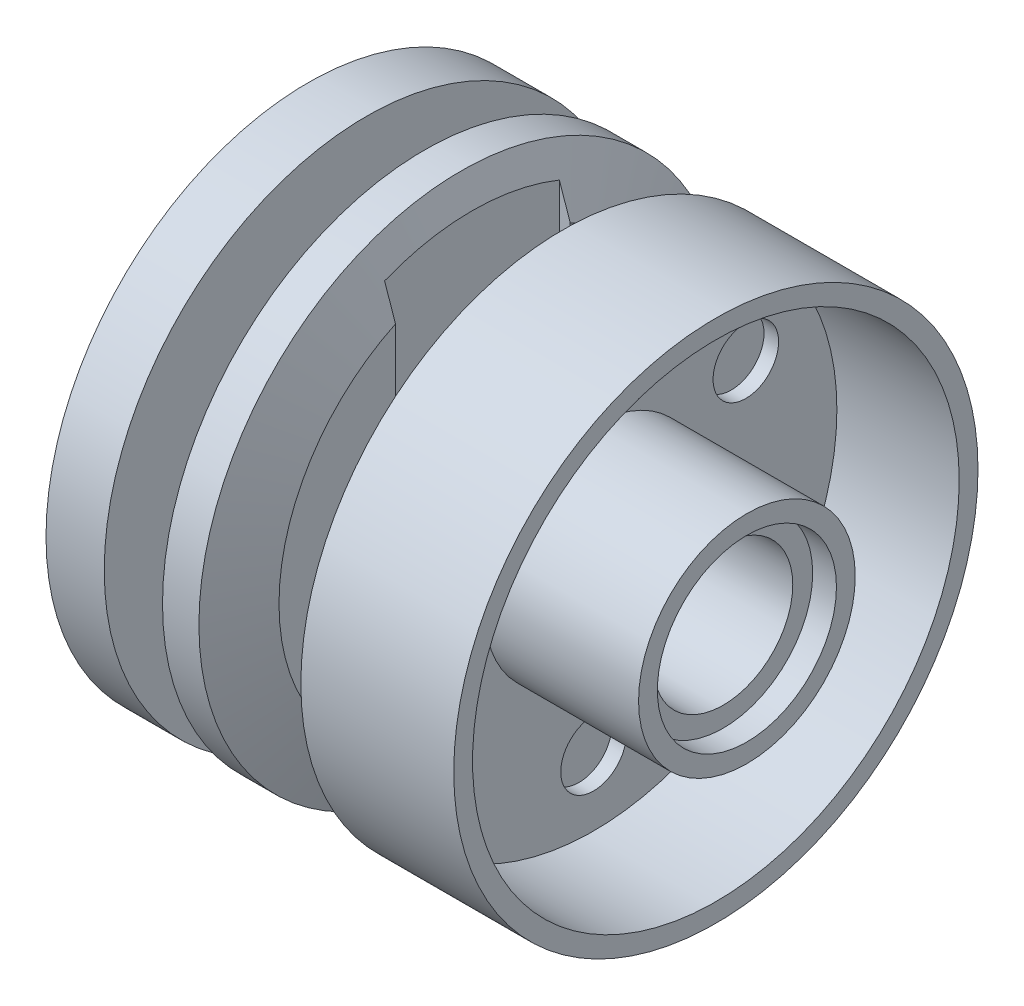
ISO-10303-21;
HEADER;
FILE_DESCRIPTION(('STEP AP214'),'2;1');
FILE_NAME('part.step','',(''),(''),'','','');
FILE_SCHEMA(('AUTOMOTIVE_DESIGN { 1 0 10303 214 1 1 1 1 }'));
ENDSEC;
DATA;
#1=APPLICATION_CONTEXT('core data for automotive mechanical design processes');
#2=APPLICATION_PROTOCOL_DEFINITION('international standard','automotive_design',2000,#1);
#3=PRODUCT_CONTEXT('',#1,'mechanical');
#4=PRODUCT('Part','Part','',(#3));
#5=PRODUCT_RELATED_PRODUCT_CATEGORY('part','',(#4));
#6=PRODUCT_DEFINITION_FORMATION('','',#4);
#7=PRODUCT_DEFINITION_CONTEXT('part definition',#1,'design');
#8=PRODUCT_DEFINITION('design','',#6,#7);
#9=PRODUCT_DEFINITION_SHAPE('','',#8);
#10=(LENGTH_UNIT() NAMED_UNIT(*) SI_UNIT(.MILLI.,.METRE.));
#11=(NAMED_UNIT(*) PLANE_ANGLE_UNIT() SI_UNIT($,.RADIAN.));
#12=(NAMED_UNIT(*) SI_UNIT($,.STERADIAN.) SOLID_ANGLE_UNIT());
#13=UNCERTAINTY_MEASURE_WITH_UNIT(LENGTH_MEASURE(1.E-05),#10,'distance_accuracy_value','');
#14=(GEOMETRIC_REPRESENTATION_CONTEXT(3) GLOBAL_UNCERTAINTY_ASSIGNED_CONTEXT((#13)) GLOBAL_UNIT_ASSIGNED_CONTEXT((#10,
#11,#12)) REPRESENTATION_CONTEXT('',''));
#15=CARTESIAN_POINT('',(0.,0.,0.));
#16=DIRECTION('',(0.,0.,1.));
#17=DIRECTION('',(1.,0.,0.));
#18=AXIS2_PLACEMENT_3D('',#15,#16,#17);
#19=CARTESIAN_POINT('',(2.3,-4.8675,1.17));
#20=DIRECTION('',(1.,0.,0.));
#21=DIRECTION('',(0.,-1.,0.));
#22=AXIS2_PLACEMENT_3D('',#19,#20,#21);
#23=PLANE('',#22);
#24=CARTESIAN_POINT('',(2.30000000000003,-6.0375,0.));
#25=DIRECTION('',(1.,0.,0.));
#26=DIRECTION('',(0.,0.,-1.));
#27=AXIS2_PLACEMENT_3D('',#24,#25,#26);
#28=CIRCLE('',#27,1.125);
#29=CARTESIAN_POINT('',(2.30000000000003,-6.0375,-1.125));
#30=VERTEX_POINT('',#29);
#31=EDGE_CURVE('E20',#30,#30,#28,.F.);
#32=ORIENTED_EDGE('',*,*,#31,.F.);
#33=EDGE_LOOP('',(#32));
#34=FACE_BOUND('',#33,.T.);
#35=ADVANCED_FACE('F16',(#34),#23,.T.);
#36=CARTESIAN_POINT('',(2.3,-3.446999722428,-3.630378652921));
#37=DIRECTION('',(1.,0.,0.));
#38=DIRECTION('',(0.,-0.500000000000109,-0.866025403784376));
#39=AXIS2_PLACEMENT_3D('',#36,#37,#38);
#40=PLANE('',#39);
#41=CARTESIAN_POINT('',(2.30000000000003,-3.01875,-5.228628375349));
#42=DIRECTION('',(1.,0.,0.));
#43=DIRECTION('',(0.,0.,-1.));
#44=AXIS2_PLACEMENT_3D('',#41,#42,#43);
#45=CIRCLE('',#44,1.12499999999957);
#46=CARTESIAN_POINT('',(2.30000000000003,-3.01875,-6.35362837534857));
#47=VERTEX_POINT('',#46);
#48=EDGE_CURVE('E2057',#47,#47,#45,.F.);
#49=ORIENTED_EDGE('',*,*,#48,.F.);
#50=EDGE_LOOP('',(#49));
#51=FACE_BOUND('',#50,.T.);
#52=ADVANCED_FACE('F1329',(#51),#40,.T.);
#53=CARTESIAN_POINT('',(2.3,1.420500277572,-4.800378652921));
#54=DIRECTION('',(1.,0.,0.));
#55=DIRECTION('',(0.,0.500000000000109,-0.866025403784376));
#56=AXIS2_PLACEMENT_3D('',#53,#54,#55);
#57=PLANE('',#56);
#58=CARTESIAN_POINT('',(2.30000000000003,3.01875,-5.228628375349));
#59=DIRECTION('',(1.,0.,0.));
#60=DIRECTION('',(0.,0.,-1.));
#61=AXIS2_PLACEMENT_3D('',#58,#59,#60);
#62=CIRCLE('',#61,1.12499999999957);
#63=CARTESIAN_POINT('',(2.30000000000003,3.01875,-6.35362837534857));
#64=VERTEX_POINT('',#63);
#65=EDGE_CURVE('E2055',#64,#64,#62,.F.);
#66=ORIENTED_EDGE('',*,*,#65,.F.);
#67=EDGE_LOOP('',(#66));
#68=FACE_BOUND('',#67,.T.);
#69=ADVANCED_FACE('F1325',(#68),#57,.T.);
#70=CARTESIAN_POINT('',(2.3,4.8675,-1.17));
#71=DIRECTION('',(1.,0.,0.));
#72=DIRECTION('',(0.,1.,0.));
#73=AXIS2_PLACEMENT_3D('',#70,#71,#72);
#74=PLANE('',#73);
#75=CARTESIAN_POINT('',(2.30000000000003,6.0375,0.));
#76=DIRECTION('',(1.,0.,0.));
#77=DIRECTION('',(0.,0.,-1.));
#78=AXIS2_PLACEMENT_3D('',#75,#76,#77);
#79=CIRCLE('',#78,1.125);
#80=CARTESIAN_POINT('',(2.30000000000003,6.0375,-1.125));
#81=VERTEX_POINT('',#80);
#82=EDGE_CURVE('E2052',#81,#81,#79,.F.);
#83=ORIENTED_EDGE('',*,*,#82,.F.);
#84=EDGE_LOOP('',(#83));
#85=FACE_BOUND('',#84,.T.);
#86=ADVANCED_FACE('F1321',(#85),#74,.T.);
#87=CARTESIAN_POINT('',(2.3,3.446999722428,3.630378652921));
#88=DIRECTION('',(1.,0.,0.));
#89=DIRECTION('',(0.,0.500000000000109,0.866025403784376));
#90=AXIS2_PLACEMENT_3D('',#87,#88,#89);
#91=PLANE('',#90);
#92=CARTESIAN_POINT('',(2.30000000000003,3.01875,5.228628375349));
#93=DIRECTION('',(1.,0.,0.));
#94=DIRECTION('',(0.,0.,-1.));
#95=AXIS2_PLACEMENT_3D('',#92,#93,#94);
#96=CIRCLE('',#95,1.12499999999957);
#97=CARTESIAN_POINT('',(2.30000000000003,3.01875,4.10362837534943));
#98=VERTEX_POINT('',#97);
#99=EDGE_CURVE('E2046',#98,#98,#96,.F.);
#100=ORIENTED_EDGE('',*,*,#99,.F.);
#101=EDGE_LOOP('',(#100));
#102=FACE_BOUND('',#101,.T.);
#103=ADVANCED_FACE('F1317',(#102),#91,.T.);
#104=CARTESIAN_POINT('',(2.3,-1.420500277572,4.800378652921));
#105=DIRECTION('',(1.,0.,0.));
#106=DIRECTION('',(0.,-0.500000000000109,0.866025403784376));
#107=AXIS2_PLACEMENT_3D('',#104,#105,#106);
#108=PLANE('',#107);
#109=CARTESIAN_POINT('',(2.30000000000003,-3.01875,5.228628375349));
#110=DIRECTION('',(1.,0.,0.));
#111=DIRECTION('',(0.,0.,-1.));
#112=AXIS2_PLACEMENT_3D('',#109,#110,#111);
#113=CIRCLE('',#112,1.12499999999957);
#114=CARTESIAN_POINT('',(2.30000000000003,-3.01875,4.10362837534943));
#115=VERTEX_POINT('',#114);
#116=EDGE_CURVE('E2040',#115,#115,#113,.F.);
#117=ORIENTED_EDGE('',*,*,#116,.F.);
#118=EDGE_LOOP('',(#117));
#119=FACE_BOUND('',#118,.T.);
#120=ADVANCED_FACE('F1313',(#119),#108,.T.);
#121=CARTESIAN_POINT('',(2.30000000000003,-6.0375,0.));
#122=DIRECTION('',(1.,0.,0.));
#123=DIRECTION('',(0.,0.,-1.));
#124=AXIS2_PLACEMENT_3D('',#121,#122,#123);
#125=CYLINDRICAL_SURFACE('',#124,1.125);
#126=ORIENTED_EDGE('',*,*,#31,.T.);
#127=EDGE_LOOP('',(#126));
#128=FACE_BOUND('',#127,.T.);
#129=CARTESIAN_POINT('',(2.79999999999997,-6.0375,0.));
#130=DIRECTION('',(1.,0.,0.));
#131=DIRECTION('',(0.,0.,-1.));
#132=AXIS2_PLACEMENT_3D('',#129,#130,#131);
#133=CIRCLE('',#132,1.125);
#134=CARTESIAN_POINT('',(2.79999999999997,-6.0375,-1.125));
#135=VERTEX_POINT('',#134);
#136=EDGE_CURVE('E2037',#135,#135,#133,.F.);
#137=ORIENTED_EDGE('',*,*,#136,.F.);
#138=EDGE_LOOP('',(#137));
#139=FACE_BOUND('',#138,.T.);
#140=ADVANCED_FACE('F1316',(#128,#139),#125,.F.);
#141=CARTESIAN_POINT('',(2.30000000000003,-3.01875,-5.228628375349));
#142=DIRECTION('',(1.,0.,0.));
#143=DIRECTION('',(0.,0.,-1.));
#144=AXIS2_PLACEMENT_3D('',#141,#142,#143);
#145=CYLINDRICAL_SURFACE('',#144,1.12499999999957);
#146=ORIENTED_EDGE('',*,*,#48,.T.);
#147=EDGE_LOOP('',(#146));
#148=FACE_BOUND('',#147,.T.);
#149=CARTESIAN_POINT('',(2.79999999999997,-3.01875,-5.228628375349));
#150=DIRECTION('',(1.,0.,0.));
#151=DIRECTION('',(0.,0.,-1.));
#152=AXIS2_PLACEMENT_3D('',#149,#150,#151);
#153=CIRCLE('',#152,1.12499999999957);
#154=CARTESIAN_POINT('',(2.79999999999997,-3.01875,-6.35362837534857));
#155=VERTEX_POINT('',#154);
#156=EDGE_CURVE('E2039',#155,#155,#153,.F.);
#157=ORIENTED_EDGE('',*,*,#156,.F.);
#158=EDGE_LOOP('',(#157));
#159=FACE_BOUND('',#158,.T.);
#160=ADVANCED_FACE('F1990',(#148,#159),#145,.F.);
#161=CARTESIAN_POINT('',(2.30000000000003,3.01875,-5.228628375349));
#162=DIRECTION('',(1.,0.,0.));
#163=DIRECTION('',(0.,0.,-1.));
#164=AXIS2_PLACEMENT_3D('',#161,#162,#163);
#165=CYLINDRICAL_SURFACE('',#164,1.12499999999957);
#166=ORIENTED_EDGE('',*,*,#65,.T.);
#167=EDGE_LOOP('',(#166));
#168=FACE_BOUND('',#167,.T.);
#169=CARTESIAN_POINT('',(2.79999999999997,3.01875,-5.228628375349));
#170=DIRECTION('',(1.,0.,0.));
#171=DIRECTION('',(0.,0.,-1.));
#172=AXIS2_PLACEMENT_3D('',#169,#170,#171);
#173=CIRCLE('',#172,1.12499999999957);
#174=CARTESIAN_POINT('',(2.79999999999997,3.01875,-6.35362837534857));
#175=VERTEX_POINT('',#174);
#176=EDGE_CURVE('E2043',#175,#175,#173,.F.);
#177=ORIENTED_EDGE('',*,*,#176,.F.);
#178=EDGE_LOOP('',(#177));
#179=FACE_BOUND('',#178,.T.);
#180=ADVANCED_FACE('F1982',(#168,#179),#165,.F.);
#181=CARTESIAN_POINT('',(2.30000000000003,6.0375,0.));
#182=DIRECTION('',(1.,0.,0.));
#183=DIRECTION('',(0.,0.,-1.));
#184=AXIS2_PLACEMENT_3D('',#181,#182,#183);
#185=CYLINDRICAL_SURFACE('',#184,1.125);
#186=ORIENTED_EDGE('',*,*,#82,.T.);
#187=EDGE_LOOP('',(#186));
#188=FACE_BOUND('',#187,.T.);
#189=CARTESIAN_POINT('',(2.79999999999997,6.0375,0.));
#190=DIRECTION('',(1.,0.,0.));
#191=DIRECTION('',(0.,0.,-1.));
#192=AXIS2_PLACEMENT_3D('',#189,#190,#191);
#193=CIRCLE('',#192,1.125);
#194=CARTESIAN_POINT('',(2.79999999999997,6.0375,-1.125));
#195=VERTEX_POINT('',#194);
#196=EDGE_CURVE('E2085',#195,#195,#193,.F.);
#197=ORIENTED_EDGE('',*,*,#196,.F.);
#198=EDGE_LOOP('',(#197));
#199=FACE_BOUND('',#198,.T.);
#200=ADVANCED_FACE('F1974',(#188,#199),#185,.F.);
#201=CARTESIAN_POINT('',(2.30000000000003,3.01875,5.228628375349));
#202=DIRECTION('',(1.,0.,0.));
#203=DIRECTION('',(0.,0.,-1.));
#204=AXIS2_PLACEMENT_3D('',#201,#202,#203);
#205=CYLINDRICAL_SURFACE('',#204,1.12499999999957);
#206=ORIENTED_EDGE('',*,*,#99,.T.);
#207=EDGE_LOOP('',(#206));
#208=FACE_BOUND('',#207,.T.);
#209=CARTESIAN_POINT('',(2.79999999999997,3.01875,5.228628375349));
#210=DIRECTION('',(1.,0.,0.));
#211=DIRECTION('',(0.,0.,-1.));
#212=AXIS2_PLACEMENT_3D('',#209,#210,#211);
#213=CIRCLE('',#212,1.12499999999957);
#214=CARTESIAN_POINT('',(2.79999999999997,3.01875,4.10362837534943));
#215=VERTEX_POINT('',#214);
#216=EDGE_CURVE('E2082',#215,#215,#213,.F.);
#217=ORIENTED_EDGE('',*,*,#216,.F.);
#218=EDGE_LOOP('',(#217));
#219=FACE_BOUND('',#218,.T.);
#220=ADVANCED_FACE('F1966',(#208,#219),#205,.F.);
#221=CARTESIAN_POINT('',(2.30000000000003,-3.01875,5.228628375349));
#222=DIRECTION('',(1.,0.,0.));
#223=DIRECTION('',(0.,0.,-1.));
#224=AXIS2_PLACEMENT_3D('',#221,#222,#223);
#225=CYLINDRICAL_SURFACE('',#224,1.12499999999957);
#226=ORIENTED_EDGE('',*,*,#116,.T.);
#227=EDGE_LOOP('',(#226));
#228=FACE_BOUND('',#227,.T.);
#229=CARTESIAN_POINT('',(2.79999999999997,-3.01875,5.228628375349));
#230=DIRECTION('',(1.,0.,0.));
#231=DIRECTION('',(0.,0.,-1.));
#232=AXIS2_PLACEMENT_3D('',#229,#230,#231);
#233=CIRCLE('',#232,1.12499999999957);
#234=CARTESIAN_POINT('',(2.79999999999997,-3.01875,4.10362837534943));
#235=VERTEX_POINT('',#234);
#236=EDGE_CURVE('E2076',#235,#235,#233,.F.);
#237=ORIENTED_EDGE('',*,*,#236,.F.);
#238=EDGE_LOOP('',(#237));
#239=FACE_BOUND('',#238,.T.);
#240=ADVANCED_FACE('F1311',(#228,#239),#225,.F.);
#241=CARTESIAN_POINT('',(2.8,8.696356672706,8.6892));
#242=DIRECTION('',(1.,0.,0.));
#243=DIRECTION('',(0.,-1.,0.));
#244=AXIS2_PLACEMENT_3D('',#241,#242,#243);
#245=PLANE('',#244);
#246=ORIENTED_EDGE('',*,*,#236,.T.);
#247=EDGE_LOOP('',(#246));
#248=FACE_BOUND('',#247,.T.);
#249=ORIENTED_EDGE('',*,*,#216,.T.);
#250=EDGE_LOOP('',(#249));
#251=FACE_BOUND('',#250,.T.);
#252=ORIENTED_EDGE('',*,*,#196,.T.);
#253=EDGE_LOOP('',(#252));
#254=FACE_BOUND('',#253,.T.);
#255=ORIENTED_EDGE('',*,*,#176,.T.);
#256=EDGE_LOOP('',(#255));
#257=FACE_BOUND('',#256,.T.);
#258=ORIENTED_EDGE('',*,*,#156,.T.);
#259=EDGE_LOOP('',(#258));
#260=FACE_BOUND('',#259,.T.);
#261=ORIENTED_EDGE('',*,*,#136,.T.);
#262=EDGE_LOOP('',(#261));
#263=FACE_BOUND('',#262,.T.);
#264=CARTESIAN_POINT('',(2.8,0.,0.));
#265=DIRECTION('',(1.,0.,0.));
#266=DIRECTION('',(0.,0.,-1.));
#267=AXIS2_PLACEMENT_3D('',#264,#265,#266);
#268=CIRCLE('',#267,3.72);
#269=CARTESIAN_POINT('',(2.8,0.,-3.72));
#270=VERTEX_POINT('',#269);
#271=EDGE_CURVE('E2067',#270,#270,#268,.F.);
#272=ORIENTED_EDGE('',*,*,#271,.T.);
#273=EDGE_LOOP('',(#272));
#274=FACE_BOUND('',#273,.T.);
#275=CARTESIAN_POINT('',(2.8,0.,0.));
#276=DIRECTION('',(1.,0.,0.));
#277=DIRECTION('',(0.,0.,-1.));
#278=AXIS2_PLACEMENT_3D('',#275,#276,#277);
#279=CIRCLE('',#278,8.355);
#280=CARTESIAN_POINT('',(2.8,0.,-8.355));
#281=VERTEX_POINT('',#280);
#282=EDGE_CURVE('E2070',#281,#281,#279,.F.);
#283=ORIENTED_EDGE('',*,*,#282,.F.);
#284=EDGE_LOOP('',(#283));
#285=FACE_BOUND('',#284,.T.);
#286=ADVANCED_FACE('F1307',(#248,#251,#254,#257,#260,#263,#274,#285),#245,.T.);
#287=CARTESIAN_POINT('',(2.8,0.,0.));
#288=DIRECTION('',(1.,0.,0.));
#289=DIRECTION('',(0.,0.,-1.));
#290=AXIS2_PLACEMENT_3D('',#287,#288,#289);
#291=CYLINDRICAL_SURFACE('',#290,3.72);
#292=ORIENTED_EDGE('',*,*,#271,.F.);
#293=EDGE_LOOP('',(#292));
#294=FACE_BOUND('',#293,.T.);
#295=CARTESIAN_POINT('',(8.06499999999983,0.,0.));
#296=DIRECTION('',(1.,0.,0.));
#297=DIRECTION('',(0.,0.,-1.));
#298=AXIS2_PLACEMENT_3D('',#295,#296,#297);
#299=CIRCLE('',#298,3.72);
#300=CARTESIAN_POINT('',(8.06499999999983,0.,-3.72));
#301=VERTEX_POINT('',#300);
#302=EDGE_CURVE('E2071',#301,#301,#299,.T.);
#303=ORIENTED_EDGE('',*,*,#302,.F.);
#304=EDGE_LOOP('',(#303));
#305=FACE_BOUND('',#304,.T.);
#306=ADVANCED_FACE('F1310',(#294,#305),#291,.T.);
#307=CARTESIAN_POINT('',(2.8,0.,0.));
#308=DIRECTION('',(1.,0.,0.));
#309=DIRECTION('',(0.,0.,-1.));
#310=AXIS2_PLACEMENT_3D('',#307,#308,#309);
#311=CYLINDRICAL_SURFACE('',#310,8.355);
#312=ORIENTED_EDGE('',*,*,#282,.T.);
#313=EDGE_LOOP('',(#312));
#314=FACE_BOUND('',#313,.T.);
#315=CARTESIAN_POINT('',(6.99999999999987,0.,0.));
#316=DIRECTION('',(1.,0.,0.));
#317=DIRECTION('',(0.,0.,-1.));
#318=AXIS2_PLACEMENT_3D('',#315,#316,#317);
#319=CIRCLE('',#318,8.355);
#320=CARTESIAN_POINT('',(6.99999999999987,0.,-8.355));
#321=VERTEX_POINT('',#320);
#322=EDGE_CURVE('E2074',#321,#321,#319,.F.);
#323=ORIENTED_EDGE('',*,*,#322,.F.);
#324=EDGE_LOOP('',(#323));
#325=FACE_BOUND('',#324,.T.);
#326=ADVANCED_FACE('F1305',(#314,#325),#311,.F.);
#327=CARTESIAN_POINT('',(8.065,3.872676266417,-3.8688));
#328=DIRECTION('',(1.,0.,0.));
#329=DIRECTION('',(0.,0.,1.));
#330=AXIS2_PLACEMENT_3D('',#327,#328,#329);
#331=PLANE('',#330);
#332=CARTESIAN_POINT('',(8.06499999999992,0.,0.));
#333=DIRECTION('',(1.,0.,0.));
#334=DIRECTION('',(0.,0.,-1.));
#335=AXIS2_PLACEMENT_3D('',#332,#333,#334);
#336=CIRCLE('',#335,3.075);
#337=CARTESIAN_POINT('',(8.06499999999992,0.,-3.075));
#338=VERTEX_POINT('',#337);
#339=EDGE_CURVE('E2101',#338,#338,#336,.T.);
#340=ORIENTED_EDGE('',*,*,#339,.F.);
#341=EDGE_LOOP('',(#340));
#342=FACE_BOUND('',#341,.T.);
#343=ORIENTED_EDGE('',*,*,#302,.T.);
#344=EDGE_LOOP('',(#343));
#345=FACE_BOUND('',#344,.T.);
#346=ADVANCED_FACE('F1301',(#342,#345),#331,.T.);
#347=CARTESIAN_POINT('',(7.,9.36,-9.36));
#348=DIRECTION('',(1.,0.,0.));
#349=DIRECTION('',(0.,0.,1.));
#350=AXIS2_PLACEMENT_3D('',#347,#348,#349);
#351=PLANE('',#350);
#352=ORIENTED_EDGE('',*,*,#322,.T.);
#353=EDGE_LOOP('',(#352));
#354=FACE_BOUND('',#353,.T.);
#355=CARTESIAN_POINT('',(6.99999999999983,0.,0.));
#356=DIRECTION('',(1.,0.,0.));
#357=DIRECTION('',(0.,0.,-1.));
#358=AXIS2_PLACEMENT_3D('',#355,#356,#357);
#359=CIRCLE('',#358,9.);
#360=CARTESIAN_POINT('',(6.99999999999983,0.,-9.));
#361=VERTEX_POINT('',#360);
#362=EDGE_CURVE('E2104',#361,#361,#359,.T.);
#363=ORIENTED_EDGE('',*,*,#362,.T.);
#364=EDGE_LOOP('',(#363));
#365=FACE_BOUND('',#364,.T.);
#366=ADVANCED_FACE('F1297',(#354,#365),#351,.T.);
#367=CARTESIAN_POINT('',(7.25000000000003,0.,0.));
#368=DIRECTION('',(1.,0.,0.));
#369=DIRECTION('',(0.,0.,-1.));
#370=AXIS2_PLACEMENT_3D('',#367,#368,#369);
#371=CYLINDRICAL_SURFACE('',#370,3.075);
#372=CARTESIAN_POINT('',(7.25000000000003,0.,0.));
#373=DIRECTION('',(1.,0.,0.));
#374=DIRECTION('',(0.,0.,-1.));
#375=AXIS2_PLACEMENT_3D('',#372,#373,#374);
#376=CIRCLE('',#375,3.075);
#377=CARTESIAN_POINT('',(7.25000000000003,0.,-3.075));
#378=VERTEX_POINT('',#377);
#379=EDGE_CURVE('E393',#378,#378,#376,.T.);
#380=ORIENTED_EDGE('',*,*,#379,.F.);
#381=EDGE_LOOP('',(#380));
#382=FACE_BOUND('',#381,.T.);
#383=ORIENTED_EDGE('',*,*,#339,.T.);
#384=EDGE_LOOP('',(#383));
#385=FACE_BOUND('',#384,.T.);
#386=ADVANCED_FACE('F1300',(#382,#385),#371,.F.);
#387=CARTESIAN_POINT('',(1.75000000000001,0.,0.));
#388=DIRECTION('',(1.,0.,0.));
#389=DIRECTION('',(0.,0.,-1.));
#390=AXIS2_PLACEMENT_3D('',#387,#388,#389);
#391=CYLINDRICAL_SURFACE('',#390,9.);
#392=ORIENTED_EDGE('',*,*,#362,.F.);
#393=EDGE_LOOP('',(#392));
#394=FACE_BOUND('',#393,.T.);
#395=CARTESIAN_POINT('',(1.74999999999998,0.,0.));
#396=DIRECTION('',(1.,0.,0.));
#397=DIRECTION('',(0.,0.,1.));
#398=AXIS2_PLACEMENT_3D('',#395,#396,#397);
#399=CIRCLE('',#398,8.99999999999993);
#400=CARTESIAN_POINT('',(1.74999999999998,0.,8.99999999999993));
#401=VERTEX_POINT('',#400);
#402=EDGE_CURVE('E701',#401,#401,#399,.T.);
#403=ORIENTED_EDGE('',*,*,#402,.T.);
#404=EDGE_LOOP('',(#403));
#405=FACE_BOUND('',#404,.T.);
#406=ADVANCED_FACE('F1238',(#394,#405),#391,.T.);
#407=CARTESIAN_POINT('',(7.25,3.198,-3.198));
#408=DIRECTION('',(1.,0.,0.));
#409=DIRECTION('',(0.,0.,1.));
#410=AXIS2_PLACEMENT_3D('',#407,#408,#409);
#411=PLANE('',#410);
#412=CARTESIAN_POINT('',(7.24999999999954,0.,0.));
#413=DIRECTION('',(1.,0.,0.));
#414=DIRECTION('',(0.,0.,-1.));
#415=AXIS2_PLACEMENT_3D('',#412,#413,#414);
#416=CIRCLE('',#415,2.39);
#417=CARTESIAN_POINT('',(7.24999999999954,0.,-2.39));
#418=VERTEX_POINT('',#417);
#419=EDGE_CURVE('E700',#418,#418,#416,.T.);
#420=ORIENTED_EDGE('',*,*,#419,.F.);
#421=EDGE_LOOP('',(#420));
#422=FACE_BOUND('',#421,.T.);
#423=ORIENTED_EDGE('',*,*,#379,.T.);
#424=EDGE_LOOP('',(#423));
#425=FACE_BOUND('',#424,.T.);
#426=ADVANCED_FACE('F1236',(#422,#425),#411,.T.);
#427=CARTESIAN_POINT('',(1.,0.,0.));
#428=DIRECTION('',(1.,0.,0.));
#429=DIRECTION('',(0.,0.,-1.));
#430=AXIS2_PLACEMENT_3D('',#427,#428,#429);
#431=CONICAL_SURFACE('',#430,7.,1.21202565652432);
#432=ORIENTED_EDGE('',*,*,#402,.F.);
#433=EDGE_LOOP('',(#432));
#434=FACE_BOUND('',#433,.T.);
#435=CARTESIAN_POINT('',(0.99999999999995,6.32455532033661,3.));
#436=CARTESIAN_POINT('',(1.03086710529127,6.41565674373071,3.));
#437=CARTESIAN_POINT('',(1.06184310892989,6.50672121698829,3.));
#438=CARTESIAN_POINT('',(1.12399260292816,6.68878236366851,3.));
#439=CARTESIAN_POINT('',(1.15516609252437,6.77977903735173,3.));
#440=CARTESIAN_POINT('',(1.21769046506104,6.96171132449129,3.));
#441=CARTESIAN_POINT('',(1.24904134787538,7.05264693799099,3.));
#442=CARTESIAN_POINT('',(1.31190410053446,7.23446290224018,3.));
#443=CARTESIAN_POINT('',(1.34341597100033,7.32534325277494,3.));
#444=CARTESIAN_POINT('',(1.37499999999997,7.41619848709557,3.));
#445=B_SPLINE_CURVE_WITH_KNOTS('',3,(#435,#436,#437,#438,#439,#440,#441,#442,#443,#444),
.UNSPECIFIED.,.F.,.F.,(4,2,2,2,4),(0.,0.288565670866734,0.577130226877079,0.865694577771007,
1.15426004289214),.UNSPECIFIED.);
#446=CARTESIAN_POINT('',(0.999999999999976,6.32455532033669,3.));
#447=VERTEX_POINT('',#446);
#448=CARTESIAN_POINT('',(1.37499999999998,7.41619848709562,3.));
#449=VERTEX_POINT('',#448);
#450=EDGE_CURVE('E382',#447,#449,#445,.T.);
#451=ORIENTED_EDGE('',*,*,#450,.F.);
#452=CARTESIAN_POINT('',(1.,0.,0.));
#453=DIRECTION('',(1.,0.,0.));
#454=DIRECTION('',(0.,0.,-1.));
#455=AXIS2_PLACEMENT_3D('',#452,#453,#454);
#456=CIRCLE('',#455,7.);
#457=CARTESIAN_POINT('',(0.999999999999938,6.32455532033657,-3.));
#458=VERTEX_POINT('',#457);
#459=EDGE_CURVE('E374',#447,#458,#456,.T.);
#460=ORIENTED_EDGE('',*,*,#459,.T.);
#461=CARTESIAN_POINT('',(1.37499999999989,7.41619848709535,-3.));
#462=CARTESIAN_POINT('',(1.34341597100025,7.32534325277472,-3.));
#463=CARTESIAN_POINT('',(1.31190410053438,7.23446290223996,-3.));
#464=CARTESIAN_POINT('',(1.24904134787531,7.05264693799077,-3.));
#465=CARTESIAN_POINT('',(1.21769046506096,6.96171132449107,-3.));
#466=CARTESIAN_POINT('',(1.15516609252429,6.77977903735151,-3.));
#467=CARTESIAN_POINT('',(1.12399260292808,6.68878236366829,-3.));
#468=CARTESIAN_POINT('',(1.06184310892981,6.50672121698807,-3.));
#469=CARTESIAN_POINT('',(1.03086710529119,6.41565674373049,-3.));
#470=CARTESIAN_POINT('',(0.999999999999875,6.32455532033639,-3.));
#471=B_SPLINE_CURVE_WITH_KNOTS('',3,(#461,#462,#463,#464,#465,#466,#467,#468,#469,#470),
.UNSPECIFIED.,.F.,.F.,(4,2,2,2,4),(0.,0.288565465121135,0.577129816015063,0.865694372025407,
1.15426004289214),.UNSPECIFIED.);
#472=CARTESIAN_POINT('',(1.37499999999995,7.4161984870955,-3.));
#473=VERTEX_POINT('',#472);
#474=EDGE_CURVE('E392',#473,#458,#471,.T.);
#475=ORIENTED_EDGE('',*,*,#474,.F.);
#476=CARTESIAN_POINT('',(1.375,0.,0.));
#477=DIRECTION('',(1.,0.,0.));
#478=DIRECTION('',(0.,0.,-1.));
#479=AXIS2_PLACEMENT_3D('',#476,#477,#478);
#480=CIRCLE('',#479,8.);
#481=EDGE_CURVE('E396',#473,#449,#480,.T.);
#482=ORIENTED_EDGE('',*,*,#481,.T.);
#483=EDGE_LOOP('',(#451,#460,#475,#482));
#484=FACE_BOUND('',#483,.T.);
#485=ADVANCED_FACE('F397',(#434,#484),#431,.T.);
#486=CARTESIAN_POINT('',(-7.25,3.198,-3.198));
#487=DIRECTION('',(1.,0.,0.));
#488=DIRECTION('',(0.,0.,1.));
#489=AXIS2_PLACEMENT_3D('',#486,#487,#488);
#490=PLANE('',#489);
#491=CARTESIAN_POINT('',(-7.24999999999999,0.,0.));
#492=DIRECTION('',(1.,0.,0.));
#493=DIRECTION('',(0.,0.,-1.));
#494=AXIS2_PLACEMENT_3D('',#491,#492,#493);
#495=CIRCLE('',#494,2.39);
#496=CARTESIAN_POINT('',(-7.24999999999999,0.,-2.39));
#497=VERTEX_POINT('',#496);
#498=EDGE_CURVE('E420',#497,#497,#495,.F.);
#499=ORIENTED_EDGE('',*,*,#498,.F.);
#500=EDGE_LOOP('',(#499));
#501=FACE_BOUND('',#500,.T.);
#502=CARTESIAN_POINT('',(-7.25000000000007,0.,0.));
#503=DIRECTION('',(1.,0.,0.));
#504=DIRECTION('',(0.,0.,-1.));
#505=AXIS2_PLACEMENT_3D('',#502,#503,#504);
#506=CIRCLE('',#505,3.075);
#507=CARTESIAN_POINT('',(-7.25000000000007,0.,-3.075));
#508=VERTEX_POINT('',#507);
#509=EDGE_CURVE('E1508',#508,#508,#506,.T.);
#510=ORIENTED_EDGE('',*,*,#509,.F.);
#511=EDGE_LOOP('',(#510));
#512=FACE_BOUND('',#511,.T.);
#513=ADVANCED_FACE('F1235',(#501,#512),#490,.F.);
#514=CARTESIAN_POINT('',(-1.43,0.,3.12));
#515=DIRECTION('',(0.,1.,0.));
#516=DIRECTION('',(1.,0.,0.));
#517=AXIS2_PLACEMENT_3D('',#514,#515,#516);
#518=PLANE('',#517);
#519=DIRECTION('',(1.,0.,0.));
#520=VECTOR('',#519,1.);
#521=CARTESIAN_POINT('',(0.,0.,3.));
#522=LINE('',#521,#520);
#523=CARTESIAN_POINT('',(-1.375,0.,3.));
#524=VERTEX_POINT('',#523);
#525=CARTESIAN_POINT('',(1.375,0.,3.));
#526=VERTEX_POINT('',#525);
#527=EDGE_CURVE('E407',#524,#526,#522,.T.);
#528=ORIENTED_EDGE('',*,*,#527,.T.);
#529=DIRECTION('',(0.,0.,-1.));
#530=VECTOR('',#529,1.);
#531=CARTESIAN_POINT('',(1.375,0.,0.));
#532=LINE('',#531,#530);
#533=CARTESIAN_POINT('',(1.37500000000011,4.93538543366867E-13,2.39));
#534=VERTEX_POINT('',#533);
#535=EDGE_CURVE('E401',#526,#534,#532,.T.);
#536=ORIENTED_EDGE('',*,*,#535,.T.);
#537=DIRECTION('',(-1.,0.,0.));
#538=VECTOR('',#537,1.);
#539=CARTESIAN_POINT('',(0.,0.,2.39));
#540=LINE('',#539,#538);
#541=CARTESIAN_POINT('',(-1.37500000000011,0.,2.39));
#542=VERTEX_POINT('',#541);
#543=EDGE_CURVE('E638',#534,#542,#540,.T.);
#544=ORIENTED_EDGE('',*,*,#543,.T.);
#545=DIRECTION('',(0.,0.,1.));
#546=VECTOR('',#545,1.);
#547=CARTESIAN_POINT('',(-1.375,0.,0.));
#548=LINE('',#547,#546);
#549=EDGE_CURVE('E635',#542,#524,#548,.T.);
#550=ORIENTED_EDGE('',*,*,#549,.T.);
#551=EDGE_LOOP('',(#528,#536,#544,#550));
#552=FACE_BOUND('',#551,.T.);
#553=ADVANCED_FACE('F1287',(#552),#518,.T.);
#554=CARTESIAN_POINT('',(1.375,-0.16,3.12));
#555=DIRECTION('',(1.,0.,0.));
#556=DIRECTION('',(0.,0.,-1.));
#557=AXIS2_PLACEMENT_3D('',#554,#555,#556);
#558=PLANE('',#557);
#559=DIRECTION('',(0.,1.,0.));
#560=VECTOR('',#559,1.);
#561=CARTESIAN_POINT('',(1.375,3.70809924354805,3.));
#562=LINE('',#561,#560);
#563=EDGE_CURVE('E387',#526,#449,#562,.T.);
#564=ORIENTED_EDGE('',*,*,#563,.T.);
#565=ORIENTED_EDGE('',*,*,#481,.F.);
#566=DIRECTION('',(0.,-1.,0.));
#567=VECTOR('',#566,1.);
#568=CARTESIAN_POINT('',(1.375,3.70809924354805,-3.));
#569=LINE('',#568,#567);
#570=CARTESIAN_POINT('',(1.375,0.,-3.));
#571=VERTEX_POINT('',#570);
#572=EDGE_CURVE('E406',#473,#571,#569,.T.);
#573=ORIENTED_EDGE('',*,*,#572,.T.);
#574=DIRECTION('',(0.,0.,-1.));
#575=VECTOR('',#574,1.);
#576=CARTESIAN_POINT('',(1.375,0.,0.));
#577=LINE('',#576,#575);
#578=CARTESIAN_POINT('',(1.37500000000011,-2.47446303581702E-13,-2.39));
#579=VERTEX_POINT('',#578);
#580=EDGE_CURVE('E627',#579,#571,#577,.T.);
#581=ORIENTED_EDGE('',*,*,#580,.F.);
#582=CARTESIAN_POINT('',(1.37500000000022,0.,0.));
#583=DIRECTION('',(1.,0.,0.));
#584=DIRECTION('',(0.,0.,-1.));
#585=AXIS2_PLACEMENT_3D('',#582,#583,#584);
#586=CIRCLE('',#585,2.39);
#587=EDGE_CURVE('E402',#534,#579,#586,.F.);
#588=ORIENTED_EDGE('',*,*,#587,.F.);
#589=ORIENTED_EDGE('',*,*,#535,.F.);
#590=EDGE_LOOP('',(#564,#565,#573,#581,#588,#589));
#591=FACE_BOUND('',#590,.T.);
#592=ADVANCED_FACE('F404',(#591),#558,.F.);
#593=CARTESIAN_POINT('',(-1.43,0.,3.12));
#594=DIRECTION('',(0.,1.,0.));
#595=DIRECTION('',(1.,0.,0.));
#596=AXIS2_PLACEMENT_3D('',#593,#594,#595);
#597=PLANE('',#596);
#598=DIRECTION('',(-1.,0.,0.));
#599=VECTOR('',#598,1.);
#600=CARTESIAN_POINT('',(0.,0.,-3.));
#601=LINE('',#600,#599);
#602=CARTESIAN_POINT('',(-1.375,0.,-3.));
#603=VERTEX_POINT('',#602);
#604=EDGE_CURVE('E409',#571,#603,#601,.T.);
#605=ORIENTED_EDGE('',*,*,#604,.T.);
#606=DIRECTION('',(0.,0.,1.));
#607=VECTOR('',#606,1.);
#608=CARTESIAN_POINT('',(-1.375,0.,0.));
#609=LINE('',#608,#607);
#610=CARTESIAN_POINT('',(-1.37500000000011,-2.47446303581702E-13,-2.39));
#611=VERTEX_POINT('',#610);
#612=EDGE_CURVE('E625',#603,#611,#609,.T.);
#613=ORIENTED_EDGE('',*,*,#612,.T.);
#614=DIRECTION('',(1.,0.,0.));
#615=VECTOR('',#614,1.);
#616=CARTESIAN_POINT('',(0.,0.,-2.39));
#617=LINE('',#616,#615);
#618=EDGE_CURVE('E632',#611,#579,#617,.T.);
#619=ORIENTED_EDGE('',*,*,#618,.T.);
#620=ORIENTED_EDGE('',*,*,#580,.T.);
#621=EDGE_LOOP('',(#605,#613,#619,#620));
#622=FACE_BOUND('',#621,.T.);
#623=ADVANCED_FACE('F1281',(#622),#597,.T.);
#624=CARTESIAN_POINT('',(1.,6.591046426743,-7.28));
#625=DIRECTION('',(1.,0.,0.));
#626=DIRECTION('',(0.,0.,1.));
#627=AXIS2_PLACEMENT_3D('',#624,#625,#626);
#628=PLANE('',#627);
#629=DIRECTION('',(0.,1.,0.));
#630=VECTOR('',#629,1.);
#631=CARTESIAN_POINT('',(1.,3.70809924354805,-3.));
#632=LINE('',#631,#630);
#633=CARTESIAN_POINT('',(0.999999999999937,2.96789487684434,-3.00000000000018));
#634=VERTEX_POINT('',#633);
#635=EDGE_CURVE('E421',#634,#458,#632,.T.);
#636=ORIENTED_EDGE('',*,*,#635,.T.);
#637=ORIENTED_EDGE('',*,*,#459,.F.);
#638=DIRECTION('',(0.,-1.,0.));
#639=VECTOR('',#638,1.);
#640=CARTESIAN_POINT('',(1.,3.70809924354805,3.));
#641=LINE('',#640,#639);
#642=CARTESIAN_POINT('',(0.999999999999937,2.96789487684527,2.99999999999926));
#643=VERTEX_POINT('',#642);
#644=EDGE_CURVE('E390',#447,#643,#641,.T.);
#645=ORIENTED_EDGE('',*,*,#644,.T.);
#646=CARTESIAN_POINT('',(0.999999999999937,0.,0.));
#647=DIRECTION('',(1.,0.,0.));
#648=DIRECTION('',(0.,0.,-1.));
#649=AXIS2_PLACEMENT_3D('',#646,#647,#648);
#650=CIRCLE('',#649,4.22);
#651=EDGE_CURVE('E422',#643,#634,#650,.T.);
#652=ORIENTED_EDGE('',*,*,#651,.T.);
#653=EDGE_LOOP('',(#636,#637,#645,#652));
#654=FACE_BOUND('',#653,.T.);
#655=ADVANCED_FACE('F1245',(#654),#628,.F.);
#656=CARTESIAN_POINT('',(-8.06499999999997,0.,0.));
#657=DIRECTION('',(1.,0.,0.));
#658=DIRECTION('',(0.,0.,-1.));
#659=AXIS2_PLACEMENT_3D('',#656,#657,#658);
#660=CYLINDRICAL_SURFACE('',#659,3.075);
#661=CARTESIAN_POINT('',(-8.06499999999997,0.,0.));
#662=DIRECTION('',(1.,0.,0.));
#663=DIRECTION('',(0.,0.,-1.));
#664=AXIS2_PLACEMENT_3D('',#661,#662,#663);
#665=CIRCLE('',#664,3.075);
#666=CARTESIAN_POINT('',(-8.06499999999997,0.,-3.075));
#667=VERTEX_POINT('',#666);
#668=EDGE_CURVE('E618',#667,#667,#665,.F.);
#669=ORIENTED_EDGE('',*,*,#668,.T.);
#670=EDGE_LOOP('',(#669));
#671=FACE_BOUND('',#670,.T.);
#672=ORIENTED_EDGE('',*,*,#509,.T.);
#673=EDGE_LOOP('',(#672));
#674=FACE_BOUND('',#673,.T.);
#675=ADVANCED_FACE('F1240',(#671,#674),#660,.F.);
#676=CARTESIAN_POINT('',(-7.24999999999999,0.,0.));
#677=DIRECTION('',(1.,0.,0.));
#678=DIRECTION('',(0.,0.,-1.));
#679=AXIS2_PLACEMENT_3D('',#676,#677,#678);
#680=CYLINDRICAL_SURFACE('',#679,2.39);
#681=ORIENTED_EDGE('',*,*,#419,.T.);
#682=EDGE_LOOP('',(#681));
#683=FACE_BOUND('',#682,.T.);
#684=ORIENTED_EDGE('',*,*,#498,.T.);
#685=EDGE_LOOP('',(#684));
#686=FACE_BOUND('',#685,.T.);
#687=CARTESIAN_POINT('',(-1.37500000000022,0.,0.));
#688=DIRECTION('',(1.,0.,0.));
#689=DIRECTION('',(0.,0.,-1.));
#690=AXIS2_PLACEMENT_3D('',#687,#688,#689);
#691=CIRCLE('',#690,2.39);
#692=EDGE_CURVE('E436',#611,#542,#691,.T.);
#693=ORIENTED_EDGE('',*,*,#692,.T.);
#694=ORIENTED_EDGE('',*,*,#543,.F.);
#695=ORIENTED_EDGE('',*,*,#587,.T.);
#696=ORIENTED_EDGE('',*,*,#618,.F.);
#697=EDGE_LOOP('',(#693,#694,#695,#696));
#698=FACE_BOUND('',#697,.T.);
#699=ADVANCED_FACE('F1244',(#683,#686,#698),#680,.F.);
#700=CARTESIAN_POINT('',(-1.43,-0.1483239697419,3.));
#701=DIRECTION('',(0.,0.,1.));
#702=DIRECTION('',(1.,0.,0.));
#703=AXIS2_PLACEMENT_3D('',#700,#701,#702);
#704=PLANE('',#703);
#705=ORIENTED_EDGE('',*,*,#527,.F.);
#706=DIRECTION('',(0.,1.,0.));
#707=VECTOR('',#706,1.);
#708=CARTESIAN_POINT('',(-1.375,4.,3.));
#709=LINE('',#708,#707);
#710=CARTESIAN_POINT('',(-1.37500000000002,7.41619848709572,3.));
#711=VERTEX_POINT('',#710);
#712=EDGE_CURVE('E431',#524,#711,#709,.T.);
#713=ORIENTED_EDGE('',*,*,#712,.T.);
#714=CARTESIAN_POINT('',(-1.00000000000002,6.3245553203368,3.));
#715=CARTESIAN_POINT('',(-1.03086710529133,6.4156567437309,3.));
#716=CARTESIAN_POINT('',(-1.06184310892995,6.50672121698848,3.));
#717=CARTESIAN_POINT('',(-1.12399260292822,6.6887823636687,3.));
#718=CARTESIAN_POINT('',(-1.15516609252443,6.77977903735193,3.));
#719=CARTESIAN_POINT('',(-1.2176904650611,6.96171132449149,3.));
#720=CARTESIAN_POINT('',(-1.24904134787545,7.05264693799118,3.));
#721=CARTESIAN_POINT('',(-1.31190410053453,7.23446290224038,3.));
#722=CARTESIAN_POINT('',(-1.3434159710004,7.32534325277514,3.));
#723=CARTESIAN_POINT('',(-1.37500000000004,7.41619848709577,3.));
#724=B_SPLINE_CURVE_WITH_KNOTS('',3,(#714,#715,#716,#717,#718,#719,#720,#721,#722,#723),
.UNSPECIFIED.,.F.,.F.,(4,2,2,2,4),(0.,0.288565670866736,0.577130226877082,0.865694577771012,
1.15426004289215),.UNSPECIFIED.);
#725=CARTESIAN_POINT('',(-1.00000000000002,6.32455532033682,3.));
#726=VERTEX_POINT('',#725);
#727=EDGE_CURVE('E411',#726,#711,#724,.T.);
#728=ORIENTED_EDGE('',*,*,#727,.F.);
#729=DIRECTION('',(0.,1.,0.));
#730=VECTOR('',#729,1.);
#731=CARTESIAN_POINT('',(-1.,-0.337722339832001,3.));
#732=LINE('',#731,#730);
#733=CARTESIAN_POINT('',(-0.999999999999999,2.96789487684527,2.99999999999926));
#734=VERTEX_POINT('',#733);
#735=EDGE_CURVE('E430',#734,#726,#732,.T.);
#736=ORIENTED_EDGE('',*,*,#735,.F.);
#737=DIRECTION('',(1.,0.,0.));
#738=VECTOR('',#737,1.);
#739=CARTESIAN_POINT('',(0.,2.96789487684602,2.99999999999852));
#740=LINE('',#739,#738);
#741=EDGE_CURVE('E616',#734,#643,#740,.T.);
#742=ORIENTED_EDGE('',*,*,#741,.T.);
#743=ORIENTED_EDGE('',*,*,#644,.F.);
#744=ORIENTED_EDGE('',*,*,#450,.T.);
#745=ORIENTED_EDGE('',*,*,#563,.F.);
#746=EDGE_LOOP('',(#705,#713,#728,#736,#742,#743,#744,#745));
#747=FACE_BOUND('',#746,.T.);
#748=ADVANCED_FACE('F385',(#747),#704,.F.);
#749=CARTESIAN_POINT('',(1.43,-0.1483239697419,-3.));
#750=DIRECTION('',(0.,0.,-1.));
#751=DIRECTION('',(-1.,0.,0.));
#752=AXIS2_PLACEMENT_3D('',#749,#750,#751);
#753=PLANE('',#752);
#754=DIRECTION('',(-1.,0.,0.));
#755=VECTOR('',#754,1.);
#756=CARTESIAN_POINT('',(0.,2.96789487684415,-3.00000000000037));
#757=LINE('',#756,#755);
#758=CARTESIAN_POINT('',(-0.999999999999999,2.96789487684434,-3.00000000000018));
#759=VERTEX_POINT('',#758);
#760=EDGE_CURVE('E613',#634,#759,#757,.T.);
#761=ORIENTED_EDGE('',*,*,#760,.T.);
#762=DIRECTION('',(0.,-1.,0.));
#763=VECTOR('',#762,1.);
#764=CARTESIAN_POINT('',(-1.,-0.337722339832,-3.));
#765=LINE('',#764,#763);
#766=CARTESIAN_POINT('',(-1.,6.32455532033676,-3.));
#767=VERTEX_POINT('',#766);
#768=EDGE_CURVE('E439',#767,#759,#765,.T.);
#769=ORIENTED_EDGE('',*,*,#768,.F.);
#770=CARTESIAN_POINT('',(-1.375,7.41619848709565,-3.));
#771=CARTESIAN_POINT('',(-1.34341597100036,7.32534325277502,-3.));
#772=CARTESIAN_POINT('',(-1.31190410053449,7.23446290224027,-3.));
#773=CARTESIAN_POINT('',(-1.24904134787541,7.05264693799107,-3.));
#774=CARTESIAN_POINT('',(-1.21769046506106,6.96171132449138,-3.));
#775=CARTESIAN_POINT('',(-1.1551660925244,6.77977903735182,-3.));
#776=CARTESIAN_POINT('',(-1.12399260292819,6.68878236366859,-3.));
#777=CARTESIAN_POINT('',(-1.06184310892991,6.50672121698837,-3.));
#778=CARTESIAN_POINT('',(-1.03086710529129,6.41565674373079,-3.));
#779=CARTESIAN_POINT('',(-0.999999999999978,6.32455532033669,-3.));
#780=B_SPLINE_CURVE_WITH_KNOTS('',3,(#770,#771,#772,#773,#774,#775,#776,#777,#778,#779),
.UNSPECIFIED.,.F.,.F.,(4,2,2,2,4),(0.,0.288565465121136,0.577129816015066,0.865694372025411,
1.15426004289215),.UNSPECIFIED.);
#781=CARTESIAN_POINT('',(-1.375,7.41619848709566,-3.));
#782=VERTEX_POINT('',#781);
#783=EDGE_CURVE('E423',#782,#767,#780,.T.);
#784=ORIENTED_EDGE('',*,*,#783,.F.);
#785=DIRECTION('',(0.,-1.,0.));
#786=VECTOR('',#785,1.);
#787=CARTESIAN_POINT('',(-1.375,4.,-3.));
#788=LINE('',#787,#786);
#789=EDGE_CURVE('E427',#782,#603,#788,.T.);
#790=ORIENTED_EDGE('',*,*,#789,.T.);
#791=ORIENTED_EDGE('',*,*,#604,.F.);
#792=ORIENTED_EDGE('',*,*,#572,.F.);
#793=ORIENTED_EDGE('',*,*,#474,.T.);
#794=ORIENTED_EDGE('',*,*,#635,.F.);
#795=EDGE_LOOP('',(#761,#769,#784,#790,#791,#792,#793,#794));
#796=FACE_BOUND('',#795,.T.);
#797=ADVANCED_FACE('F1228',(#796),#753,.F.);
#798=CARTESIAN_POINT('',(-0.999999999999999,0.,0.));
#799=DIRECTION('',(1.,0.,0.));
#800=DIRECTION('',(0.,0.,-1.));
#801=AXIS2_PLACEMENT_3D('',#798,#799,#800);
#802=CYLINDRICAL_SURFACE('',#801,4.22);
#803=CARTESIAN_POINT('',(-0.999999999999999,0.,0.));
#804=DIRECTION('',(1.,0.,0.));
#805=DIRECTION('',(0.,0.,-1.));
#806=AXIS2_PLACEMENT_3D('',#803,#804,#805);
#807=CIRCLE('',#806,4.22);
#808=EDGE_CURVE('E441',#759,#734,#807,.F.);
#809=ORIENTED_EDGE('',*,*,#808,.F.);
#810=ORIENTED_EDGE('',*,*,#760,.F.);
#811=ORIENTED_EDGE('',*,*,#651,.F.);
#812=ORIENTED_EDGE('',*,*,#741,.F.);
#813=EDGE_LOOP('',(#809,#810,#811,#812));
#814=FACE_BOUND('',#813,.T.);
#815=ADVANCED_FACE('F1250',(#814),#802,.T.);
#816=CARTESIAN_POINT('',(-8.065,3.872676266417,-3.8688));
#817=DIRECTION('',(1.,0.,0.));
#818=DIRECTION('',(0.,0.,1.));
#819=AXIS2_PLACEMENT_3D('',#816,#817,#818);
#820=PLANE('',#819);
#821=ORIENTED_EDGE('',*,*,#668,.F.);
#822=EDGE_LOOP('',(#821));
#823=FACE_BOUND('',#822,.T.);
#824=CARTESIAN_POINT('',(-8.065,0.,0.));
#825=DIRECTION('',(1.,0.,0.));
#826=DIRECTION('',(0.,0.,-1.));
#827=AXIS2_PLACEMENT_3D('',#824,#825,#826);
#828=CIRCLE('',#827,3.72);
#829=CARTESIAN_POINT('',(-8.065,0.,-3.72));
#830=VERTEX_POINT('',#829);
#831=EDGE_CURVE('E592',#830,#830,#828,.F.);
#832=ORIENTED_EDGE('',*,*,#831,.T.);
#833=EDGE_LOOP('',(#832));
#834=FACE_BOUND('',#833,.T.);
#835=ADVANCED_FACE('F1253',(#823,#834),#820,.F.);
#836=CARTESIAN_POINT('',(-1.375,-0.16,-3.12));
#837=DIRECTION('',(-1.,0.,0.));
#838=DIRECTION('',(0.,0.,1.));
#839=AXIS2_PLACEMENT_3D('',#836,#837,#838);
#840=PLANE('',#839);
#841=ORIENTED_EDGE('',*,*,#789,.F.);
#842=CARTESIAN_POINT('',(-1.375,0.,0.));
#843=DIRECTION('',(-1.,0.,0.));
#844=DIRECTION('',(0.,-1.,0.));
#845=AXIS2_PLACEMENT_3D('',#842,#843,#844);
#846=CIRCLE('',#845,8.);
#847=EDGE_CURVE('E557',#782,#711,#846,.F.);
#848=ORIENTED_EDGE('',*,*,#847,.T.);
#849=ORIENTED_EDGE('',*,*,#712,.F.);
#850=ORIENTED_EDGE('',*,*,#549,.F.);
#851=ORIENTED_EDGE('',*,*,#692,.F.);
#852=ORIENTED_EDGE('',*,*,#612,.F.);
#853=EDGE_LOOP('',(#841,#848,#849,#850,#851,#852));
#854=FACE_BOUND('',#853,.T.);
#855=ADVANCED_FACE('F1431',(#854),#840,.F.);
#856=CARTESIAN_POINT('',(-1.,6.591046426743,-7.28));
#857=DIRECTION('',(1.,0.,0.));
#858=DIRECTION('',(0.,0.,1.));
#859=AXIS2_PLACEMENT_3D('',#856,#857,#858);
#860=PLANE('',#859);
#861=ORIENTED_EDGE('',*,*,#768,.T.);
#862=ORIENTED_EDGE('',*,*,#808,.T.);
#863=ORIENTED_EDGE('',*,*,#735,.T.);
#864=CARTESIAN_POINT('',(-1.00000000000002,0.,0.));
#865=DIRECTION('',(-1.,0.,0.));
#866=DIRECTION('',(0.,-1.,0.));
#867=AXIS2_PLACEMENT_3D('',#864,#865,#866);
#868=CIRCLE('',#867,7.00000000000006);
#869=EDGE_CURVE('E1400',#726,#767,#868,.F.);
#870=ORIENTED_EDGE('',*,*,#869,.T.);
#871=EDGE_LOOP('',(#861,#862,#863,#870));
#872=FACE_BOUND('',#871,.T.);
#873=ADVANCED_FACE('F1257',(#872),#860,.T.);
#874=CARTESIAN_POINT('',(-8.065,0.,0.));
#875=DIRECTION('',(1.,0.,0.));
#876=DIRECTION('',(0.,0.,-1.));
#877=AXIS2_PLACEMENT_3D('',#874,#875,#876);
#878=CYLINDRICAL_SURFACE('',#877,3.72);
#879=ORIENTED_EDGE('',*,*,#831,.F.);
#880=EDGE_LOOP('',(#879));
#881=FACE_BOUND('',#880,.T.);
#882=CARTESIAN_POINT('',(-5.90000000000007,0.,0.));
#883=DIRECTION('',(1.,0.,0.));
#884=DIRECTION('',(0.,0.,-1.));
#885=AXIS2_PLACEMENT_3D('',#882,#883,#884);
#886=CIRCLE('',#885,3.72);
#887=CARTESIAN_POINT('',(-5.90000000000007,3.68624470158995,-0.500000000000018));
#888=VERTEX_POINT('',#887);
#889=CARTESIAN_POINT('',(-5.90000000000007,3.68624470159,0.499999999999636));
#890=VERTEX_POINT('',#889);
#891=EDGE_CURVE('E550',#888,#890,#886,.T.);
#892=ORIENTED_EDGE('',*,*,#891,.F.);
#893=DIRECTION('',(1.,0.,0.));
#894=VECTOR('',#893,1.);
#895=CARTESIAN_POINT('',(-6.9825,3.68624470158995,-0.500000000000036));
#896=LINE('',#895,#894);
#897=CARTESIAN_POINT('',(-7.17999999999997,3.68624470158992,-0.500000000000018));
#898=VERTEX_POINT('',#897);
#899=EDGE_CURVE('E551',#898,#888,#896,.T.);
#900=ORIENTED_EDGE('',*,*,#899,.F.);
#901=CARTESIAN_POINT('',(-7.17999999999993,0.,0.));
#902=DIRECTION('',(1.,0.,0.));
#903=DIRECTION('',(0.,0.,1.));
#904=AXIS2_PLACEMENT_3D('',#901,#902,#903);
#905=CIRCLE('',#904,3.72);
#906=CARTESIAN_POINT('',(-7.17999999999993,3.30883665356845,-1.70000000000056));
#907=VERTEX_POINT('',#906);
#908=EDGE_CURVE('E554',#907,#898,#905,.T.);
#909=ORIENTED_EDGE('',*,*,#908,.F.);
#910=DIRECTION('',(-1.,0.,0.));
#911=VECTOR('',#910,1.);
#912=CARTESIAN_POINT('',(-6.9825,3.30883665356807,-1.70000000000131));
#913=LINE('',#912,#911);
#914=CARTESIAN_POINT('',(-5.90000000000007,3.30883665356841,-1.70000000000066));
#915=VERTEX_POINT('',#914);
#916=EDGE_CURVE('E578',#915,#907,#913,.T.);
#917=ORIENTED_EDGE('',*,*,#916,.F.);
#918=CARTESIAN_POINT('',(-5.90000000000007,0.,0.));
#919=DIRECTION('',(1.,0.,0.));
#920=DIRECTION('',(0.,0.,-1.));
#921=AXIS2_PLACEMENT_3D('',#918,#919,#920);
#922=CIRCLE('',#921,3.72);
#923=CARTESIAN_POINT('',(-5.90000000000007,3.12666151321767,-2.01553659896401));
#924=VERTEX_POINT('',#923);
#925=EDGE_CURVE('E581',#924,#915,#922,.T.);
#926=ORIENTED_EDGE('',*,*,#925,.F.);
#927=DIRECTION('',(1.,0.,0.));
#928=VECTOR('',#927,1.);
#929=CARTESIAN_POINT('',(-6.9825,3.12666151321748,-2.0155365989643));
#930=LINE('',#929,#928);
#931=CARTESIAN_POINT('',(-7.17999999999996,3.12666151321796,-2.01553659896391));
#932=VERTEX_POINT('',#931);
#933=EDGE_CURVE('E582',#932,#924,#930,.T.);
#934=ORIENTED_EDGE('',*,*,#933,.F.);
#935=CARTESIAN_POINT('',(-7.17999999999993,0.,0.));
#936=DIRECTION('',(1.,0.,0.));
#937=DIRECTION('',(0.,0.,1.));
#938=AXIS2_PLACEMENT_3D('',#935,#936,#937);
#939=CIRCLE('',#938,3.72);
#940=CARTESIAN_POINT('',(-7.17999999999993,2.27613505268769,-2.9423815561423));
#941=VERTEX_POINT('',#940);
#942=EDGE_CURVE('E571',#941,#932,#939,.T.);
#943=ORIENTED_EDGE('',*,*,#942,.F.);
#944=DIRECTION('',(-1.,0.,0.));
#945=VECTOR('',#944,1.);
#946=CARTESIAN_POINT('',(-6.9825,2.27613505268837,-2.94238155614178));
#947=LINE('',#946,#945);
#948=CARTESIAN_POINT('',(-5.90000000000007,2.27613505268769,-2.9423815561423));
#949=VERTEX_POINT('',#948);
#950=EDGE_CURVE('E567',#949,#941,#947,.T.);
#951=ORIENTED_EDGE('',*,*,#950,.F.);
#952=CARTESIAN_POINT('',(-5.90000000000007,0.,0.));
#953=DIRECTION('',(1.,0.,0.));
#954=DIRECTION('',(0.,0.,-1.));
#955=AXIS2_PLACEMENT_3D('',#952,#953,#954);
#956=CIRCLE('',#955,3.72);
#957=CARTESIAN_POINT('',(-5.90000000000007,1.41010964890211,-3.44238155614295));
#958=VERTEX_POINT('',#957);
#959=EDGE_CURVE('E1476',#958,#949,#956,.T.);
#960=ORIENTED_EDGE('',*,*,#959,.F.);
#961=DIRECTION('',(1.,0.,0.));
#962=VECTOR('',#961,1.);
#963=CARTESIAN_POINT('',(-6.9825,1.41010964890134,-3.44238155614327));
#964=LINE('',#963,#962);
#965=CARTESIAN_POINT('',(-7.17999999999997,1.41010964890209,-3.44238155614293));
#966=VERTEX_POINT('',#965);
#967=EDGE_CURVE('E565',#966,#958,#964,.T.);
#968=ORIENTED_EDGE('',*,*,#967,.F.);
#969=CARTESIAN_POINT('',(-7.17999999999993,0.,0.));
#970=DIRECTION('',(1.,0.,0.));
#971=DIRECTION('',(0.,0.,1.));
#972=AXIS2_PLACEMENT_3D('',#969,#970,#971);
#973=CIRCLE('',#972,3.72);
#974=CARTESIAN_POINT('',(-7.17999999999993,0.182175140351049,-3.71553659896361));
#975=VERTEX_POINT('',#974);
#976=EDGE_CURVE('E568',#975,#966,#973,.T.);
#977=ORIENTED_EDGE('',*,*,#976,.F.);
#978=DIRECTION('',(-1.,0.,0.));
#979=VECTOR('',#978,1.);
#980=CARTESIAN_POINT('',(-6.9825,0.182175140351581,-3.71553659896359));
#981=LINE('',#980,#979);
#982=CARTESIAN_POINT('',(-5.90000000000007,0.182175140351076,-3.71553659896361));
#983=VERTEX_POINT('',#982);
#984=EDGE_CURVE('E589',#983,#975,#981,.T.);
#985=ORIENTED_EDGE('',*,*,#984,.F.);
#986=CARTESIAN_POINT('',(-5.90000000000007,0.,0.));
#987=DIRECTION('',(1.,0.,0.));
#988=DIRECTION('',(0.,0.,-1.));
#989=AXIS2_PLACEMENT_3D('',#986,#987,#988);
#990=CIRCLE('',#989,3.72);
#991=CARTESIAN_POINT('',(-5.90000000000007,-0.182175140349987,-3.71553659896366));
#992=VERTEX_POINT('',#991);
#993=EDGE_CURVE('E648',#992,#983,#990,.T.);
#994=ORIENTED_EDGE('',*,*,#993,.F.);
#995=DIRECTION('',(1.,0.,0.));
#996=VECTOR('',#995,1.);
#997=CARTESIAN_POINT('',(-6.9825,-0.182175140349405,-3.71553659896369));
#998=LINE('',#997,#996);
#999=CARTESIAN_POINT('',(-7.17999999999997,-0.182175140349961,-3.71553659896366));
#1000=VERTEX_POINT('',#999);
#1001=EDGE_CURVE('E645',#1000,#992,#998,.T.);
#1002=ORIENTED_EDGE('',*,*,#1001,.F.);
#1003=CARTESIAN_POINT('',(-7.17999999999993,0.,0.));
#1004=DIRECTION('',(1.,0.,0.));
#1005=DIRECTION('',(0.,0.,1.));
#1006=AXIS2_PLACEMENT_3D('',#1003,#1004,#1005);
#1007=CIRCLE('',#1006,3.72);
#1008=CARTESIAN_POINT('',(-7.17999999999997,-1.41010964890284,-3.44238155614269));
#1009=VERTEX_POINT('',#1008);
#1010=EDGE_CURVE('E649',#1009,#1000,#1007,.T.);
#1011=ORIENTED_EDGE('',*,*,#1010,.F.);
#1012=DIRECTION('',(-1.,0.,0.));
#1013=VECTOR('',#1012,1.);
#1014=CARTESIAN_POINT('',(-6.9825,-1.41010964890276,-3.44238155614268));
#1015=LINE('',#1014,#1013);
#1016=CARTESIAN_POINT('',(-5.90000000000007,-1.41010964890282,-3.44238155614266));
#1017=VERTEX_POINT('',#1016);
#1018=EDGE_CURVE('E652',#1017,#1009,#1015,.T.);
#1019=ORIENTED_EDGE('',*,*,#1018,.F.);
#1020=CARTESIAN_POINT('',(-5.90000000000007,0.,0.));
#1021=DIRECTION('',(1.,0.,0.));
#1022=DIRECTION('',(0.,0.,-1.));
#1023=AXIS2_PLACEMENT_3D('',#1020,#1021,#1022);
#1024=CIRCLE('',#1023,3.72);
#1025=CARTESIAN_POINT('',(-5.90000000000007,-2.27613505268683,-2.94238155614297));
#1026=VERTEX_POINT('',#1025);
#1027=EDGE_CURVE('E655',#1026,#1017,#1024,.T.);
#1028=ORIENTED_EDGE('',*,*,#1027,.F.);
#1029=DIRECTION('',(1.,0.,0.));
#1030=VECTOR('',#1029,1.);
#1031=CARTESIAN_POINT('',(-6.9825,-2.27613505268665,-2.94238155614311));
#1032=LINE('',#1031,#1030);
#1033=CARTESIAN_POINT('',(-7.17999999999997,-2.27613505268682,-2.94238155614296));
#1034=VERTEX_POINT('',#1033);
#1035=EDGE_CURVE('E656',#1034,#1026,#1032,.T.);
#1036=ORIENTED_EDGE('',*,*,#1035,.F.);
#1037=CARTESIAN_POINT('',(-7.17999999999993,0.,0.));
#1038=DIRECTION('',(1.,0.,0.));
#1039=DIRECTION('',(0.,0.,1.));
#1040=AXIS2_PLACEMENT_3D('',#1037,#1038,#1039);
#1041=CIRCLE('',#1040,3.72);
#1042=CARTESIAN_POINT('',(-7.17999999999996,-3.12666151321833,-2.01553659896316));
#1043=VERTEX_POINT('',#1042);
#1044=EDGE_CURVE('E659',#1043,#1034,#1041,.T.);
#1045=ORIENTED_EDGE('',*,*,#1044,.F.);
#1046=DIRECTION('',(-1.,0.,0.));
#1047=VECTOR('',#1046,1.);
#1048=CARTESIAN_POINT('',(-6.9825,-3.12666151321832,-2.015536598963));
#1049=LINE('',#1048,#1047);
#1050=CARTESIAN_POINT('',(-5.90000000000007,-3.12666151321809,-2.01553659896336));
#1051=VERTEX_POINT('',#1050);
#1052=EDGE_CURVE('E662',#1051,#1043,#1049,.T.);
#1053=ORIENTED_EDGE('',*,*,#1052,.F.);
#1054=CARTESIAN_POINT('',(-5.90000000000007,0.,0.));
#1055=DIRECTION('',(1.,0.,0.));
#1056=DIRECTION('',(0.,0.,-1.));
#1057=AXIS2_PLACEMENT_3D('',#1054,#1055,#1056);
#1058=CIRCLE('',#1057,3.72);
#1059=CARTESIAN_POINT('',(-5.90000000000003,-3.30883665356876,-1.69999999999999));
#1060=VERTEX_POINT('',#1059);
#1061=EDGE_CURVE('E665',#1060,#1051,#1058,.T.);
#1062=ORIENTED_EDGE('',*,*,#1061,.F.);
#1063=DIRECTION('',(1.,0.,0.));
#1064=VECTOR('',#1063,1.);
#1065=CARTESIAN_POINT('',(-6.9825,-3.30883665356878,-1.69999999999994));
#1066=LINE('',#1065,#1064);
#1067=CARTESIAN_POINT('',(-7.17999999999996,-3.30883665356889,-1.69999999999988));
#1068=VERTEX_POINT('',#1067);
#1069=EDGE_CURVE('E666',#1068,#1060,#1066,.T.);
#1070=ORIENTED_EDGE('',*,*,#1069,.F.);
#1071=CARTESIAN_POINT('',(-7.17999999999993,0.,0.));
#1072=DIRECTION('',(1.,0.,0.));
#1073=DIRECTION('',(0.,0.,1.));
#1074=AXIS2_PLACEMENT_3D('',#1071,#1072,#1073);
#1075=CIRCLE('',#1074,3.72);
#1076=CARTESIAN_POINT('',(-7.17999999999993,-3.68624470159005,-0.499999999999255));
#1077=VERTEX_POINT('',#1076);
#1078=EDGE_CURVE('E669',#1077,#1068,#1075,.T.);
#1079=ORIENTED_EDGE('',*,*,#1078,.F.);
#1080=DIRECTION('',(-1.,0.,0.));
#1081=VECTOR('',#1080,1.);
#1082=CARTESIAN_POINT('',(-6.9825,-3.68624470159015,-0.49999999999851));
#1083=LINE('',#1082,#1081);
#1084=CARTESIAN_POINT('',(-5.90000000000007,-3.68624470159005,-0.499999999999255));
#1085=VERTEX_POINT('',#1084);
#1086=EDGE_CURVE('E672',#1085,#1077,#1083,.T.);
#1087=ORIENTED_EDGE('',*,*,#1086,.F.);
#1088=CARTESIAN_POINT('',(-5.90000000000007,0.,0.));
#1089=DIRECTION('',(1.,0.,0.));
#1090=DIRECTION('',(0.,0.,-1.));
#1091=AXIS2_PLACEMENT_3D('',#1088,#1089,#1090);
#1092=CIRCLE('',#1091,3.72);
#1093=CARTESIAN_POINT('',(-5.90000000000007,-3.6862447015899,0.500000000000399));
#1094=VERTEX_POINT('',#1093);
#1095=EDGE_CURVE('E675',#1094,#1085,#1092,.T.);
#1096=ORIENTED_EDGE('',*,*,#1095,.F.);
#1097=DIRECTION('',(1.,0.,0.));
#1098=VECTOR('',#1097,1.);
#1099=CARTESIAN_POINT('',(-6.9825,-3.68624470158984,0.500000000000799));
#1100=LINE('',#1099,#1098);
#1101=CARTESIAN_POINT('',(-7.17999999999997,-3.68624470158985,0.500000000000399));
#1102=VERTEX_POINT('',#1101);
#1103=EDGE_CURVE('E676',#1102,#1094,#1100,.T.);
#1104=ORIENTED_EDGE('',*,*,#1103,.F.);
#1105=CARTESIAN_POINT('',(-7.17999999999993,0.,0.));
#1106=DIRECTION('',(1.,0.,0.));
#1107=DIRECTION('',(0.,0.,1.));
#1108=AXIS2_PLACEMENT_3D('',#1105,#1106,#1107);
#1109=CIRCLE('',#1108,3.72);
#1110=CARTESIAN_POINT('',(-7.17999999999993,-3.30883665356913,1.69999999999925));
#1111=VERTEX_POINT('',#1110);
#1112=EDGE_CURVE('E679',#1111,#1102,#1109,.T.);
#1113=ORIENTED_EDGE('',*,*,#1112,.F.);
#1114=DIRECTION('',(-1.,0.,0.));
#1115=VECTOR('',#1114,1.);
#1116=CARTESIAN_POINT('',(-6.9825,-3.30883665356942,1.69999999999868));
#1117=LINE('',#1116,#1115);
#1118=CARTESIAN_POINT('',(-5.90000000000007,-3.30883665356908,1.69999999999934));
#1119=VERTEX_POINT('',#1118);
#1120=EDGE_CURVE('E682',#1119,#1111,#1117,.T.);
#1121=ORIENTED_EDGE('',*,*,#1120,.F.);
#1122=CARTESIAN_POINT('',(-5.90000000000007,0.,0.));
#1123=DIRECTION('',(1.,0.,0.));
#1124=DIRECTION('',(0.,0.,-1.));
#1125=AXIS2_PLACEMENT_3D('',#1122,#1123,#1124);
#1126=CIRCLE('',#1125,3.72);
#1127=CARTESIAN_POINT('',(-5.90000000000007,-3.12666151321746,2.01553659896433));
#1128=VERTEX_POINT('',#1127);
#1129=EDGE_CURVE('E685',#1128,#1119,#1126,.T.);
#1130=ORIENTED_EDGE('',*,*,#1129,.F.);
#1131=DIRECTION('',(1.,0.,0.));
#1132=VECTOR('',#1131,1.);
#1133=CARTESIAN_POINT('',(-6.9825,-3.12666151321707,2.01553659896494));
#1134=LINE('',#1133,#1132);
#1135=CARTESIAN_POINT('',(-7.17999999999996,-3.1266615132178,2.01553659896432));
#1136=VERTEX_POINT('',#1135);
#1137=EDGE_CURVE('E686',#1136,#1128,#1134,.T.);
#1138=ORIENTED_EDGE('',*,*,#1137,.F.);
#1139=CARTESIAN_POINT('',(-7.17999999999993,0.,0.));
#1140=DIRECTION('',(1.,0.,0.));
#1141=DIRECTION('',(0.,0.,1.));
#1142=AXIS2_PLACEMENT_3D('',#1139,#1140,#1141);
#1143=CIRCLE('',#1142,3.72);
#1144=CARTESIAN_POINT('',(-7.17999999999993,-2.27613505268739,2.94238155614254));
#1145=VERTEX_POINT('',#1144);
#1146=EDGE_CURVE('E689',#1145,#1136,#1143,.T.);
#1147=ORIENTED_EDGE('',*,*,#1146,.F.);
#1148=DIRECTION('',(-1.,0.,0.));
#1149=VECTOR('',#1148,1.);
#1150=CARTESIAN_POINT('',(-6.9825,-2.27613505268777,2.94238155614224));
#1151=LINE('',#1150,#1149);
#1152=CARTESIAN_POINT('',(-5.90000000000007,-2.27613505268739,2.94238155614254));
#1153=VERTEX_POINT('',#1152);
#1154=EDGE_CURVE('E692',#1153,#1145,#1151,.T.);
#1155=ORIENTED_EDGE('',*,*,#1154,.F.);
#1156=CARTESIAN_POINT('',(-5.90000000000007,0.,0.));
#1157=DIRECTION('',(1.,0.,0.));
#1158=DIRECTION('',(0.,0.,-1.));
#1159=AXIS2_PLACEMENT_3D('',#1156,#1157,#1158);
#1160=CIRCLE('',#1159,3.72);
#1161=CARTESIAN_POINT('',(-5.90000000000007,-1.41010964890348,3.44238155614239));
#1162=VERTEX_POINT('',#1161);
#1163=EDGE_CURVE('E695',#1162,#1153,#1160,.T.);
#1164=ORIENTED_EDGE('',*,*,#1163,.F.);
#1165=DIRECTION('',(1.,0.,0.));
#1166=VECTOR('',#1165,1.);
#1167=CARTESIAN_POINT('',(-6.9825,-1.41010964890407,3.44238155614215));
#1168=LINE('',#1167,#1166);
#1169=CARTESIAN_POINT('',(-7.17999999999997,-1.41010964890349,3.44238155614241));
#1170=VERTEX_POINT('',#1169);
#1171=EDGE_CURVE('E644',#1170,#1162,#1168,.T.);
#1172=ORIENTED_EDGE('',*,*,#1171,.F.);
#1173=CARTESIAN_POINT('',(-7.17999999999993,0.,0.));
#1174=DIRECTION('',(1.,0.,0.));
#1175=DIRECTION('',(0.,0.,1.));
#1176=AXIS2_PLACEMENT_3D('',#1173,#1174,#1175);
#1177=CIRCLE('',#1176,3.72);
#1178=CARTESIAN_POINT('',(-7.17999999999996,-0.182175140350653,3.71553659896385));
#1179=VERTEX_POINT('',#1178);
#1180=EDGE_CURVE('E641',#1179,#1170,#1177,.T.);
#1181=ORIENTED_EDGE('',*,*,#1180,.F.);
#1182=DIRECTION('',(-1.,0.,0.));
#1183=VECTOR('',#1182,1.);
#1184=CARTESIAN_POINT('',(-6.9825,-0.182175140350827,3.71553659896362));
#1185=LINE('',#1184,#1183);
#1186=CARTESIAN_POINT('',(-5.90000000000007,-0.182175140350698,3.71553659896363));
#1187=VERTEX_POINT('',#1186);
#1188=EDGE_CURVE('E595',#1187,#1179,#1185,.T.);
#1189=ORIENTED_EDGE('',*,*,#1188,.F.);
#1190=CARTESIAN_POINT('',(-5.90000000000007,0.,0.));
#1191=DIRECTION('',(1.,0.,0.));
#1192=DIRECTION('',(0.,0.,-1.));
#1193=AXIS2_PLACEMENT_3D('',#1190,#1191,#1192);
#1194=CIRCLE('',#1193,3.72);
#1195=CARTESIAN_POINT('',(-5.90000000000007,0.182175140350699,3.71553659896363));
#1196=VERTEX_POINT('',#1195);
#1197=EDGE_CURVE('E597',#1196,#1187,#1194,.T.);
#1198=ORIENTED_EDGE('',*,*,#1197,.F.);
#1199=DIRECTION('',(1.,0.,0.));
#1200=VECTOR('',#1199,1.);
#1201=CARTESIAN_POINT('',(-6.9825,0.182175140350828,3.71553659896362));
#1202=LINE('',#1201,#1200);
#1203=CARTESIAN_POINT('',(-7.17999999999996,0.182175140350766,3.71553659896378));
#1204=VERTEX_POINT('',#1203);
#1205=EDGE_CURVE('E600',#1204,#1196,#1202,.T.);
#1206=ORIENTED_EDGE('',*,*,#1205,.F.);
#1207=CARTESIAN_POINT('',(-7.17999999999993,0.,0.));
#1208=DIRECTION('',(1.,0.,0.));
#1209=DIRECTION('',(0.,0.,1.));
#1210=AXIS2_PLACEMENT_3D('',#1207,#1208,#1209);
#1211=CIRCLE('',#1210,3.72);
#1212=CARTESIAN_POINT('',(-7.17999999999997,1.41010964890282,3.44238155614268));
#1213=VERTEX_POINT('',#1212);
#1214=EDGE_CURVE('E564',#1213,#1204,#1211,.T.);
#1215=ORIENTED_EDGE('',*,*,#1214,.F.);
#1216=DIRECTION('',(-1.,0.,0.));
#1217=VECTOR('',#1216,1.);
#1218=CARTESIAN_POINT('',(-6.9825,1.41010964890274,3.44238155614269));
#1219=LINE('',#1218,#1217);
#1220=CARTESIAN_POINT('',(-5.90000000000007,1.41010964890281,3.44238155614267));
#1221=VERTEX_POINT('',#1220);
#1222=EDGE_CURVE('E560',#1221,#1213,#1219,.T.);
#1223=ORIENTED_EDGE('',*,*,#1222,.F.);
#1224=CARTESIAN_POINT('',(-5.90000000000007,0.,0.));
#1225=DIRECTION('',(1.,0.,0.));
#1226=DIRECTION('',(0.,0.,-1.));
#1227=AXIS2_PLACEMENT_3D('',#1224,#1225,#1226);
#1228=CIRCLE('',#1227,3.72);
#1229=CARTESIAN_POINT('',(-5.90000000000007,2.27613505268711,2.94238155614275));
#1230=VERTEX_POINT('',#1229);
#1231=EDGE_CURVE('E1458',#1230,#1221,#1228,.T.);
#1232=ORIENTED_EDGE('',*,*,#1231,.F.);
#1233=DIRECTION('',(1.,0.,0.));
#1234=VECTOR('',#1233,1.);
#1235=CARTESIAN_POINT('',(-6.9825,2.27613505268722,2.94238155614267));
#1236=LINE('',#1235,#1234);
#1237=CARTESIAN_POINT('',(-7.17999999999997,2.2761350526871,2.94238155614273));
#1238=VERTEX_POINT('',#1237);
#1239=EDGE_CURVE('E558',#1238,#1230,#1236,.T.);
#1240=ORIENTED_EDGE('',*,*,#1239,.F.);
#1241=CARTESIAN_POINT('',(-7.17999999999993,0.,0.));
#1242=DIRECTION('',(1.,0.,0.));
#1243=DIRECTION('',(0.,0.,1.));
#1244=AXIS2_PLACEMENT_3D('',#1241,#1242,#1243);
#1245=CIRCLE('',#1244,3.72);
#1246=CARTESIAN_POINT('',(-7.17999999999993,3.12666151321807,2.01553659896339));
#1247=VERTEX_POINT('',#1246);
#1248=EDGE_CURVE('E561',#1247,#1238,#1245,.T.);
#1249=ORIENTED_EDGE('',*,*,#1248,.F.);
#1250=DIRECTION('',(-1.,0.,0.));
#1251=VECTOR('',#1250,1.);
#1252=CARTESIAN_POINT('',(-6.9825,3.1266615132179,2.01553659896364));
#1253=LINE('',#1252,#1251);
#1254=CARTESIAN_POINT('',(-5.90000000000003,3.12666151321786,2.01553659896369));
#1255=VERTEX_POINT('',#1254);
#1256=EDGE_CURVE('E607',#1255,#1247,#1253,.T.);
#1257=ORIENTED_EDGE('',*,*,#1256,.F.);
#1258=CARTESIAN_POINT('',(-5.90000000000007,0.,0.));
#1259=DIRECTION('',(1.,0.,0.));
#1260=DIRECTION('',(0.,0.,-1.));
#1261=AXIS2_PLACEMENT_3D('',#1258,#1259,#1260);
#1262=CIRCLE('',#1261,3.72);
#1263=CARTESIAN_POINT('',(-5.90000000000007,3.30883665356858,1.70000000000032));
#1264=VERTEX_POINT('',#1263);
#1265=EDGE_CURVE('E610',#1264,#1255,#1262,.T.);
#1266=ORIENTED_EDGE('',*,*,#1265,.F.);
#1267=DIRECTION('',(1.,0.,0.));
#1268=VECTOR('',#1267,1.);
#1269=CARTESIAN_POINT('',(-6.9825,3.30883665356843,1.70000000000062));
#1270=LINE('',#1269,#1268);
#1271=CARTESIAN_POINT('',(-7.17999999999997,3.30883665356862,1.70000000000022));
#1272=VERTEX_POINT('',#1271);
#1273=EDGE_CURVE('E575',#1272,#1264,#1270,.T.);
#1274=ORIENTED_EDGE('',*,*,#1273,.F.);
#1275=CARTESIAN_POINT('',(-7.17999999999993,0.,0.));
#1276=DIRECTION('',(1.,0.,0.));
#1277=DIRECTION('',(0.,0.,1.));
#1278=AXIS2_PLACEMENT_3D('',#1275,#1276,#1277);
#1279=CIRCLE('',#1278,3.72);
#1280=CARTESIAN_POINT('',(-7.17999999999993,3.68624470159,0.499999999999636));
#1281=VERTEX_POINT('',#1280);
#1282=EDGE_CURVE('E572',#1281,#1272,#1279,.T.);
#1283=ORIENTED_EDGE('',*,*,#1282,.F.);
#1284=DIRECTION('',(-1.,0.,0.));
#1285=VECTOR('',#1284,1.);
#1286=CARTESIAN_POINT('',(-6.9825,3.68624470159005,0.499999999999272));
#1287=LINE('',#1286,#1285);
#1288=EDGE_CURVE('E553',#890,#1281,#1287,.T.);
#1289=ORIENTED_EDGE('',*,*,#1288,.F.);
#1290=EDGE_LOOP('',(#892,#900,#909,#917,#926,#934,#943,#951,#960,#968,#977,#985,#994,#1002,
#1011,#1019,#1028,#1036,#1045,#1053,#1062,#1070,#1079,#1087,#1096,#1104,#1113,#1121,#1130,#1138,
#1147,#1155,#1164,#1172,#1181,#1189,#1198,#1206,#1215,#1223,#1232,#1240,#1249,#1257,#1266,#1274,
#1283,#1289));
#1291=FACE_BOUND('',#1290,.T.);
#1292=ADVANCED_FACE('F881',(#881,#1291),#878,.T.);
#1293=CARTESIAN_POINT('',(-1.75,0.,0.));
#1294=DIRECTION('',(-1.,0.,0.));
#1295=DIRECTION('',(0.,-1.,0.));
#1296=AXIS2_PLACEMENT_3D('',#1293,#1294,#1295);
#1297=CONICAL_SURFACE('',#1296,9.,1.21202565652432);
#1298=CARTESIAN_POINT('',(-1.75000000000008,0.,0.));
#1299=DIRECTION('',(1.,0.,0.));
#1300=DIRECTION('',(0.,0.,1.));
#1301=AXIS2_PLACEMENT_3D('',#1298,#1299,#1300);
#1302=CIRCLE('',#1301,9.);
#1303=CARTESIAN_POINT('',(-1.75000000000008,0.,9.));
#1304=VERTEX_POINT('',#1303);
#1305=EDGE_CURVE('E447',#1304,#1304,#1302,.T.);
#1306=ORIENTED_EDGE('',*,*,#1305,.T.);
#1307=EDGE_LOOP('',(#1306));
#1308=FACE_BOUND('',#1307,.T.);
#1309=ORIENTED_EDGE('',*,*,#869,.F.);
#1310=ORIENTED_EDGE('',*,*,#727,.T.);
#1311=ORIENTED_EDGE('',*,*,#847,.F.);
#1312=ORIENTED_EDGE('',*,*,#783,.T.);
#1313=EDGE_LOOP('',(#1309,#1310,#1311,#1312));
#1314=FACE_BOUND('',#1313,.T.);
#1315=ADVANCED_FACE('F1256',(#1308,#1314),#1297,.T.);
#1316=CARTESIAN_POINT('',(-5.9,-8.6892099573,8.695098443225));
#1317=DIRECTION('',(-1.,0.,0.));
#1318=DIRECTION('',(0.,1.,0.));
#1319=AXIS2_PLACEMENT_3D('',#1316,#1317,#1318);
#1320=PLANE('',#1319);
#1321=DIRECTION('',(0.,0.499999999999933,-0.866025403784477));
#1322=VECTOR('',#1321,1.);
#1323=CARTESIAN_POINT('',(-5.90000000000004,2.5735548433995,-5.457527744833));
#1324=LINE('',#1323,#1322);
#1325=CARTESIAN_POINT('',(-5.90000000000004,3.73700003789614,-7.47267393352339));
#1326=VERTEX_POINT('',#1325);
#1327=EDGE_CURVE('E450',#958,#1326,#1324,.T.);
#1328=ORIENTED_EDGE('',*,*,#1327,.F.);
#1329=ORIENTED_EDGE('',*,*,#959,.T.);
#1330=DIRECTION('',(0.,-0.500000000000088,0.866025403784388));
#1331=VECTOR('',#1330,1.);
#1332=CARTESIAN_POINT('',(-5.90000000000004,3.439580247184,-4.957527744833));
#1333=LINE('',#1332,#1331);
#1334=CARTESIAN_POINT('',(-5.90000000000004,4.60302544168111,-6.97267393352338));
#1335=VERTEX_POINT('',#1334);
#1336=EDGE_CURVE('E446',#1335,#949,#1333,.T.);
#1337=ORIENTED_EDGE('',*,*,#1336,.F.);
#1338=CARTESIAN_POINT('',(-5.90000000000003,0.,0.));
#1339=DIRECTION('',(-1.,0.,0.));
#1340=DIRECTION('',(0.,0.,1.));
#1341=AXIS2_PLACEMENT_3D('',#1338,#1339,#1340);
#1342=CIRCLE('',#1341,8.355);
#1343=EDGE_CURVE('E1405',#1335,#1326,#1342,.T.);
#1344=ORIENTED_EDGE('',*,*,#1343,.T.);
#1345=EDGE_LOOP('',(#1328,#1329,#1337,#1344));
#1346=FACE_BOUND('',#1345,.T.);
#1347=ADVANCED_FACE('F1261',(#1346),#1320,.T.);
#1348=CARTESIAN_POINT('',(-5.9,-8.6892099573,8.695098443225));
#1349=DIRECTION('',(-1.,0.,0.));
#1350=DIRECTION('',(0.,1.,0.));
#1351=AXIS2_PLACEMENT_3D('',#1348,#1349,#1350);
#1352=PLANE('',#1351);
#1353=DIRECTION('',(0.,-0.500000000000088,-0.866025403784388));
#1354=VECTOR('',#1353,1.);
#1355=CARTESIAN_POINT('',(-5.90000000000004,-3.439580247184,-4.957527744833));
#1356=LINE('',#1355,#1354);
#1357=CARTESIAN_POINT('',(-5.90000000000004,-4.60302544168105,-6.97267393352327));
#1358=VERTEX_POINT('',#1357);
#1359=EDGE_CURVE('E460',#1026,#1358,#1356,.T.);
#1360=ORIENTED_EDGE('',*,*,#1359,.F.);
#1361=ORIENTED_EDGE('',*,*,#1027,.T.);
#1362=DIRECTION('',(0.,0.499999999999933,0.866025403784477));
#1363=VECTOR('',#1362,1.);
#1364=CARTESIAN_POINT('',(-5.90000000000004,-2.5735548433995,-5.457527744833));
#1365=LINE('',#1364,#1363);
#1366=CARTESIAN_POINT('',(-5.90000000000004,-3.7370000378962,-7.4726739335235));
#1367=VERTEX_POINT('',#1366);
#1368=EDGE_CURVE('E456',#1367,#1017,#1365,.T.);
#1369=ORIENTED_EDGE('',*,*,#1368,.F.);
#1370=CARTESIAN_POINT('',(-5.90000000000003,0.,0.));
#1371=DIRECTION('',(-1.,0.,0.));
#1372=DIRECTION('',(0.,0.,1.));
#1373=AXIS2_PLACEMENT_3D('',#1370,#1371,#1372);
#1374=CIRCLE('',#1373,8.355);
#1375=EDGE_CURVE('E1474',#1367,#1358,#1374,.T.);
#1376=ORIENTED_EDGE('',*,*,#1375,.T.);
#1377=EDGE_LOOP('',(#1360,#1361,#1369,#1376));
#1378=FACE_BOUND('',#1377,.T.);
#1379=ADVANCED_FACE('F1743',(#1378),#1352,.T.);
#1380=CARTESIAN_POINT('',(-5.9,-8.6892099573,8.695098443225));
#1381=DIRECTION('',(-1.,0.,0.));
#1382=DIRECTION('',(0.,1.,0.));
#1383=AXIS2_PLACEMENT_3D('',#1380,#1381,#1382);
#1384=PLANE('',#1383);
#1385=DIRECTION('',(0.,-1.,0.));
#1386=VECTOR('',#1385,1.);
#1387=CARTESIAN_POINT('',(-5.90000000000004,-6.0131350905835,0.5));
#1388=LINE('',#1387,#1386);
#1389=CARTESIAN_POINT('',(-5.90000000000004,-8.34002547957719,0.5));
#1390=VERTEX_POINT('',#1389);
#1391=EDGE_CURVE('E466',#1094,#1390,#1388,.T.);
#1392=ORIENTED_EDGE('',*,*,#1391,.F.);
#1393=ORIENTED_EDGE('',*,*,#1095,.T.);
#1394=DIRECTION('',(0.,1.,0.));
#1395=VECTOR('',#1394,1.);
#1396=CARTESIAN_POINT('',(-5.90000000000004,-6.0131350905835,-0.5));
#1397=LINE('',#1396,#1395);
#1398=CARTESIAN_POINT('',(-5.90000000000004,-8.34002547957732,-0.5));
#1399=VERTEX_POINT('',#1398);
#1400=EDGE_CURVE('E462',#1399,#1085,#1397,.T.);
#1401=ORIENTED_EDGE('',*,*,#1400,.F.);
#1402=CARTESIAN_POINT('',(-5.90000000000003,0.,0.));
#1403=DIRECTION('',(-1.,0.,0.));
#1404=DIRECTION('',(0.,0.,1.));
#1405=AXIS2_PLACEMENT_3D('',#1402,#1403,#1404);
#1406=CIRCLE('',#1405,8.355);
#1407=EDGE_CURVE('E1187',#1399,#1390,#1406,.T.);
#1408=ORIENTED_EDGE('',*,*,#1407,.T.);
#1409=EDGE_LOOP('',(#1392,#1393,#1401,#1408));
#1410=FACE_BOUND('',#1409,.T.);
#1411=ADVANCED_FACE('F1737',(#1410),#1384,.T.);
#1412=CARTESIAN_POINT('',(-5.9,-8.6892099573,8.695098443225));
#1413=DIRECTION('',(-1.,0.,0.));
#1414=DIRECTION('',(0.,1.,0.));
#1415=AXIS2_PLACEMENT_3D('',#1412,#1413,#1414);
#1416=PLANE('',#1415);
#1417=DIRECTION('',(0.,-0.499999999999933,0.866025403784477));
#1418=VECTOR('',#1417,1.);
#1419=CARTESIAN_POINT('',(-5.90000000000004,-2.5735548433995,5.457527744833));
#1420=LINE('',#1419,#1418);
#1421=CARTESIAN_POINT('',(-5.90000000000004,-3.73700003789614,7.47267393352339));
#1422=VERTEX_POINT('',#1421);
#1423=EDGE_CURVE('E472',#1162,#1422,#1420,.T.);
#1424=ORIENTED_EDGE('',*,*,#1423,.F.);
#1425=ORIENTED_EDGE('',*,*,#1163,.T.);
#1426=DIRECTION('',(0.,0.500000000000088,-0.866025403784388));
#1427=VECTOR('',#1426,1.);
#1428=CARTESIAN_POINT('',(-5.90000000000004,-3.439580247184,4.957527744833));
#1429=LINE('',#1428,#1427);
#1430=CARTESIAN_POINT('',(-5.90000000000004,-4.60302544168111,6.97267393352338));
#1431=VERTEX_POINT('',#1430);
#1432=EDGE_CURVE('E468',#1431,#1153,#1429,.T.);
#1433=ORIENTED_EDGE('',*,*,#1432,.F.);
#1434=CARTESIAN_POINT('',(-5.90000000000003,0.,0.));
#1435=DIRECTION('',(-1.,0.,0.));
#1436=DIRECTION('',(0.,0.,1.));
#1437=AXIS2_PLACEMENT_3D('',#1434,#1435,#1436);
#1438=CIRCLE('',#1437,8.355);
#1439=EDGE_CURVE('E1468',#1431,#1422,#1438,.T.);
#1440=ORIENTED_EDGE('',*,*,#1439,.T.);
#1441=EDGE_LOOP('',(#1424,#1425,#1433,#1440));
#1442=FACE_BOUND('',#1441,.T.);
#1443=ADVANCED_FACE('F1728',(#1442),#1416,.T.);
#1444=CARTESIAN_POINT('',(-5.9,-8.6892099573,8.695098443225));
#1445=DIRECTION('',(-1.,0.,0.));
#1446=DIRECTION('',(0.,1.,0.));
#1447=AXIS2_PLACEMENT_3D('',#1444,#1445,#1446);
#1448=PLANE('',#1447);
#1449=DIRECTION('',(0.,0.500000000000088,0.866025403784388));
#1450=VECTOR('',#1449,1.);
#1451=CARTESIAN_POINT('',(-5.90000000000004,3.439580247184,4.957527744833));
#1452=LINE('',#1451,#1450);
#1453=CARTESIAN_POINT('',(-5.90000000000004,4.60302544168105,6.97267393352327));
#1454=VERTEX_POINT('',#1453);
#1455=EDGE_CURVE('E478',#1230,#1454,#1452,.T.);
#1456=ORIENTED_EDGE('',*,*,#1455,.F.);
#1457=ORIENTED_EDGE('',*,*,#1231,.T.);
#1458=DIRECTION('',(0.,-0.499999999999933,-0.866025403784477));
#1459=VECTOR('',#1458,1.);
#1460=CARTESIAN_POINT('',(-5.90000000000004,2.5735548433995,5.457527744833));
#1461=LINE('',#1460,#1459);
#1462=CARTESIAN_POINT('',(-5.90000000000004,3.7370000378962,7.4726739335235));
#1463=VERTEX_POINT('',#1462);
#1464=EDGE_CURVE('E474',#1463,#1221,#1461,.T.);
#1465=ORIENTED_EDGE('',*,*,#1464,.F.);
#1466=CARTESIAN_POINT('',(-5.90000000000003,0.,0.));
#1467=DIRECTION('',(-1.,0.,0.));
#1468=DIRECTION('',(0.,0.,1.));
#1469=AXIS2_PLACEMENT_3D('',#1466,#1467,#1468);
#1470=CIRCLE('',#1469,8.355);
#1471=EDGE_CURVE('E1464',#1463,#1454,#1470,.T.);
#1472=ORIENTED_EDGE('',*,*,#1471,.T.);
#1473=EDGE_LOOP('',(#1456,#1457,#1465,#1472));
#1474=FACE_BOUND('',#1473,.T.);
#1475=ADVANCED_FACE('F1395',(#1474),#1448,.T.);
#1476=CARTESIAN_POINT('',(-5.9,-8.6892099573,8.695098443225));
#1477=DIRECTION('',(-1.,0.,0.));
#1478=DIRECTION('',(0.,1.,0.));
#1479=AXIS2_PLACEMENT_3D('',#1476,#1477,#1478);
#1480=PLANE('',#1479);
#1481=DIRECTION('',(0.,1.,0.));
#1482=VECTOR('',#1481,1.);
#1483=CARTESIAN_POINT('',(-5.90000000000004,6.0131350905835,-0.5));
#1484=LINE('',#1483,#1482);
#1485=CARTESIAN_POINT('',(-5.90000000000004,8.34002547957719,-0.5));
#1486=VERTEX_POINT('',#1485);
#1487=EDGE_CURVE('E451',#888,#1486,#1484,.T.);
#1488=ORIENTED_EDGE('',*,*,#1487,.F.);
#1489=ORIENTED_EDGE('',*,*,#891,.T.);
#1490=DIRECTION('',(0.,-1.,0.));
#1491=VECTOR('',#1490,1.);
#1492=CARTESIAN_POINT('',(-5.90000000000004,6.0131350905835,0.5));
#1493=LINE('',#1492,#1491);
#1494=CARTESIAN_POINT('',(-5.90000000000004,8.34002547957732,0.5));
#1495=VERTEX_POINT('',#1494);
#1496=EDGE_CURVE('E480',#1495,#890,#1493,.T.);
#1497=ORIENTED_EDGE('',*,*,#1496,.F.);
#1498=CARTESIAN_POINT('',(-5.90000000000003,0.,0.));
#1499=DIRECTION('',(-1.,0.,0.));
#1500=DIRECTION('',(0.,0.,1.));
#1501=AXIS2_PLACEMENT_3D('',#1498,#1499,#1500);
#1502=CIRCLE('',#1501,8.355);
#1503=EDGE_CURVE('E1463',#1495,#1486,#1502,.T.);
#1504=ORIENTED_EDGE('',*,*,#1503,.T.);
#1505=EDGE_LOOP('',(#1488,#1489,#1497,#1504));
#1506=FACE_BOUND('',#1505,.T.);
#1507=ADVANCED_FACE('F977',(#1506),#1480,.T.);
#1508=CARTESIAN_POINT('',(-2.99999999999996,0.,0.));
#1509=DIRECTION('',(1.,0.,0.));
#1510=DIRECTION('',(0.,0.,-1.));
#1511=AXIS2_PLACEMENT_3D('',#1508,#1509,#1510);
#1512=CYLINDRICAL_SURFACE('',#1511,9.);
#1513=ORIENTED_EDGE('',*,*,#1305,.F.);
#1514=EDGE_LOOP('',(#1513));
#1515=FACE_BOUND('',#1514,.T.);
#1516=CARTESIAN_POINT('',(-2.99999999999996,0.,0.));
#1517=DIRECTION('',(1.,0.,0.));
#1518=DIRECTION('',(0.,0.,-1.));
#1519=AXIS2_PLACEMENT_3D('',#1516,#1517,#1518);
#1520=CIRCLE('',#1519,9.);
#1521=CARTESIAN_POINT('',(-2.99999999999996,0.,-9.));
#1522=VERTEX_POINT('',#1521);
#1523=EDGE_CURVE('E525',#1522,#1522,#1520,.T.);
#1524=ORIENTED_EDGE('',*,*,#1523,.T.);
#1525=EDGE_LOOP('',(#1524));
#1526=FACE_BOUND('',#1525,.T.);
#1527=ADVANCED_FACE('F953',(#1515,#1526),#1512,.T.);
#1528=CARTESIAN_POINT('',(-5.863836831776,4.649563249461,-7.053279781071));
#1529=DIRECTION('',(0.,-0.866025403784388,-0.500000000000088));
#1530=DIRECTION('',(0.,-0.500000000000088,0.866025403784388));
#1531=AXIS2_PLACEMENT_3D('',#1528,#1529,#1530);
#1532=PLANE('',#1531);
#1533=ORIENTED_EDGE('',*,*,#1336,.T.);
#1534=ORIENTED_EDGE('',*,*,#950,.T.);
#1535=CARTESIAN_POINT('',(-7.18000000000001,2.27613505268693,-2.94238155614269));
#1536=CARTESIAN_POINT('',(-7.15612944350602,2.58602209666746,-3.47912166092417));
#1537=CARTESIAN_POINT('',(-7.13219832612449,2.89590797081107,-4.01585973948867));
#1538=CARTESIAN_POINT('',(-7.08426335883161,3.51567831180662,-5.08933345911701));
#1539=CARTESIAN_POINT('',(-7.06025950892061,3.82556277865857,-5.62606910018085));
#1540=CARTESIAN_POINT('',(-7.02416437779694,4.2913065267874,-6.43276093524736));
#1541=CARTESIAN_POINT('',(-7.01208218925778,4.44716598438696,-6.70271743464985));
#1542=CARTESIAN_POINT('',(-6.99999999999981,4.60302544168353,-6.97267393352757));
#1543=B_SPLINE_CURVE_WITH_KNOTS('',3,(#1535,#1536,#1537,#1538,#1539,#1540,#1541,#1542),
.UNSPECIFIED.,.F.,.F.,(4,2,2,4),(0.,1.86070079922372,3.72140158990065,4.65726052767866),.UNSPECIFIED.);
#1544=CARTESIAN_POINT('',(-7.00000000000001,4.60302544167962,-6.97267393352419));
#1545=VERTEX_POINT('',#1544);
#1546=EDGE_CURVE('E959',#941,#1545,#1543,.T.);
#1547=ORIENTED_EDGE('',*,*,#1546,.T.);
#1548=DIRECTION('',(1.,0.,0.));
#1549=VECTOR('',#1548,1.);
#1550=CARTESIAN_POINT('',(-6.54,4.60302544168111,-6.97267393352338));
#1551=LINE('',#1550,#1549);
#1552=EDGE_CURVE('E444',#1545,#1335,#1551,.T.);
#1553=ORIENTED_EDGE('',*,*,#1552,.T.);
#1554=EDGE_LOOP('',(#1533,#1534,#1547,#1553));
#1555=FACE_BOUND('',#1554,.T.);
#1556=ADVANCED_FACE('F970',(#1555),#1532,.T.);
#1557=CARTESIAN_POINT('',(-5.863836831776,3.59316908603,-0.5));
#1558=DIRECTION('',(0.,0.,1.));
#1559=DIRECTION('',(0.,1.,0.));
#1560=AXIS2_PLACEMENT_3D('',#1557,#1558,#1559);
#1561=PLANE('',#1560);
#1562=ORIENTED_EDGE('',*,*,#1487,.T.);
#1563=DIRECTION('',(-1.,0.,0.));
#1564=VECTOR('',#1563,1.);
#1565=CARTESIAN_POINT('',(-6.54,8.34002547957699,-0.5));
#1566=LINE('',#1565,#1564);
#1567=CARTESIAN_POINT('',(-7.00000000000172,8.34002547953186,-0.499999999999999));
#1568=VERTEX_POINT('',#1567);
#1569=EDGE_CURVE('E448',#1486,#1568,#1566,.T.);
#1570=ORIENTED_EDGE('',*,*,#1569,.T.);
#1571=CARTESIAN_POINT('',(-7.00000000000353,8.34002547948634,-0.5));
#1572=CARTESIAN_POINT('',(-7.03004902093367,7.56439725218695,-0.5));
#1573=CARTESIAN_POINT('',(-7.06011790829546,6.78876978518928,-0.5));
#1574=CARTESIAN_POINT('',(-7.10515119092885,5.62532587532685,-0.5));
#1575=CARTESIAN_POINT('',(-7.12015061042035,5.23751078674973,-0.5));
#1576=CARTESIAN_POINT('',(-7.15010945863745,4.461879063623,-0.5));
#1577=CARTESIAN_POINT('',(-7.16506888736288,4.07406242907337,-0.5));
#1578=CARTESIAN_POINT('',(-7.18,3.68624470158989,-0.5));
#1579=B_SPLINE_CURVE_WITH_KNOTS('',3,(#1571,#1572,#1573,#1574,#1575,#1576,#1577,#1578),
.UNSPECIFIED.,.F.,.F.,(4,2,2,4),(0.,2.32863025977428,3.49294539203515,4.65726052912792),.UNSPECIFIED.);
#1580=EDGE_CURVE('E986',#1568,#898,#1579,.T.);
#1581=ORIENTED_EDGE('',*,*,#1580,.T.);
#1582=ORIENTED_EDGE('',*,*,#899,.T.);
#1583=EDGE_LOOP('',(#1562,#1570,#1581,#1582));
#1584=FACE_BOUND('',#1583,.T.);
#1585=ADVANCED_FACE('F975',(#1584),#1561,.T.);
#1586=CARTESIAN_POINT('',(-5.863836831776,1.363571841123,-3.361775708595));
#1587=DIRECTION('',(0.,0.866025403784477,0.499999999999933));
#1588=DIRECTION('',(0.,0.499999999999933,-0.866025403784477));
#1589=AXIS2_PLACEMENT_3D('',#1586,#1587,#1588);
#1590=PLANE('',#1589);
#1591=ORIENTED_EDGE('',*,*,#1327,.T.);
#1592=DIRECTION('',(-1.,0.,0.));
#1593=VECTOR('',#1592,1.);
#1594=CARTESIAN_POINT('',(-6.54,3.73700003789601,-7.47267393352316));
#1595=LINE('',#1594,#1593);
#1596=CARTESIAN_POINT('',(-7.00000000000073,3.73700003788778,-7.47267393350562));
#1597=VERTEX_POINT('',#1596);
#1598=EDGE_CURVE('E452',#1326,#1597,#1595,.T.);
#1599=ORIENTED_EDGE('',*,*,#1598,.T.);
#1600=CARTESIAN_POINT('',(-7.00000000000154,3.73700003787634,-7.4726739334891));
#1601=CARTESIAN_POINT('',(-7.03004902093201,3.34918592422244,-6.80096018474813));
#1602=CARTESIAN_POINT('',(-7.06011790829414,2.96137219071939,-6.12924709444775));
#1603=CARTESIAN_POINT('',(-7.10515119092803,2.37965023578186,-5.12167511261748));
#1604=CARTESIAN_POINT('',(-7.12015061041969,2.18574269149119,-4.78581739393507));
#1605=CARTESIAN_POINT('',(-7.15010945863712,1.79792682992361,-4.11410061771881));
#1606=CARTESIAN_POINT('',(-7.16506888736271,1.6040185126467,-3.77824156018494));
#1607=CARTESIAN_POINT('',(-7.18,1.41010964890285,-3.44238155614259));
#1608=B_SPLINE_CURVE_WITH_KNOTS('',3,(#1600,#1601,#1602,#1603,#1604,#1605,#1606,#1607),
.UNSPECIFIED.,.F.,.F.,(4,2,2,4),(0.,2.32863025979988,3.49294539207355,4.65726052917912),.UNSPECIFIED.);
#1609=EDGE_CURVE('E995',#1597,#966,#1608,.T.);
#1610=ORIENTED_EDGE('',*,*,#1609,.T.);
#1611=ORIENTED_EDGE('',*,*,#967,.T.);
#1612=EDGE_LOOP('',(#1591,#1599,#1610,#1611));
#1613=FACE_BOUND('',#1612,.T.);
#1614=ADVANCED_FACE('F982',(#1613),#1590,.T.);
#1615=CARTESIAN_POINT('',(-5.863836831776,-3.783537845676,-7.553279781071));
#1616=DIRECTION('',(0.,-0.866025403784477,0.499999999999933));
#1617=DIRECTION('',(0.,0.499999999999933,0.866025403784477));
#1618=AXIS2_PLACEMENT_3D('',#1615,#1616,#1617);
#1619=PLANE('',#1618);
#1620=ORIENTED_EDGE('',*,*,#1368,.T.);
#1621=ORIENTED_EDGE('',*,*,#1018,.T.);
#1622=CARTESIAN_POINT('',(-7.18,-1.41010964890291,-3.44238155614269));
#1623=CARTESIAN_POINT('',(-7.15612944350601,-1.71999669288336,-3.97912166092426));
#1624=CARTESIAN_POINT('',(-7.13219832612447,-2.02988256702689,-4.51585973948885));
#1625=CARTESIAN_POINT('',(-7.0842633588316,-2.64965290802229,-5.58933345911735));
#1626=CARTESIAN_POINT('',(-7.06025950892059,-2.95953737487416,-6.12606910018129));
#1627=CARTESIAN_POINT('',(-7.0241643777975,-3.42528112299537,-6.93276093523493));
#1628=CARTESIAN_POINT('',(-7.01208218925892,-3.58114058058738,-7.20271743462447));
#1629=CARTESIAN_POINT('',(-7.00000000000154,-3.73700003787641,-7.47267393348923));
#1630=B_SPLINE_CURVE_WITH_KNOTS('',3,(#1622,#1623,#1624,#1625,#1626,#1627,#1628,#1629),
.UNSPECIFIED.,.F.,.F.,(4,2,2,4),(0.,1.86070079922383,3.72140158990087,4.65726052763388),.UNSPECIFIED.);
#1631=CARTESIAN_POINT('',(-6.99999999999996,-3.73700003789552,-7.47267393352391));
#1632=VERTEX_POINT('',#1631);
#1633=EDGE_CURVE('E1492',#1009,#1632,#1630,.T.);
#1634=ORIENTED_EDGE('',*,*,#1633,.T.);
#1635=DIRECTION('',(1.,0.,0.));
#1636=VECTOR('',#1635,1.);
#1637=CARTESIAN_POINT('',(-6.54,-3.73700003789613,-7.47267393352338));
#1638=LINE('',#1637,#1636);
#1639=EDGE_CURVE('E454',#1632,#1367,#1638,.T.);
#1640=ORIENTED_EDGE('',*,*,#1639,.T.);
#1641=EDGE_LOOP('',(#1620,#1621,#1634,#1640));
#1642=FACE_BOUND('',#1641,.T.);
#1643=ADVANCED_FACE('F1074',(#1642),#1619,.T.);
#1644=CARTESIAN_POINT('',(-5.863836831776,-2.229597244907,-2.861775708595));
#1645=DIRECTION('',(0.,0.866025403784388,-0.500000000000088));
#1646=DIRECTION('',(0.,-0.500000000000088,-0.866025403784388));
#1647=AXIS2_PLACEMENT_3D('',#1644,#1645,#1646);
#1648=PLANE('',#1647);
#1649=ORIENTED_EDGE('',*,*,#1359,.T.);
#1650=DIRECTION('',(-1.,0.,0.));
#1651=VECTOR('',#1650,1.);
#1652=CARTESIAN_POINT('',(-6.54,-4.60302544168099,-6.97267393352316));
#1653=LINE('',#1652,#1651);
#1654=CARTESIAN_POINT('',(-6.99999999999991,-4.60302544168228,-6.9726739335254));
#1655=VERTEX_POINT('',#1654);
#1656=EDGE_CURVE('E457',#1358,#1655,#1653,.T.);
#1657=ORIENTED_EDGE('',*,*,#1656,.T.);
#1658=CARTESIAN_POINT('',(-6.99999999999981,-4.60302544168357,-6.97267393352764));
#1659=CARTESIAN_POINT('',(-7.03004902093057,-4.21521132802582,-6.30096018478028));
#1660=CARTESIAN_POINT('',(-7.06011790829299,-3.82739759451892,-5.62924709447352));
#1661=CARTESIAN_POINT('',(-7.10515119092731,-3.24567563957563,-4.62167511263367));
#1662=CARTESIAN_POINT('',(-7.12015061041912,-3.05176809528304,-4.28581739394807));
#1663=CARTESIAN_POINT('',(-7.15010945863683,-2.66395223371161,-3.61410061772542));
#1664=CARTESIAN_POINT('',(-7.16506888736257,-2.47004391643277,-3.27824156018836));
#1665=CARTESIAN_POINT('',(-7.18,-2.276135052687,-2.94238155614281));
#1666=B_SPLINE_CURVE_WITH_KNOTS('',3,(#1658,#1659,#1660,#1661,#1662,#1663,#1664,#1665),
.UNSPECIFIED.,.F.,.F.,(4,2,2,4),(0.,2.32863025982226,3.49294539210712,4.65726052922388),.UNSPECIFIED.);
#1667=EDGE_CURVE('E1058',#1655,#1034,#1666,.T.);
#1668=ORIENTED_EDGE('',*,*,#1667,.T.);
#1669=ORIENTED_EDGE('',*,*,#1035,.T.);
#1670=EDGE_LOOP('',(#1649,#1657,#1668,#1669));
#1671=FACE_BOUND('',#1670,.T.);
#1672=ADVANCED_FACE('F1069',(#1671),#1648,.T.);
#1673=CARTESIAN_POINT('',(-5.863836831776,-8.433101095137,-0.5));
#1674=DIRECTION('',(0.,0.,1.));
#1675=DIRECTION('',(0.,1.,0.));
#1676=AXIS2_PLACEMENT_3D('',#1673,#1674,#1675);
#1677=PLANE('',#1676);
#1678=ORIENTED_EDGE('',*,*,#1400,.T.);
#1679=ORIENTED_EDGE('',*,*,#1086,.T.);
#1680=CARTESIAN_POINT('',(-7.18,-3.68624470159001,-0.5));
#1681=CARTESIAN_POINT('',(-7.15612944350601,-4.30601878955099,-0.5));
#1682=CARTESIAN_POINT('',(-7.13219832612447,-4.92579053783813,-0.5));
#1683=CARTESIAN_POINT('',(-7.0842633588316,-6.16533121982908,-0.5));
#1684=CARTESIAN_POINT('',(-7.06025950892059,-6.78510015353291,-0.5));
#1685=CARTESIAN_POINT('',(-7.02416437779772,-7.71658764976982,-0.5));
#1686=CARTESIAN_POINT('',(-7.01208218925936,-8.02830656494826,-0.5));
#1687=CARTESIAN_POINT('',(-7.0000000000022,-8.34002547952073,-0.5));
#1688=B_SPLINE_CURVE_WITH_KNOTS('',3,(#1680,#1681,#1682,#1683,#1684,#1685,#1686,#1687),
.UNSPECIFIED.,.F.,.F.,(4,2,2,4),(0.,1.86070079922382,3.72140158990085,4.65726052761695),.UNSPECIFIED.);
#1689=CARTESIAN_POINT('',(-6.99999999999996,-8.34002547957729,-0.499999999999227));
#1690=VERTEX_POINT('',#1689);
#1691=EDGE_CURVE('E1084',#1077,#1690,#1688,.T.);
#1692=ORIENTED_EDGE('',*,*,#1691,.T.);
#1693=DIRECTION('',(1.,0.,0.));
#1694=VECTOR('',#1693,1.);
#1695=CARTESIAN_POINT('',(-6.54,-8.34002547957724,-0.5));
#1696=LINE('',#1695,#1694);
#1697=EDGE_CURVE('E459',#1690,#1399,#1696,.T.);
#1698=ORIENTED_EDGE('',*,*,#1697,.T.);
#1699=EDGE_LOOP('',(#1678,#1679,#1692,#1698));
#1700=FACE_BOUND('',#1699,.T.);
#1701=ADVANCED_FACE('F1073',(#1700),#1677,.T.);
#1702=CARTESIAN_POINT('',(-5.863836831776,-3.59316908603,0.5));
#1703=DIRECTION('',(0.,0.,-1.));
#1704=DIRECTION('',(0.,-1.,0.));
#1705=AXIS2_PLACEMENT_3D('',#1702,#1703,#1704);
#1706=PLANE('',#1705);
#1707=ORIENTED_EDGE('',*,*,#1391,.T.);
#1708=DIRECTION('',(-1.,0.,0.));
#1709=VECTOR('',#1708,1.);
#1710=CARTESIAN_POINT('',(-6.54,-8.34002547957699,0.5));
#1711=LINE('',#1710,#1709);
#1712=CARTESIAN_POINT('',(-7.00000000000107,-8.34002547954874,0.500000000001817));
#1713=VERTEX_POINT('',#1712);
#1714=EDGE_CURVE('E463',#1390,#1713,#1711,.T.);
#1715=ORIENTED_EDGE('',*,*,#1714,.T.);
#1716=CARTESIAN_POINT('',(-7.00000000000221,-8.34002547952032,0.5));
#1717=CARTESIAN_POINT('',(-7.03004902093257,-7.56439725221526,0.5));
#1718=CARTESIAN_POINT('',(-7.06011790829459,-6.78876978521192,0.5));
#1719=CARTESIAN_POINT('',(-7.10515119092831,-5.62532587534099,0.5));
#1720=CARTESIAN_POINT('',(-7.12015061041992,-5.23751078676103,0.5));
#1721=CARTESIAN_POINT('',(-7.15010945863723,-4.46187906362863,0.5));
#1722=CARTESIAN_POINT('',(-7.16506888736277,-4.07406242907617,0.5));
#1723=CARTESIAN_POINT('',(-7.18,-3.68624470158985,0.5));
#1724=B_SPLINE_CURVE_WITH_KNOTS('',3,(#1716,#1717,#1718,#1719,#1720,#1721,#1722,#1723),
.UNSPECIFIED.,.F.,.F.,(4,2,2,4),(0.,2.3286302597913,3.49294539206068,4.65726052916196),.UNSPECIFIED.);
#1725=EDGE_CURVE('E1092',#1713,#1102,#1724,.T.);
#1726=ORIENTED_EDGE('',*,*,#1725,.T.);
#1727=ORIENTED_EDGE('',*,*,#1103,.T.);
#1728=EDGE_LOOP('',(#1707,#1715,#1726,#1727));
#1729=FACE_BOUND('',#1728,.T.);
#1730=ADVANCED_FACE('F1080',(#1729),#1706,.T.);
#1731=CARTESIAN_POINT('',(-5.863836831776,-4.649563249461,7.053279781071));
#1732=DIRECTION('',(0.,0.866025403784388,0.500000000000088));
#1733=DIRECTION('',(0.,0.500000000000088,-0.866025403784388));
#1734=AXIS2_PLACEMENT_3D('',#1731,#1732,#1733);
#1735=PLANE('',#1734);
#1736=ORIENTED_EDGE('',*,*,#1432,.T.);
#1737=ORIENTED_EDGE('',*,*,#1154,.T.);
#1738=CARTESIAN_POINT('',(-7.18,-2.27613505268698,2.94238155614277));
#1739=CARTESIAN_POINT('',(-7.15612944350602,-2.58602209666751,3.47912166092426));
#1740=CARTESIAN_POINT('',(-7.13219832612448,-2.89590797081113,4.01585973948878));
#1741=CARTESIAN_POINT('',(-7.0842633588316,-3.51567831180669,5.08933345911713));
#1742=CARTESIAN_POINT('',(-7.0602595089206,-3.82556277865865,5.62606910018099));
#1743=CARTESIAN_POINT('',(-7.02416437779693,-4.29130652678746,6.43276093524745));
#1744=CARTESIAN_POINT('',(-7.01208218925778,-4.44716598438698,6.70271743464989));
#1745=CARTESIAN_POINT('',(-6.99999999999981,-4.60302544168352,6.97267393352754));
#1746=B_SPLINE_CURVE_WITH_KNOTS('',3,(#1738,#1739,#1740,#1741,#1742,#1743,#1744,#1745),
.UNSPECIFIED.,.F.,.F.,(4,2,2,4),(0.,1.86070079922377,3.72140158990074,4.65726052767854),.UNSPECIFIED.);
#1747=CARTESIAN_POINT('',(-6.99999999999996,-4.60302544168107,6.97267393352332));
#1748=VERTEX_POINT('',#1747);
#1749=EDGE_CURVE('E1166',#1145,#1748,#1746,.T.);
#1750=ORIENTED_EDGE('',*,*,#1749,.T.);
#1751=DIRECTION('',(1.,0.,0.));
#1752=VECTOR('',#1751,1.);
#1753=CARTESIAN_POINT('',(-6.54,-4.60302544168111,6.97267393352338));
#1754=LINE('',#1753,#1752);
#1755=EDGE_CURVE('E465',#1748,#1431,#1754,.T.);
#1756=ORIENTED_EDGE('',*,*,#1755,.T.);
#1757=EDGE_LOOP('',(#1736,#1737,#1750,#1756));
#1758=FACE_BOUND('',#1757,.T.);
#1759=ADVANCED_FACE('F1161',(#1758),#1735,.T.);
#1760=CARTESIAN_POINT('',(-5.863836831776,-1.363571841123,3.361775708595));
#1761=DIRECTION('',(0.,-0.866025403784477,-0.499999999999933));
#1762=DIRECTION('',(0.,-0.499999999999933,0.866025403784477));
#1763=AXIS2_PLACEMENT_3D('',#1760,#1761,#1762);
#1764=PLANE('',#1763);
#1765=ORIENTED_EDGE('',*,*,#1423,.T.);
#1766=DIRECTION('',(-1.,0.,0.));
#1767=VECTOR('',#1766,1.);
#1768=CARTESIAN_POINT('',(-6.54,-3.73700003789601,7.47267393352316));
#1769=LINE('',#1768,#1767);
#1770=CARTESIAN_POINT('',(-7.00000000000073,-3.73700003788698,7.47267393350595));
#1771=VERTEX_POINT('',#1770);
#1772=EDGE_CURVE('E469',#1422,#1771,#1769,.T.);
#1773=ORIENTED_EDGE('',*,*,#1772,.T.);
#1774=CARTESIAN_POINT('',(-7.00000000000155,-3.73700003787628,7.47267393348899));
#1775=CARTESIAN_POINT('',(-7.03004902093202,-3.34918592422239,6.80096018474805));
#1776=CARTESIAN_POINT('',(-7.06011790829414,-2.96137219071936,6.12924709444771));
#1777=CARTESIAN_POINT('',(-7.10515119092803,-2.37965023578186,5.12167511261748));
#1778=CARTESIAN_POINT('',(-7.12015061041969,-2.18574269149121,4.78581739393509));
#1779=CARTESIAN_POINT('',(-7.15010945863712,-1.79792682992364,4.11410061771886));
#1780=CARTESIAN_POINT('',(-7.16506888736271,-1.60401851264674,3.77824156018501));
#1781=CARTESIAN_POINT('',(-7.18,-1.4101096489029,3.44238155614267));
#1782=B_SPLINE_CURVE_WITH_KNOTS('',3,(#1774,#1775,#1776,#1777,#1778,#1779,#1780,#1781),
.UNSPECIFIED.,.F.,.F.,(4,2,2,4),(0.,2.32863025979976,3.49294539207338,4.65726052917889),.UNSPECIFIED.);
#1783=EDGE_CURVE('E1149',#1771,#1170,#1782,.T.);
#1784=ORIENTED_EDGE('',*,*,#1783,.T.);
#1785=ORIENTED_EDGE('',*,*,#1171,.T.);
#1786=EDGE_LOOP('',(#1765,#1773,#1784,#1785));
#1787=FACE_BOUND('',#1786,.T.);
#1788=ADVANCED_FACE('F1158',(#1787),#1764,.T.);
#1789=CARTESIAN_POINT('',(-5.863836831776,3.783537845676,7.553279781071));
#1790=DIRECTION('',(0.,0.866025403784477,-0.499999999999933));
#1791=DIRECTION('',(0.,-0.499999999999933,-0.866025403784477));
#1792=AXIS2_PLACEMENT_3D('',#1789,#1790,#1791);
#1793=PLANE('',#1792);
#1794=ORIENTED_EDGE('',*,*,#1464,.T.);
#1795=ORIENTED_EDGE('',*,*,#1222,.T.);
#1796=CARTESIAN_POINT('',(-7.18,1.41010964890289,3.44238155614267));
#1797=CARTESIAN_POINT('',(-7.15612944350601,1.71999669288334,3.97912166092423));
#1798=CARTESIAN_POINT('',(-7.13219832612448,2.02988256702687,4.51585973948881));
#1799=CARTESIAN_POINT('',(-7.0842633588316,2.64965290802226,5.5893334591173));
#1800=CARTESIAN_POINT('',(-7.06025950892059,2.95953737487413,6.12606910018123));
#1801=CARTESIAN_POINT('',(-7.0241643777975,3.42528112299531,6.93276093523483));
#1802=CARTESIAN_POINT('',(-7.01208218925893,3.58114058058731,7.20271743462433));
#1803=CARTESIAN_POINT('',(-7.00000000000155,3.73700003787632,7.47267393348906));
#1804=B_SPLINE_CURVE_WITH_KNOTS('',3,(#1796,#1797,#1798,#1799,#1800,#1801,#1802,#1803),
.UNSPECIFIED.,.F.,.F.,(4,2,2,4),(0.,1.86070079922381,3.72140158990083,4.65726052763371),.UNSPECIFIED.);
#1805=CARTESIAN_POINT('',(-6.99999999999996,3.73700003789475,7.47267393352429));
#1806=VERTEX_POINT('',#1805);
#1807=EDGE_CURVE('E1456',#1213,#1806,#1804,.T.);
#1808=ORIENTED_EDGE('',*,*,#1807,.T.);
#1809=DIRECTION('',(1.,0.,0.));
#1810=VECTOR('',#1809,1.);
#1811=CARTESIAN_POINT('',(-6.54,3.73700003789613,7.47267393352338));
#1812=LINE('',#1811,#1810);
#1813=EDGE_CURVE('E471',#1806,#1463,#1812,.T.);
#1814=ORIENTED_EDGE('',*,*,#1813,.T.);
#1815=EDGE_LOOP('',(#1794,#1795,#1808,#1814));
#1816=FACE_BOUND('',#1815,.T.);
#1817=ADVANCED_FACE('F912',(#1816),#1793,.T.);
#1818=CARTESIAN_POINT('',(-5.863836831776,2.229597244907,2.861775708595));
#1819=DIRECTION('',(0.,-0.866025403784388,0.500000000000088));
#1820=DIRECTION('',(0.,0.500000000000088,0.866025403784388));
#1821=AXIS2_PLACEMENT_3D('',#1818,#1819,#1820);
#1822=PLANE('',#1821);
#1823=ORIENTED_EDGE('',*,*,#1455,.T.);
#1824=DIRECTION('',(-1.,0.,0.));
#1825=VECTOR('',#1824,1.);
#1826=CARTESIAN_POINT('',(-6.54,4.60302544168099,6.97267393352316));
#1827=LINE('',#1826,#1825);
#1828=CARTESIAN_POINT('',(-6.99999999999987,4.60302544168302,6.97267393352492));
#1829=VERTEX_POINT('',#1828);
#1830=EDGE_CURVE('E475',#1454,#1829,#1827,.T.);
#1831=ORIENTED_EDGE('',*,*,#1830,.T.);
#1832=CARTESIAN_POINT('',(-6.99999999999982,4.60302544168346,6.97267393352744));
#1833=CARTESIAN_POINT('',(-7.03004902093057,4.21521132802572,6.30096018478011));
#1834=CARTESIAN_POINT('',(-7.06011790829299,3.82739759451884,5.62924709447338));
#1835=CARTESIAN_POINT('',(-7.10515119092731,3.24567563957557,4.62167511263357));
#1836=CARTESIAN_POINT('',(-7.12015061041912,3.05176809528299,4.28581739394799));
#1837=CARTESIAN_POINT('',(-7.15010945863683,2.66395223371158,3.61410061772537));
#1838=CARTESIAN_POINT('',(-7.16506888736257,2.47004391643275,3.27824156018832));
#1839=CARTESIAN_POINT('',(-7.18,2.27613505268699,2.94238155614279));
#1840=B_SPLINE_CURVE_WITH_KNOTS('',3,(#1832,#1833,#1834,#1835,#1836,#1837,#1838,#1839),
.UNSPECIFIED.,.F.,.F.,(4,2,2,4),(0.,2.32863025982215,3.49294539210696,4.65726052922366),.UNSPECIFIED.);
#1841=EDGE_CURVE('E887',#1829,#1238,#1840,.T.);
#1842=ORIENTED_EDGE('',*,*,#1841,.T.);
#1843=ORIENTED_EDGE('',*,*,#1239,.T.);
#1844=EDGE_LOOP('',(#1823,#1831,#1842,#1843));
#1845=FACE_BOUND('',#1844,.T.);
#1846=ADVANCED_FACE('F907',(#1845),#1822,.T.);
#1847=CARTESIAN_POINT('',(-5.863836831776,8.433101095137,0.5));
#1848=DIRECTION('',(0.,0.,-1.));
#1849=DIRECTION('',(0.,-1.,0.));
#1850=AXIS2_PLACEMENT_3D('',#1847,#1848,#1849);
#1851=PLANE('',#1850);
#1852=ORIENTED_EDGE('',*,*,#1496,.T.);
#1853=ORIENTED_EDGE('',*,*,#1288,.T.);
#1854=CARTESIAN_POINT('',(-7.18,3.68624470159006,0.5));
#1855=CARTESIAN_POINT('',(-7.15612944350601,4.30601878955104,0.5));
#1856=CARTESIAN_POINT('',(-7.13219832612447,4.92579053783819,0.5));
#1857=CARTESIAN_POINT('',(-7.08426335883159,6.16533121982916,0.5));
#1858=CARTESIAN_POINT('',(-7.06025950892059,6.78510015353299,0.5));
#1859=CARTESIAN_POINT('',(-7.02416437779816,7.71658764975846,0.5));
#1860=CARTESIAN_POINT('',(-7.01208218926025,8.02830656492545,0.5));
#1861=CARTESIAN_POINT('',(-7.00000000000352,8.34002547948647,0.5));
#1862=B_SPLINE_CURVE_WITH_KNOTS('',3,(#1854,#1855,#1856,#1857,#1858,#1859,#1860,#1861),
.UNSPECIFIED.,.F.,.F.,(4,2,2,4),(0.,1.86070079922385,3.72140158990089,4.65726052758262),.UNSPECIFIED.);
#1863=CARTESIAN_POINT('',(-6.99999999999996,8.34002547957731,0.50000000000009));
#1864=VERTEX_POINT('',#1863);
#1865=EDGE_CURVE('E888',#1281,#1864,#1862,.T.);
#1866=ORIENTED_EDGE('',*,*,#1865,.T.);
#1867=DIRECTION('',(1.,0.,0.));
#1868=VECTOR('',#1867,1.);
#1869=CARTESIAN_POINT('',(-6.54,8.34002547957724,0.5));
#1870=LINE('',#1869,#1868);
#1871=EDGE_CURVE('E477',#1864,#1495,#1870,.T.);
#1872=ORIENTED_EDGE('',*,*,#1871,.T.);
#1873=EDGE_LOOP('',(#1852,#1853,#1866,#1872));
#1874=FACE_BOUND('',#1873,.T.);
#1875=ADVANCED_FACE('F911',(#1874),#1851,.T.);
#1876=CARTESIAN_POINT('',(-3.,9.36,-9.36));
#1877=DIRECTION('',(1.,0.,0.));
#1878=DIRECTION('',(0.,0.,1.));
#1879=AXIS2_PLACEMENT_3D('',#1876,#1877,#1878);
#1880=PLANE('',#1879);
#1881=CARTESIAN_POINT('',(-3.00000000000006,0.,0.));
#1882=DIRECTION('',(1.,0.,0.));
#1883=DIRECTION('',(0.,0.,-1.));
#1884=AXIS2_PLACEMENT_3D('',#1881,#1882,#1883);
#1885=CIRCLE('',#1884,4.22);
#1886=CARTESIAN_POINT('',(-3.00000000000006,0.,-4.22));
#1887=VERTEX_POINT('',#1886);
#1888=EDGE_CURVE('E942',#1887,#1887,#1885,.T.);
#1889=ORIENTED_EDGE('',*,*,#1888,.T.);
#1890=EDGE_LOOP('',(#1889));
#1891=FACE_BOUND('',#1890,.T.);
#1892=ORIENTED_EDGE('',*,*,#1523,.F.);
#1893=EDGE_LOOP('',(#1892));
#1894=FACE_BOUND('',#1893,.T.);
#1895=ADVANCED_FACE('F919',(#1891,#1894),#1880,.F.);
#1896=CARTESIAN_POINT('',(-7.18,0.,0.));
#1897=DIRECTION('',(1.,0.,0.));
#1898=DIRECTION('',(0.,0.,-1.));
#1899=AXIS2_PLACEMENT_3D('',#1896,#1897,#1898);
#1900=CONICAL_SURFACE('',#1899,3.72,1.53198088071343);
#1901=ORIENTED_EDGE('',*,*,#1546,.F.);
#1902=ORIENTED_EDGE('',*,*,#942,.T.);
#1903=CARTESIAN_POINT('',(-7.00000000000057,5.41300458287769,-6.36438578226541));
#1904=CARTESIAN_POINT('',(-7.01550412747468,5.22248464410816,-6.00199813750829));
#1905=CARTESIAN_POINT('',(-7.030970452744,5.03196402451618,-5.63960919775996));
#1906=CARTESIAN_POINT('',(-7.06172044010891,4.65091974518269,-4.91482553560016));
#1907=CARTESIAN_POINT('',(-7.07700410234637,4.46039608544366,-4.55243081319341));
#1908=CARTESIAN_POINT('',(-7.10728174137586,4.07934359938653,-3.82763154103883));
#1909=CARTESIAN_POINT('',(-7.1222757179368,3.88881477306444,-3.46522699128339));
#1910=CARTESIAN_POINT('',(-7.14434770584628,3.60301442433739,-2.92160664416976));
#1911=CARTESIAN_POINT('',(-7.15163520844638,3.50774641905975,-2.74039753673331));
#1912=CARTESIAN_POINT('',(-7.16599645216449,3.31720688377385,-2.37797261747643));
#1913=CARTESIAN_POINT('',(-7.17307019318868,3.22193535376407,-2.19675680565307));
#1914=CARTESIAN_POINT('',(-7.17999999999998,3.12666151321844,-2.01553659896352));
#1915=B_SPLINE_CURVE_WITH_KNOTS('',3,(#1903,#1904,#1905,#1906,#1907,#1908,#1909,#1910,#1911,
#1912,#1913,#1914),.UNSPECIFIED.,.F.,.F.,(4,2,2,2,2,4),(0.,1.22913277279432,2.45826459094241,
3.68739738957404,4.3019642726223,4.91653142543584),.UNSPECIFIED.);
#1916=CARTESIAN_POINT('',(-6.99999999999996,5.41300458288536,-6.36438578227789));
#1917=VERTEX_POINT('',#1916);
#1918=EDGE_CURVE('E485',#1917,#932,#1915,.T.);
#1919=ORIENTED_EDGE('',*,*,#1918,.F.);
#1920=CARTESIAN_POINT('',(-7.00000000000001,0.,0.));
#1921=DIRECTION('',(1.,0.,0.));
#1922=DIRECTION('',(0.,0.,-1.));
#1923=AXIS2_PLACEMENT_3D('',#1920,#1921,#1922);
#1924=CIRCLE('',#1923,8.35499999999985);
#1925=EDGE_CURVE('E967',#1545,#1917,#1924,.T.);
#1926=ORIENTED_EDGE('',*,*,#1925,.F.);
#1927=EDGE_LOOP('',(#1901,#1902,#1919,#1926));
#1928=FACE_BOUND('',#1927,.T.);
#1929=ADVANCED_FACE('F923',(#1928),#1900,.T.);
#1930=CARTESIAN_POINT('',(-7.18,0.,0.));
#1931=DIRECTION('',(1.,0.,0.));
#1932=DIRECTION('',(0.,0.,-1.));
#1933=AXIS2_PLACEMENT_3D('',#1930,#1931,#1932);
#1934=CONICAL_SURFACE('',#1933,3.72,1.53198088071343);
#1935=CARTESIAN_POINT('',(-7.18,3.30883665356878,-1.69999999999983));
#1936=CARTESIAN_POINT('',(-7.169489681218,3.61853416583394,-1.68773712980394));
#1937=CARTESIAN_POINT('',(-7.15868054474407,3.9282212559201,-1.67547467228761));
#1938=CARTESIAN_POINT('',(-7.13665222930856,4.54758070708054,-1.65095034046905));
#1939=CARTESIAN_POINT('',(-7.12543305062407,4.85725306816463,-1.63868846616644));
#1940=CARTESIAN_POINT('',(-7.10277223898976,5.47658932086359,-1.61416505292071));
#1941=CARTESIAN_POINT('',(-7.09133060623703,5.78625321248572,-1.60190351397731));
#1942=CARTESIAN_POINT('',(-7.06829871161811,6.40557552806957,-1.57738065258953));
#1943=CARTESIAN_POINT('',(-7.05670844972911,6.71523395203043,-1.56511933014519));
#1944=CARTESIAN_POINT('',(-7.03759303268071,7.22378042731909,-1.54498278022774));
#1945=CARTESIAN_POINT('',(-7.03009678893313,7.42266956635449,-1.53710750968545));
#1946=CARTESIAN_POINT('',(-7.01507127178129,7.82044665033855,-1.52135701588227));
#1947=CARTESIAN_POINT('',(-7.0075419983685,8.01933459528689,-1.51348179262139));
#1948=CARTESIAN_POINT('',(-6.99999999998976,8.21822205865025,-1.50560658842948));
#1949=B_SPLINE_CURVE_WITH_KNOTS('',3,(#1935,#1936,#1937,#1938,#1939,#1940,#1941,#1942,#1943,
#1944,#1945,#1946,#1947,#1948),.UNSPECIFIED.,.F.,.F.,(4,2,2,2,2,2,4),(0.,0.930354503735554,
1.86070837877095,2.79106142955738,3.72141462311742,4.31897292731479,4.9165313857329),.UNSPECIFIED.);
#1950=CARTESIAN_POINT('',(-6.99999999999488,8.21822205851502,-1.50560658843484));
#1951=VERTEX_POINT('',#1950);
#1952=EDGE_CURVE('E484',#907,#1951,#1949,.T.);
#1953=ORIENTED_EDGE('',*,*,#1952,.F.);
#1954=ORIENTED_EDGE('',*,*,#908,.T.);
#1955=ORIENTED_EDGE('',*,*,#1580,.F.);
#1956=CARTESIAN_POINT('',(-7.00000000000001,0.,0.));
#1957=DIRECTION('',(1.,0.,0.));
#1958=DIRECTION('',(0.,0.,-1.));
#1959=AXIS2_PLACEMENT_3D('',#1956,#1957,#1958);
#1960=CIRCLE('',#1959,8.35499999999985);
#1961=EDGE_CURVE('E992',#1951,#1568,#1960,.T.);
#1962=ORIENTED_EDGE('',*,*,#1961,.F.);
#1963=EDGE_LOOP('',(#1953,#1954,#1955,#1962));
#1964=FACE_BOUND('',#1963,.T.);
#1965=ADVANCED_FACE('F951',(#1964),#1934,.T.);
#1966=CARTESIAN_POINT('',(-7.18,0.,0.));
#1967=DIRECTION('',(1.,0.,0.));
#1968=DIRECTION('',(0.,0.,-1.));
#1969=AXIS2_PLACEMENT_3D('',#1966,#1967,#1968);
#1970=CONICAL_SURFACE('',#1969,3.72,1.53198088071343);
#1971=CARTESIAN_POINT('',(-7.17999999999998,0.18217514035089,-3.71553659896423));
#1972=CARTESIAN_POINT('',(-7.16948968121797,0.347643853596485,-3.97761107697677));
#1973=CARTESIAN_POINT('',(-7.15868054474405,0.513106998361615,-4.23967673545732));
#1974=CARTESIAN_POINT('',(-7.13665222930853,0.844025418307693,-4.763795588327));
#1975=CARTESIAN_POINT('',(-7.12543305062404,1.00948069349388,-5.02584878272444));
#1976=CARTESIAN_POINT('',(-7.10277223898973,1.34038671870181,-5.54994800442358));
#1977=CARTESIAN_POINT('',(-7.09133060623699,1.50583746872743,-5.81199403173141));
#1978=CARTESIAN_POINT('',(-7.06829871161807,1.8367360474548,-6.33608145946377));
#1979=CARTESIAN_POINT('',(-7.05670844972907,2.00218387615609,-6.59812285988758));
#1980=CARTESIAN_POINT('',(-7.03759303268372,2.27389587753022,-7.02846875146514));
#1981=CARTESIAN_POINT('',(-7.03009678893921,2.38016063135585,-7.19677416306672));
#1982=CARTESIAN_POINT('',(-7.01507127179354,2.59268950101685,-7.53338397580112));
#1983=CARTESIAN_POINT('',(-7.00754199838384,2.69895361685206,-7.70168837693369));
#1984=CARTESIAN_POINT('',(-7.0000000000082,2.80521747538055,-7.8699923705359));
#1985=B_SPLINE_CURVE_WITH_KNOTS('',3,(#1971,#1972,#1973,#1974,#1975,#1976,#1977,#1978,#1979,
#1980,#1981,#1982,#1983,#1984),.UNSPECIFIED.,.F.,.F.,(4,2,2,2,2,2,4),(0.,0.930354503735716,
1.86070837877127,2.79106142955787,3.72141462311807,4.31897292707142,4.91653138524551),.UNSPECIFIED.);
#1986=CARTESIAN_POINT('',(-7.0000000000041,2.8052174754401,-7.86999237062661));
#1987=VERTEX_POINT('',#1986);
#1988=EDGE_CURVE('E488',#975,#1987,#1985,.T.);
#1989=ORIENTED_EDGE('',*,*,#1988,.F.);
#1990=ORIENTED_EDGE('',*,*,#976,.T.);
#1991=ORIENTED_EDGE('',*,*,#1609,.F.);
#1992=CARTESIAN_POINT('',(-7.00000000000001,0.,0.));
#1993=DIRECTION('',(1.,0.,0.));
#1994=DIRECTION('',(0.,0.,-1.));
#1995=AXIS2_PLACEMENT_3D('',#1992,#1993,#1994);
#1996=CIRCLE('',#1995,8.35499999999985);
#1997=EDGE_CURVE('E1001',#1987,#1597,#1996,.T.);
#1998=ORIENTED_EDGE('',*,*,#1997,.F.);
#1999=EDGE_LOOP('',(#1989,#1990,#1991,#1998));
#2000=FACE_BOUND('',#1999,.T.);
#2001=ADVANCED_FACE('F1003',(#2000),#1970,.T.);
#2002=CARTESIAN_POINT('',(-7.18,0.,0.));
#2003=DIRECTION('',(1.,0.,0.));
#2004=DIRECTION('',(0.,0.,-1.));
#2005=AXIS2_PLACEMENT_3D('',#2002,#2003,#2004);
#2006=CONICAL_SURFACE('',#2005,3.72,1.53198088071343);
#2007=ORIENTED_EDGE('',*,*,#1633,.F.);
#2008=ORIENTED_EDGE('',*,*,#1010,.T.);
#2009=CARTESIAN_POINT('',(-7.0000000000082,-2.80521747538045,-7.86999237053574));
#2010=CARTESIAN_POINT('',(-7.01550412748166,-2.58664053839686,-7.52380344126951));
#2011=CARTESIAN_POINT('',(-7.03097045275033,-2.36806282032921,-7.17761327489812));
#2012=CARTESIAN_POINT('',(-7.06172044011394,-1.9309038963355,-6.48522741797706));
#2013=CARTESIAN_POINT('',(-7.07700410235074,-1.71232269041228,-6.13903172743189));
#2014=CARTESIAN_POINT('',(-7.10728174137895,-1.27515435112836,-5.44663095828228));
#2015=CARTESIAN_POINT('',(-7.12227571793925,-1.05656721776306,-5.10042587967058));
#2016=CARTESIAN_POINT('',(-7.14434770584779,-0.728678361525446,-4.58110534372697));
#2017=CARTESIAN_POINT('',(-7.15163520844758,-0.619380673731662,-4.40799627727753));
#2018=CARTESIAN_POINT('',(-7.16599645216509,-0.400781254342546,-4.06177173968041));
#2019=CARTESIAN_POINT('',(-7.17307019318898,-0.29147952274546,-3.88865626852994));
#2020=CARTESIAN_POINT('',(-7.18,-0.182175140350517,-3.71553659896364));
#2021=B_SPLINE_CURVE_WITH_KNOTS('',3,(#2009,#2010,#2011,#2012,#2013,#2014,#2015,#2016,#2017,
#2018,#2019,#2020),.UNSPECIFIED.,.F.,.F.,(4,2,2,2,2,4),(0.,1.22913277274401,2.45826459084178,
3.6873973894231,4.3019642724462,4.91653142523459),.UNSPECIFIED.);
#2022=CARTESIAN_POINT('',(-6.99999999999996,-2.80521747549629,-7.86999237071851));
#2023=VERTEX_POINT('',#2022);
#2024=EDGE_CURVE('E491',#2023,#1000,#2021,.T.);
#2025=ORIENTED_EDGE('',*,*,#2024,.F.);
#2026=CARTESIAN_POINT('',(-7.00000000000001,0.,0.));
#2027=DIRECTION('',(1.,0.,0.));
#2028=DIRECTION('',(0.,0.,-1.));
#2029=AXIS2_PLACEMENT_3D('',#2026,#2027,#2028);
#2030=CIRCLE('',#2029,8.35499999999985);
#2031=EDGE_CURVE('E1067',#1632,#2023,#2030,.T.);
#2032=ORIENTED_EDGE('',*,*,#2031,.F.);
#2033=EDGE_LOOP('',(#2007,#2008,#2025,#2032));
#2034=FACE_BOUND('',#2033,.T.);
#2035=ADVANCED_FACE('F1007',(#2034),#2006,.T.);
#2036=CARTESIAN_POINT('',(-7.18,0.,0.));
#2037=DIRECTION('',(1.,0.,0.));
#2038=DIRECTION('',(0.,0.,-1.));
#2039=AXIS2_PLACEMENT_3D('',#2036,#2037,#2038);
#2040=CONICAL_SURFACE('',#2039,3.72,1.53198088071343);
#2041=CARTESIAN_POINT('',(-7.17999999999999,-3.12666151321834,-2.01553659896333));
#2042=CARTESIAN_POINT('',(-7.16948968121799,-3.27089031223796,-2.28987394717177));
#2043=CARTESIAN_POINT('',(-7.15868054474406,-3.41511425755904,-2.56420206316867));
#2044=CARTESIAN_POINT('',(-7.13665222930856,-3.70355528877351,-3.11284524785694));
#2045=CARTESIAN_POINT('',(-7.12543305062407,-3.84777237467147,-3.38716031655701));
#2046=CARTESIAN_POINT('',(-7.10277223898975,-4.13620260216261,-3.9357829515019));
#2047=CARTESIAN_POINT('',(-7.09133060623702,-4.28041574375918,-4.21009051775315));
#2048=CARTESIAN_POINT('',(-7.0682987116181,-4.56883948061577,-4.75870080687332));
#2049=CARTESIAN_POINT('',(-7.0567084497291,-4.71305007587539,-5.03300352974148));
#2050=CARTESIAN_POINT('',(-7.03759303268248,-4.94988454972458,-5.48348597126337));
#2051=CARTESIAN_POINT('',(-7.03009678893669,-5.04250893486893,-5.6596666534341));
#2052=CARTESIAN_POINT('',(-7.01507127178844,-5.22775714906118,-6.01202696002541));
#2053=CARTESIAN_POINT('',(-7.00754199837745,-5.32038097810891,-6.18820658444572));
#2054=CARTESIAN_POINT('',(-7.00000000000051,-5.41300458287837,-6.3643857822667));
#2055=B_SPLINE_CURVE_WITH_KNOTS('',3,(#2041,#2042,#2043,#2044,#2045,#2046,#2047,#2048,#2049,
#2050,#2051,#2052,#2053,#2054),.UNSPECIFIED.,.F.,.F.,(4,2,2,2,2,2,4),(0.,0.930354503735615,
1.86070837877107,2.79106142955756,3.72141462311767,4.31897292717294,4.91653138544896),.UNSPECIFIED.);
#2056=CARTESIAN_POINT('',(-7.00000000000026,-5.41300458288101,-6.36438578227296));
#2057=VERTEX_POINT('',#2056);
#2058=EDGE_CURVE('E495',#1043,#2057,#2055,.T.);
#2059=ORIENTED_EDGE('',*,*,#2058,.F.);
#2060=ORIENTED_EDGE('',*,*,#1044,.T.);
#2061=ORIENTED_EDGE('',*,*,#1667,.F.);
#2062=CARTESIAN_POINT('',(-7.00000000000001,0.,0.));
#2063=DIRECTION('',(1.,0.,0.));
#2064=DIRECTION('',(0.,0.,-1.));
#2065=AXIS2_PLACEMENT_3D('',#2062,#2063,#2064);
#2066=CIRCLE('',#2065,8.35499999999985);
#2067=EDGE_CURVE('E1066',#2057,#1655,#2066,.T.);
#2068=ORIENTED_EDGE('',*,*,#2067,.F.);
#2069=EDGE_LOOP('',(#2059,#2060,#2061,#2068));
#2070=FACE_BOUND('',#2069,.T.);
#2071=ADVANCED_FACE('F1049',(#2070),#2040,.T.);
#2072=CARTESIAN_POINT('',(-7.18,0.,0.));
#2073=DIRECTION('',(1.,0.,0.));
#2074=DIRECTION('',(0.,0.,-1.));
#2075=AXIS2_PLACEMENT_3D('',#2072,#2073,#2074);
#2076=CONICAL_SURFACE('',#2075,3.72,1.53198088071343);
#2077=ORIENTED_EDGE('',*,*,#1691,.F.);
#2078=ORIENTED_EDGE('',*,*,#1078,.T.);
#2079=CARTESIAN_POINT('',(-6.99999999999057,-8.21822205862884,-1.50560658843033));
#2080=CARTESIAN_POINT('',(-7.01550412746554,-7.80912518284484,-1.52180530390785));
#2081=CARTESIAN_POINT('',(-7.03097045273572,-7.40002684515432,-1.53800407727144));
#2082=CARTESIAN_POINT('',(-7.06172044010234,-6.58182364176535,-1.57040188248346));
#2083=CARTESIAN_POINT('',(-7.07700410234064,-6.17271877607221,-1.58660091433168));
#2084=CARTESIAN_POINT('',(-7.10728174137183,-5.35449795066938,-1.61899941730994));
#2085=CARTESIAN_POINT('',(-7.12227571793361,-4.94538199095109,-1.63519888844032));
#2086=CARTESIAN_POINT('',(-7.14434770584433,-4.3316927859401,-1.65949869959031));
#2087=CARTESIAN_POINT('',(-7.15163520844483,-4.12712709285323,-1.66759874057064));
#2088=CARTESIAN_POINT('',(-7.16599645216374,-3.71798813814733,-1.68379912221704));
#2089=CARTESIAN_POINT('',(-7.17307019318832,-3.51341487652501,-1.69189946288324));
#2090=CARTESIAN_POINT('',(-7.17999999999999,-3.30883665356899,-1.69999999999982));
#2091=B_SPLINE_CURVE_WITH_KNOTS('',3,(#2079,#2080,#2081,#2082,#2083,#2084,#2085,#2086,#2087,
#2088,#2089,#2090),.UNSPECIFIED.,.F.,.F.,(4,2,2,2,2,4),(0.,1.22913277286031,2.45826459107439,
3.68739738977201,4.30196427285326,4.9165314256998),.UNSPECIFIED.);
#2092=CARTESIAN_POINT('',(-6.99999999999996,-8.2182220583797,-1.50560658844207));
#2093=VERTEX_POINT('',#2092);
#2094=EDGE_CURVE('E498',#2093,#1068,#2091,.T.);
#2095=ORIENTED_EDGE('',*,*,#2094,.F.);
#2096=CARTESIAN_POINT('',(-7.00000000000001,0.,0.));
#2097=DIRECTION('',(1.,0.,0.));
#2098=DIRECTION('',(0.,0.,-1.));
#2099=AXIS2_PLACEMENT_3D('',#2096,#2097,#2098);
#2100=CIRCLE('',#2099,8.35499999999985);
#2101=EDGE_CURVE('E1090',#1690,#2093,#2100,.T.);
#2102=ORIENTED_EDGE('',*,*,#2101,.F.);
#2103=EDGE_LOOP('',(#2077,#2078,#2095,#2102));
#2104=FACE_BOUND('',#2103,.T.);
#2105=ADVANCED_FACE('F1052',(#2104),#2076,.T.);
#2106=CARTESIAN_POINT('',(-7.18,0.,0.));
#2107=DIRECTION('',(1.,0.,0.));
#2108=DIRECTION('',(0.,0.,-1.));
#2109=AXIS2_PLACEMENT_3D('',#2106,#2107,#2108);
#2110=CONICAL_SURFACE('',#2109,3.72,1.53198088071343);
#2111=CARTESIAN_POINT('',(-7.17999999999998,-3.30883665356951,1.6999999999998));
#2112=CARTESIAN_POINT('',(-7.16948968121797,-3.61853416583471,1.68773712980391));
#2113=CARTESIAN_POINT('',(-7.15868054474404,-3.92822125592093,1.67547467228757));
#2114=CARTESIAN_POINT('',(-7.13665222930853,-4.54758070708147,1.65095034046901));
#2115=CARTESIAN_POINT('',(-7.12543305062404,-4.85725306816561,1.6386884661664));
#2116=CARTESIAN_POINT('',(-7.10277223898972,-5.47658932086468,1.61416505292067));
#2117=CARTESIAN_POINT('',(-7.09133060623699,-5.78625321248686,1.60190351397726));
#2118=CARTESIAN_POINT('',(-7.06829871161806,-6.40557552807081,1.57738065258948));
#2119=CARTESIAN_POINT('',(-7.05670844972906,-6.71523395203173,1.56511933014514));
#2120=CARTESIAN_POINT('',(-7.0375930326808,-7.22378042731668,1.54498278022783));
#2121=CARTESIAN_POINT('',(-7.03009678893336,-7.4226695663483,1.53710750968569));
#2122=CARTESIAN_POINT('',(-7.01507127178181,-7.82044665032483,1.52135701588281));
#2123=CARTESIAN_POINT('',(-7.00754199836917,-8.01933459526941,1.51348179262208));
#2124=CARTESIAN_POINT('',(-6.99999999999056,-8.218222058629,1.50560658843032));
#2125=B_SPLINE_CURVE_WITH_KNOTS('',3,(#2111,#2112,#2113,#2114,#2115,#2116,#2117,#2118,#2119,
#2120,#2121,#2122,#2123,#2124),.UNSPECIFIED.,.F.,.F.,(4,2,2,2,2,2,4),(0.,0.93035450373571,
1.86070837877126,2.79106142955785,3.72141462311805,4.3189729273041,4.91653138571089),.UNSPECIFIED.);
#2126=CARTESIAN_POINT('',(-6.99999999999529,-8.21822205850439,1.50560658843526));
#2127=VERTEX_POINT('',#2126);
#2128=EDGE_CURVE('E502',#1111,#2127,#2125,.T.);
#2129=ORIENTED_EDGE('',*,*,#2128,.F.);
#2130=ORIENTED_EDGE('',*,*,#1112,.T.);
#2131=ORIENTED_EDGE('',*,*,#1725,.F.);
#2132=CARTESIAN_POINT('',(-7.00000000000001,0.,0.));
#2133=DIRECTION('',(1.,0.,0.));
#2134=DIRECTION('',(0.,0.,-1.));
#2135=AXIS2_PLACEMENT_3D('',#2132,#2133,#2134);
#2136=CIRCLE('',#2135,8.35499999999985);
#2137=EDGE_CURVE('E1098',#2127,#1713,#2136,.T.);
#2138=ORIENTED_EDGE('',*,*,#2137,.F.);
#2139=EDGE_LOOP('',(#2129,#2130,#2131,#2138));
#2140=FACE_BOUND('',#2139,.T.);
#2141=ADVANCED_FACE('F1100',(#2140),#2110,.T.);
#2142=CARTESIAN_POINT('',(-7.18,0.,0.));
#2143=DIRECTION('',(1.,0.,0.));
#2144=DIRECTION('',(0.,0.,-1.));
#2145=AXIS2_PLACEMENT_3D('',#2142,#2143,#2144);
#2146=CONICAL_SURFACE('',#2145,3.72,1.53198088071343);
#2147=ORIENTED_EDGE('',*,*,#1749,.F.);
#2148=ORIENTED_EDGE('',*,*,#1146,.T.);
#2149=CARTESIAN_POINT('',(-7.00000000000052,-5.41300458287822,6.36438578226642));
#2150=CARTESIAN_POINT('',(-7.01550412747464,-5.22248464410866,6.00199813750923));
#2151=CARTESIAN_POINT('',(-7.03097045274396,-5.03196402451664,5.63960919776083));
#2152=CARTESIAN_POINT('',(-7.06172044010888,-4.65091974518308,4.91482553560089));
#2153=CARTESIAN_POINT('',(-7.07700410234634,-4.46039608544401,4.55243081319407));
#2154=CARTESIAN_POINT('',(-7.10728174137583,-4.07934359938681,3.82763154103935));
#2155=CARTESIAN_POINT('',(-7.12227571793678,-3.88881477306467,3.46522699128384));
#2156=CARTESIAN_POINT('',(-7.14434770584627,-3.60301442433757,2.9216066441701));
#2157=CARTESIAN_POINT('',(-7.15163520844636,-3.50774641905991,2.74039753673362));
#2158=CARTESIAN_POINT('',(-7.16599645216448,-3.31720688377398,2.37797261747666));
#2159=CARTESIAN_POINT('',(-7.17307019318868,-3.22193535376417,2.19675680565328));
#2160=CARTESIAN_POINT('',(-7.17999999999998,-3.12666151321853,2.01553659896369));
#2161=B_SPLINE_CURVE_WITH_KNOTS('',3,(#2149,#2150,#2151,#2152,#2153,#2154,#2155,#2156,#2157,
#2158,#2159,#2160),.UNSPECIFIED.,.F.,.F.,(4,2,2,2,2,4),(0.,1.22913277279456,2.45826459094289,
3.68739738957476,4.30196427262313,4.9165314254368),.UNSPECIFIED.);
#2162=CARTESIAN_POINT('',(-6.99999999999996,-5.41300458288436,6.36438578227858));
#2163=VERTEX_POINT('',#2162);
#2164=EDGE_CURVE('E505',#2163,#1136,#2161,.T.);
#2165=ORIENTED_EDGE('',*,*,#2164,.F.);
#2166=CARTESIAN_POINT('',(-7.00000000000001,0.,0.));
#2167=DIRECTION('',(1.,0.,0.));
#2168=DIRECTION('',(0.,0.,-1.));
#2169=AXIS2_PLACEMENT_3D('',#2166,#2167,#2168);
#2170=CIRCLE('',#2169,8.35499999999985);
#2171=EDGE_CURVE('E1157',#1748,#2163,#2170,.T.);
#2172=ORIENTED_EDGE('',*,*,#2171,.F.);
#2173=EDGE_LOOP('',(#2147,#2148,#2165,#2172));
#2174=FACE_BOUND('',#2173,.T.);
#2175=ADVANCED_FACE('F1104',(#2174),#2146,.T.);
#2176=CARTESIAN_POINT('',(-7.18,0.,0.));
#2177=DIRECTION('',(1.,0.,0.));
#2178=DIRECTION('',(0.,0.,-1.));
#2179=AXIS2_PLACEMENT_3D('',#2176,#2177,#2178);
#2180=CONICAL_SURFACE('',#2179,3.72,1.53198088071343);
#2181=CARTESIAN_POINT('',(-7.17999999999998,-0.182175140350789,3.71553659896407));
#2182=CARTESIAN_POINT('',(-7.16948968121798,-0.347643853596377,3.9776110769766));
#2183=CARTESIAN_POINT('',(-7.15868054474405,-0.513106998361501,4.23967673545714));
#2184=CARTESIAN_POINT('',(-7.13665222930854,-0.844025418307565,4.7637955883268));
#2185=CARTESIAN_POINT('',(-7.12543305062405,-1.00948069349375,5.02584878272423));
#2186=CARTESIAN_POINT('',(-7.10277223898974,-1.34038671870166,5.54994800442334));
#2187=CARTESIAN_POINT('',(-7.091330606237,-1.50583746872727,5.81199403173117));
#2188=CARTESIAN_POINT('',(-7.06829871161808,-1.83673604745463,6.3360814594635));
#2189=CARTESIAN_POINT('',(-7.05670844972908,-2.00218387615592,6.5981228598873));
#2190=CARTESIAN_POINT('',(-7.03759303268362,-2.2738958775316,7.02846875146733));
#2191=CARTESIAN_POINT('',(-7.030096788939,-2.3801606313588,7.19677416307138));
#2192=CARTESIAN_POINT('',(-7.01507127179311,-2.59268950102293,7.53338397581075));
#2193=CARTESIAN_POINT('',(-7.0075419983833,-2.6989536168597,7.7016883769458));
#2194=CARTESIAN_POINT('',(-7.00000000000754,-2.80521747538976,7.86999237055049));
#2195=B_SPLINE_CURVE_WITH_KNOTS('',3,(#2181,#2182,#2183,#2184,#2185,#2186,#2187,#2188,#2189,
#2190,#2191,#2192,#2193,#2194),.UNSPECIFIED.,.F.,.F.,(4,2,2,2,2,2,4),(0.,0.930354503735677,
1.86070837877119,2.79106142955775,3.72141462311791,4.31897292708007,4.91653138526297),.UNSPECIFIED.);
#2196=CARTESIAN_POINT('',(-7.00000000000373,-2.80521747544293,7.8699923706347));
#2197=VERTEX_POINT('',#2196);
#2198=EDGE_CURVE('E509',#1179,#2197,#2195,.T.);
#2199=ORIENTED_EDGE('',*,*,#2198,.F.);
#2200=ORIENTED_EDGE('',*,*,#1180,.T.);
#2201=ORIENTED_EDGE('',*,*,#1783,.F.);
#2202=CARTESIAN_POINT('',(-7.00000000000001,0.,0.));
#2203=DIRECTION('',(1.,0.,0.));
#2204=DIRECTION('',(0.,0.,-1.));
#2205=AXIS2_PLACEMENT_3D('',#2202,#2203,#2204);
#2206=CIRCLE('',#2205,8.35499999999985);
#2207=EDGE_CURVE('E1156',#2197,#1771,#2206,.T.);
#2208=ORIENTED_EDGE('',*,*,#2207,.F.);
#2209=EDGE_LOOP('',(#2199,#2200,#2201,#2208));
#2210=FACE_BOUND('',#2209,.T.);
#2211=ADVANCED_FACE('F1141',(#2210),#2180,.T.);
#2212=CARTESIAN_POINT('',(-7.18,0.,0.));
#2213=DIRECTION('',(1.,0.,0.));
#2214=DIRECTION('',(0.,0.,-1.));
#2215=AXIS2_PLACEMENT_3D('',#2212,#2213,#2214);
#2216=CONICAL_SURFACE('',#2215,3.72,1.53198088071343);
#2217=ORIENTED_EDGE('',*,*,#1807,.F.);
#2218=ORIENTED_EDGE('',*,*,#1214,.T.);
#2219=CARTESIAN_POINT('',(-7.00000000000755,2.80521747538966,7.86999237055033));
#2220=CARTESIAN_POINT('',(-7.01550412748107,2.58664053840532,7.52380344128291));
#2221=CARTESIAN_POINT('',(-7.03097045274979,2.36806282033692,7.17761327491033));
#2222=CARTESIAN_POINT('',(-7.0617204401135,1.93090389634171,6.48522741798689));
#2223=CARTESIAN_POINT('',(-7.07700410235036,1.71232269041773,6.13903172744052));
#2224=CARTESIAN_POINT('',(-7.10728174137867,1.2751543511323,5.44663095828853));
#2225=CARTESIAN_POINT('',(-7.12227571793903,1.05656721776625,5.10042587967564));
#2226=CARTESIAN_POINT('',(-7.14434770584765,0.728678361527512,4.58110534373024));
#2227=CARTESIAN_POINT('',(-7.15163520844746,0.619380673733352,4.40799627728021));
#2228=CARTESIAN_POINT('',(-7.16599645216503,0.400781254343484,4.06177173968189));
#2229=CARTESIAN_POINT('',(-7.17307019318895,0.291479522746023,3.88865626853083));
#2230=CARTESIAN_POINT('',(-7.17999999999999,0.182175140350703,3.71553659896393));
#2231=B_SPLINE_CURVE_WITH_KNOTS('',3,(#2219,#2220,#2221,#2222,#2223,#2224,#2225,#2226,#2227,
#2228,#2229,#2230),.UNSPECIFIED.,.F.,.F.,(4,2,2,2,2,4),(0.,1.22913277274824,2.45826459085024,
3.68739738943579,4.301964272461,4.9165314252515),.UNSPECIFIED.);
#2232=CARTESIAN_POINT('',(-6.99999999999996,2.80521747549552,7.86999237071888));
#2233=VERTEX_POINT('',#2232);
#2234=EDGE_CURVE('E512',#2233,#1204,#2231,.T.);
#2235=ORIENTED_EDGE('',*,*,#2234,.F.);
#2236=CARTESIAN_POINT('',(-7.00000000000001,0.,0.));
#2237=DIRECTION('',(1.,0.,0.));
#2238=DIRECTION('',(0.,0.,-1.));
#2239=AXIS2_PLACEMENT_3D('',#2236,#2237,#2238);
#2240=CIRCLE('',#2239,8.35499999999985);
#2241=EDGE_CURVE('E892',#1806,#2233,#2240,.T.);
#2242=ORIENTED_EDGE('',*,*,#2241,.F.);
#2243=EDGE_LOOP('',(#2217,#2218,#2235,#2242));
#2244=FACE_BOUND('',#2243,.T.);
#2245=ADVANCED_FACE('F1144',(#2244),#2216,.T.);
#2246=CARTESIAN_POINT('',(-7.18,0.,0.));
#2247=DIRECTION('',(1.,0.,0.));
#2248=DIRECTION('',(0.,0.,-1.));
#2249=AXIS2_PLACEMENT_3D('',#2246,#2247,#2248);
#2250=CONICAL_SURFACE('',#2249,3.72,1.53198088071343);
#2251=CARTESIAN_POINT('',(-7.17999999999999,3.12666151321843,2.0155365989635));
#2252=CARTESIAN_POINT('',(-7.16948968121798,3.27089031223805,2.28987394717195));
#2253=CARTESIAN_POINT('',(-7.15868054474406,3.41511425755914,2.56420206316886));
#2254=CARTESIAN_POINT('',(-7.13665222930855,3.70355528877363,3.11284524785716));
#2255=CARTESIAN_POINT('',(-7.12543305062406,3.84777237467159,3.38716031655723));
#2256=CARTESIAN_POINT('',(-7.10277223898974,4.13620260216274,3.93578295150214));
#2257=CARTESIAN_POINT('',(-7.09133060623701,4.28041574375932,4.21009051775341));
#2258=CARTESIAN_POINT('',(-7.06829871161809,4.56883948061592,4.7587008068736));
#2259=CARTESIAN_POINT('',(-7.05670844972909,4.71305007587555,5.03300352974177));
#2260=CARTESIAN_POINT('',(-7.03759303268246,4.94988454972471,5.48348597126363));
#2261=CARTESIAN_POINT('',(-7.03009678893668,5.04250893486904,5.6596666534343));
#2262=CARTESIAN_POINT('',(-7.01507127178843,5.22775714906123,6.01202696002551));
#2263=CARTESIAN_POINT('',(-7.00754199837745,5.32038097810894,6.18820658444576));
#2264=CARTESIAN_POINT('',(-7.00000000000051,5.41300458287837,6.3643857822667));
#2265=B_SPLINE_CURVE_WITH_KNOTS('',3,(#2251,#2252,#2253,#2254,#2255,#2256,#2257,#2258,#2259,
#2260,#2261,#2262,#2263,#2264),.UNSPECIFIED.,.F.,.F.,(4,2,2,2,2,2,4),(0.,0.930354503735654,
1.86070837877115,2.79106142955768,3.72141462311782,4.31897292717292,4.91653138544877),.UNSPECIFIED.);
#2266=CARTESIAN_POINT('',(-7.00000000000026,5.41300458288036,6.36438578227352));
#2267=VERTEX_POINT('',#2266);
#2268=EDGE_CURVE('E516',#1247,#2267,#2265,.T.);
#2269=ORIENTED_EDGE('',*,*,#2268,.F.);
#2270=ORIENTED_EDGE('',*,*,#1248,.T.);
#2271=ORIENTED_EDGE('',*,*,#1841,.F.);
#2272=CARTESIAN_POINT('',(-7.00000000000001,0.,0.));
#2273=DIRECTION('',(1.,0.,0.));
#2274=DIRECTION('',(0.,0.,-1.));
#2275=AXIS2_PLACEMENT_3D('',#2272,#2273,#2274);
#2276=CIRCLE('',#2275,8.35499999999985);
#2277=EDGE_CURVE('E870',#2267,#1829,#2276,.T.);
#2278=ORIENTED_EDGE('',*,*,#2277,.F.);
#2279=EDGE_LOOP('',(#2269,#2270,#2271,#2278));
#2280=FACE_BOUND('',#2279,.T.);
#2281=ADVANCED_FACE('F886',(#2280),#2250,.T.);
#2282=CARTESIAN_POINT('',(-7.18,0.,0.));
#2283=DIRECTION('',(1.,0.,0.));
#2284=DIRECTION('',(0.,0.,-1.));
#2285=AXIS2_PLACEMENT_3D('',#2282,#2283,#2284);
#2286=CONICAL_SURFACE('',#2285,3.72,1.53198088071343);
#2287=ORIENTED_EDGE('',*,*,#1865,.F.);
#2288=ORIENTED_EDGE('',*,*,#1282,.T.);
#2289=CARTESIAN_POINT('',(-6.99999999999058,8.21822205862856,1.50560658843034));
#2290=CARTESIAN_POINT('',(-7.01550412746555,7.80912518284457,1.52180530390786));
#2291=CARTESIAN_POINT('',(-7.03097045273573,7.40002684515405,1.53800407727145));
#2292=CARTESIAN_POINT('',(-7.06172044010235,6.58182364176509,1.57040188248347));
#2293=CARTESIAN_POINT('',(-7.07700410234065,6.17271877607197,1.58660091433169));
#2294=CARTESIAN_POINT('',(-7.10728174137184,5.35449795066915,1.61899941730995));
#2295=CARTESIAN_POINT('',(-7.12227571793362,4.94538199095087,1.63519888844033));
#2296=CARTESIAN_POINT('',(-7.14434770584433,4.33169278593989,1.65949869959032));
#2297=CARTESIAN_POINT('',(-7.15163520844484,4.12712709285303,1.66759874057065));
#2298=CARTESIAN_POINT('',(-7.16599645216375,3.71798813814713,1.68379912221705));
#2299=CARTESIAN_POINT('',(-7.17307019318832,3.51341487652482,1.69189946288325));
#2300=CARTESIAN_POINT('',(-7.18,3.30883665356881,1.69999999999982));
#2301=B_SPLINE_CURVE_WITH_KNOTS('',3,(#2289,#2290,#2291,#2292,#2293,#2294,#2295,#2296,#2297,
#2298,#2299,#2300),.UNSPECIFIED.,.F.,.F.,(4,2,2,2,2,4),(0.,1.22913277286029,2.45826459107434,
3.68739738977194,4.30196427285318,4.91653142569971),.UNSPECIFIED.);
#2302=CARTESIAN_POINT('',(-6.99999999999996,8.21822205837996,1.50560658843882));
#2303=VERTEX_POINT('',#2302);
#2304=EDGE_CURVE('E518',#2303,#1272,#2301,.T.);
#2305=ORIENTED_EDGE('',*,*,#2304,.F.);
#2306=CARTESIAN_POINT('',(-7.00000000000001,0.,0.));
#2307=DIRECTION('',(1.,0.,0.));
#2308=DIRECTION('',(0.,0.,-1.));
#2309=AXIS2_PLACEMENT_3D('',#2306,#2307,#2308);
#2310=CIRCLE('',#2309,8.35499999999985);
#2311=EDGE_CURVE('E873',#1864,#2303,#2310,.T.);
#2312=ORIENTED_EDGE('',*,*,#2311,.F.);
#2313=EDGE_LOOP('',(#2287,#2288,#2305,#2312));
#2314=FACE_BOUND('',#2313,.T.);
#2315=ADVANCED_FACE('F810',(#2314),#2286,.T.);
#2316=CARTESIAN_POINT('',(-5.,0.,0.));
#2317=DIRECTION('',(1.,0.,0.));
#2318=DIRECTION('',(0.,0.,-1.));
#2319=AXIS2_PLACEMENT_3D('',#2316,#2317,#2318);
#2320=CYLINDRICAL_SURFACE('',#2319,4.22);
#2321=ORIENTED_EDGE('',*,*,#1888,.F.);
#2322=EDGE_LOOP('',(#2321));
#2323=FACE_BOUND('',#2322,.T.);
#2324=CARTESIAN_POINT('',(-5.,0.,0.));
#2325=DIRECTION('',(1.,0.,0.));
#2326=DIRECTION('',(0.,0.,-1.));
#2327=AXIS2_PLACEMENT_3D('',#2324,#2325,#2326);
#2328=CIRCLE('',#2327,4.22);
#2329=CARTESIAN_POINT('',(-5.,0.,-4.22));
#2330=VERTEX_POINT('',#2329);
#2331=EDGE_CURVE('E522',#2330,#2330,#2328,.F.);
#2332=ORIENTED_EDGE('',*,*,#2331,.F.);
#2333=EDGE_LOOP('',(#2332));
#2334=FACE_BOUND('',#2333,.T.);
#2335=ADVANCED_FACE('F930',(#2323,#2334),#2320,.T.);
#2336=CARTESIAN_POINT('',(-5.863836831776,3.080934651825,-1.928559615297));
#2337=DIRECTION('',(0.,0.885129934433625,0.465343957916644));
#2338=DIRECTION('',(0.,0.465343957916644,-0.885129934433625));
#2339=AXIS2_PLACEMENT_3D('',#2336,#2337,#2338);
#2340=PLANE('',#2339);
#2341=DIRECTION('',(0.,-0.465343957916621,0.885129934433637));
#2342=VECTOR('',#2341,1.);
#2343=CARTESIAN_POINT('',(-5.9,5.413004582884,-6.364385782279));
#2344=LINE('',#2343,#2342);
#2345=CARTESIAN_POINT('',(-5.90000000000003,5.41300458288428,-6.36438578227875));
#2346=VERTEX_POINT('',#2345);
#2347=EDGE_CURVE('E792',#2346,#924,#2344,.T.);
#2348=ORIENTED_EDGE('',*,*,#2347,.F.);
#2349=DIRECTION('',(-1.,0.,0.));
#2350=VECTOR('',#2349,1.);
#2351=CARTESIAN_POINT('',(-6.54,5.41300458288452,-6.3643857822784));
#2352=LINE('',#2351,#2350);
#2353=EDGE_CURVE('E481',#2346,#1917,#2352,.T.);
#2354=ORIENTED_EDGE('',*,*,#2353,.T.);
#2355=ORIENTED_EDGE('',*,*,#1918,.T.);
#2356=ORIENTED_EDGE('',*,*,#933,.T.);
#2357=EDGE_LOOP('',(#2348,#2354,#2355,#2356));
#2358=FACE_BOUND('',#2357,.T.);
#2359=ADVANCED_FACE('F925',(#2358),#2340,.T.);
#2360=CARTESIAN_POINT('',(-5.863836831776,8.316409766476,-1.501718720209));
#2361=DIRECTION('',(0.,0.0395652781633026,-0.999216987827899));
#2362=DIRECTION('',(0.,-0.999216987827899,-0.0395652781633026));
#2363=AXIS2_PLACEMENT_3D('',#2360,#2361,#2362);
#2364=PLANE('',#2363);
#2365=DIRECTION('',(0.,0.999216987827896,0.039565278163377));
#2366=VECTOR('',#2365,1.);
#2367=CARTESIAN_POINT('',(-5.9,3.308836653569,-1.7));
#2368=LINE('',#2367,#2366);
#2369=CARTESIAN_POINT('',(-5.90000000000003,8.21822205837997,-1.50560658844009));
#2370=VERTEX_POINT('',#2369);
#2371=EDGE_CURVE('E789',#915,#2370,#2368,.T.);
#2372=ORIENTED_EDGE('',*,*,#2371,.F.);
#2373=ORIENTED_EDGE('',*,*,#916,.T.);
#2374=ORIENTED_EDGE('',*,*,#1952,.T.);
#2375=DIRECTION('',(1.,0.,0.));
#2376=VECTOR('',#2375,1.);
#2377=CARTESIAN_POINT('',(-6.54,8.21822205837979,-1.50560658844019));
#2378=LINE('',#2377,#2376);
#2379=EDGE_CURVE('E486',#1951,#2370,#2378,.T.);
#2380=ORIENTED_EDGE('',*,*,#2379,.T.);
#2381=EDGE_LOOP('',(#2372,#2373,#2374,#2380));
#2382=FACE_BOUND('',#2381,.T.);
#2383=ADVANCED_FACE('F929',(#2382),#2364,.T.);
#2384=CARTESIAN_POINT('',(-5.863836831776,2.857678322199,-7.953081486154));
#2385=DIRECTION('',(0.,-0.845564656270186,-0.53387302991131));
#2386=DIRECTION('',(0.,-0.53387302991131,0.845564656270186));
#2387=AXIS2_PLACEMENT_3D('',#2384,#2385,#2386);
#2388=PLANE('',#2387);
#2389=DIRECTION('',(0.,0.533873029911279,-0.845564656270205));
#2390=VECTOR('',#2389,1.);
#2391=CARTESIAN_POINT('',(-5.9,0.182175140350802,-3.715536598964));
#2392=LINE('',#2391,#2390);
#2393=CARTESIAN_POINT('',(-5.90000000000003,2.80521747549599,-7.86999237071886));
#2394=VERTEX_POINT('',#2393);
#2395=EDGE_CURVE('E786',#983,#2394,#2392,.T.);
#2396=ORIENTED_EDGE('',*,*,#2395,.F.);
#2397=ORIENTED_EDGE('',*,*,#984,.T.);
#2398=ORIENTED_EDGE('',*,*,#1988,.T.);
#2399=DIRECTION('',(1.,0.,0.));
#2400=VECTOR('',#2399,1.);
#2401=CARTESIAN_POINT('',(-6.54,2.80521747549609,-7.8699923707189));
#2402=LINE('',#2401,#2400);
#2403=EDGE_CURVE('E489',#1987,#2394,#2402,.T.);
#2404=ORIENTED_EDGE('',*,*,#2403,.T.);
#2405=EDGE_LOOP('',(#2396,#2397,#2398,#2404));
#2406=FACE_BOUND('',#2405,.T.);
#2407=ADVANCED_FACE('F1022',(#2406),#2388,.T.);
#2408=CARTESIAN_POINT('',(-5.863836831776,-0.1297142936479,-3.632447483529));
#2409=DIRECTION('',(0.,0.845564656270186,-0.53387302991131));
#2410=DIRECTION('',(0.,-0.53387302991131,-0.845564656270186));
#2411=AXIS2_PLACEMENT_3D('',#2408,#2409,#2410);
#2412=PLANE('',#2411);
#2413=DIRECTION('',(0.,0.53387302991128,0.845564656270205));
#2414=VECTOR('',#2413,1.);
#2415=CARTESIAN_POINT('',(-5.9,-2.805217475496,-7.869992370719));
#2416=LINE('',#2415,#2414);
#2417=CARTESIAN_POINT('',(-5.90000000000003,-2.8052174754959,-7.86999237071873));
#2418=VERTEX_POINT('',#2417);
#2419=EDGE_CURVE('E783',#2418,#992,#2416,.T.);
#2420=ORIENTED_EDGE('',*,*,#2419,.F.);
#2421=DIRECTION('',(-1.,0.,0.));
#2422=VECTOR('',#2421,1.);
#2423=CARTESIAN_POINT('',(-6.54,-2.80521747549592,-7.86999237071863));
#2424=LINE('',#2423,#2422);
#2425=EDGE_CURVE('E492',#2418,#2023,#2424,.T.);
#2426=ORIENTED_EDGE('',*,*,#2425,.T.);
#2427=ORIENTED_EDGE('',*,*,#2024,.T.);
#2428=ORIENTED_EDGE('',*,*,#1001,.T.);
#2429=EDGE_LOOP('',(#2420,#2426,#2427,#2428));
#2430=FACE_BOUND('',#2429,.T.);
#2431=ADVANCED_FACE('F1025',(#2430),#2412,.T.);
#2432=CARTESIAN_POINT('',(-5.863836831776,-5.458731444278,-6.451362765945));
#2433=DIRECTION('',(0.,-0.885129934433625,0.465343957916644));
#2434=DIRECTION('',(0.,0.465343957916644,0.885129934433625));
#2435=AXIS2_PLACEMENT_3D('',#2432,#2433,#2434);
#2436=PLANE('',#2435);
#2437=DIRECTION('',(0.,-0.465343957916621,-0.885129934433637));
#2438=VECTOR('',#2437,1.);
#2439=CARTESIAN_POINT('',(-5.9,-3.126661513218,-2.015536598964));
#2440=LINE('',#2439,#2438);
#2441=CARTESIAN_POINT('',(-5.90000000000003,-5.41300458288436,-6.36438578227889));
#2442=VERTEX_POINT('',#2441);
#2443=EDGE_CURVE('E780',#1051,#2442,#2440,.T.);
#2444=ORIENTED_EDGE('',*,*,#2443,.F.);
#2445=ORIENTED_EDGE('',*,*,#1052,.T.);
#2446=ORIENTED_EDGE('',*,*,#2058,.T.);
#2447=DIRECTION('',(1.,0.,0.));
#2448=VECTOR('',#2447,1.);
#2449=CARTESIAN_POINT('',(-6.54,-5.41300458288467,-6.36438578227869));
#2450=LINE('',#2449,#2448);
#2451=EDGE_CURVE('E496',#2057,#2442,#2450,.T.);
#2452=ORIENTED_EDGE('',*,*,#2451,.T.);
#2453=EDGE_LOOP('',(#2444,#2445,#2446,#2452));
#2454=FACE_BOUND('',#2453,.T.);
#2455=ADVANCED_FACE('F1030',(#2454),#2436,.T.);
#2456=CARTESIAN_POINT('',(-5.863836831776,-3.210648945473,-1.703887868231));
#2457=DIRECTION('',(0.,-0.0395652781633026,-0.999216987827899));
#2458=DIRECTION('',(0.,-0.999216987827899,0.0395652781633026));
#2459=AXIS2_PLACEMENT_3D('',#2456,#2457,#2458);
#2460=PLANE('',#2459);
#2461=DIRECTION('',(0.,0.999216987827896,-0.0395652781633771));
#2462=VECTOR('',#2461,1.);
#2463=CARTESIAN_POINT('',(-5.9,-8.21822205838,-1.50560658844));
#2464=LINE('',#2463,#2462);
#2465=CARTESIAN_POINT('',(-5.90000000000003,-8.21822205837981,-1.5056065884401));
#2466=VERTEX_POINT('',#2465);
#2467=EDGE_CURVE('E777',#2466,#1060,#2464,.T.);
#2468=ORIENTED_EDGE('',*,*,#2467,.F.);
#2469=DIRECTION('',(-1.,0.,0.));
#2470=VECTOR('',#2469,1.);
#2471=CARTESIAN_POINT('',(-6.54,-8.21822205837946,-1.50560658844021));
#2472=LINE('',#2471,#2470);
#2473=EDGE_CURVE('E499',#2466,#2093,#2472,.T.);
#2474=ORIENTED_EDGE('',*,*,#2473,.T.);
#2475=ORIENTED_EDGE('',*,*,#2094,.T.);
#2476=ORIENTED_EDGE('',*,*,#1069,.T.);
#2477=EDGE_LOOP('',(#2468,#2474,#2475,#2476));
#2478=FACE_BOUND('',#2477,.T.);
#2479=ADVANCED_FACE('F1035',(#2478),#2460,.T.);
#2480=CARTESIAN_POINT('',(-5.863836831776,-8.316409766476,1.501718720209));
#2481=DIRECTION('',(0.,-0.0395652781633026,0.999216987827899));
#2482=DIRECTION('',(0.,0.999216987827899,0.0395652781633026));
#2483=AXIS2_PLACEMENT_3D('',#2480,#2481,#2482);
#2484=PLANE('',#2483);
#2485=DIRECTION('',(0.,-0.999216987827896,-0.0395652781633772));
#2486=VECTOR('',#2485,1.);
#2487=CARTESIAN_POINT('',(-5.9,-3.308836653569,1.7));
#2488=LINE('',#2487,#2486);
#2489=CARTESIAN_POINT('',(-5.90000000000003,-8.21822205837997,1.50560658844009));
#2490=VERTEX_POINT('',#2489);
#2491=EDGE_CURVE('E774',#1119,#2490,#2488,.T.);
#2492=ORIENTED_EDGE('',*,*,#2491,.F.);
#2493=ORIENTED_EDGE('',*,*,#1120,.T.);
#2494=ORIENTED_EDGE('',*,*,#2128,.T.);
#2495=DIRECTION('',(1.,0.,0.));
#2496=VECTOR('',#2495,1.);
#2497=CARTESIAN_POINT('',(-6.54,-8.21822205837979,1.50560658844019));
#2498=LINE('',#2497,#2496);
#2499=EDGE_CURVE('E503',#2127,#2490,#2498,.T.);
#2500=ORIENTED_EDGE('',*,*,#2499,.T.);
#2501=EDGE_LOOP('',(#2492,#2493,#2494,#2500));
#2502=FACE_BOUND('',#2501,.T.);
#2503=ADVANCED_FACE('F1119',(#2502),#2484,.T.);
#2504=CARTESIAN_POINT('',(-5.863836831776,-3.080934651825,1.928559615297));
#2505=DIRECTION('',(0.,-0.885129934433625,-0.465343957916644));
#2506=DIRECTION('',(0.,-0.465343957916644,0.885129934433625));
#2507=AXIS2_PLACEMENT_3D('',#2504,#2505,#2506);
#2508=PLANE('',#2507);
#2509=DIRECTION('',(0.,0.465343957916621,-0.885129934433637));
#2510=VECTOR('',#2509,1.);
#2511=CARTESIAN_POINT('',(-5.9,-5.413004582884,6.364385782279));
#2512=LINE('',#2511,#2510);
#2513=CARTESIAN_POINT('',(-5.90000000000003,-5.41300458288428,6.36438578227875));
#2514=VERTEX_POINT('',#2513);
#2515=EDGE_CURVE('E771',#2514,#1128,#2512,.T.);
#2516=ORIENTED_EDGE('',*,*,#2515,.F.);
#2517=DIRECTION('',(-1.,0.,0.));
#2518=VECTOR('',#2517,1.);
#2519=CARTESIAN_POINT('',(-6.54,-5.41300458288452,6.3643857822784));
#2520=LINE('',#2519,#2518);
#2521=EDGE_CURVE('E506',#2514,#2163,#2520,.T.);
#2522=ORIENTED_EDGE('',*,*,#2521,.T.);
#2523=ORIENTED_EDGE('',*,*,#2164,.T.);
#2524=ORIENTED_EDGE('',*,*,#1137,.T.);
#2525=EDGE_LOOP('',(#2516,#2522,#2523,#2524));
#2526=FACE_BOUND('',#2525,.T.);
#2527=ADVANCED_FACE('F1122',(#2526),#2508,.T.);
#2528=CARTESIAN_POINT('',(-5.863836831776,-2.857678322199,7.953081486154));
#2529=DIRECTION('',(0.,0.845564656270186,0.53387302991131));
#2530=DIRECTION('',(0.,0.53387302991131,-0.845564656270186));
#2531=AXIS2_PLACEMENT_3D('',#2528,#2529,#2530);
#2532=PLANE('',#2531);
#2533=ORIENTED_EDGE('',*,*,#1188,.T.);
#2534=ORIENTED_EDGE('',*,*,#2198,.T.);
#2535=DIRECTION('',(1.,0.,0.));
#2536=VECTOR('',#2535,1.);
#2537=CARTESIAN_POINT('',(-6.54,-2.80521747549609,7.8699923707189));
#2538=LINE('',#2537,#2536);
#2539=CARTESIAN_POINT('',(-5.90000000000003,-2.80521747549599,7.86999237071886));
#2540=VERTEX_POINT('',#2539);
#2541=EDGE_CURVE('E510',#2197,#2540,#2538,.T.);
#2542=ORIENTED_EDGE('',*,*,#2541,.T.);
#2543=DIRECTION('',(0.,-0.53387302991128,0.845564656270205));
#2544=VECTOR('',#2543,1.);
#2545=CARTESIAN_POINT('',(-5.9,-0.1821751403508,3.715536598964));
#2546=LINE('',#2545,#2544);
#2547=EDGE_CURVE('E768',#1187,#2540,#2546,.T.);
#2548=ORIENTED_EDGE('',*,*,#2547,.F.);
#2549=EDGE_LOOP('',(#2533,#2534,#2542,#2548));
#2550=FACE_BOUND('',#2549,.T.);
#2551=ADVANCED_FACE('F1127',(#2550),#2532,.T.);
#2552=CARTESIAN_POINT('',(-5.863836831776,0.1297142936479,3.632447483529));
#2553=DIRECTION('',(0.,-0.845564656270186,0.53387302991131));
#2554=DIRECTION('',(0.,0.53387302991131,0.845564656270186));
#2555=AXIS2_PLACEMENT_3D('',#2552,#2553,#2554);
#2556=PLANE('',#2555);
#2557=DIRECTION('',(0.,-0.53387302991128,-0.845564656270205));
#2558=VECTOR('',#2557,1.);
#2559=CARTESIAN_POINT('',(-5.9,2.805217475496,7.869992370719));
#2560=LINE('',#2559,#2558);
#2561=CARTESIAN_POINT('',(-5.90000000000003,2.8052174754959,7.86999237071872));
#2562=VERTEX_POINT('',#2561);
#2563=EDGE_CURVE('E765',#2562,#1196,#2560,.T.);
#2564=ORIENTED_EDGE('',*,*,#2563,.F.);
#2565=DIRECTION('',(-1.,0.,0.));
#2566=VECTOR('',#2565,1.);
#2567=CARTESIAN_POINT('',(-6.54,2.80521747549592,7.86999237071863));
#2568=LINE('',#2567,#2566);
#2569=EDGE_CURVE('E513',#2562,#2233,#2568,.T.);
#2570=ORIENTED_EDGE('',*,*,#2569,.T.);
#2571=ORIENTED_EDGE('',*,*,#2234,.T.);
#2572=ORIENTED_EDGE('',*,*,#1205,.T.);
#2573=EDGE_LOOP('',(#2564,#2570,#2571,#2572));
#2574=FACE_BOUND('',#2573,.T.);
#2575=ADVANCED_FACE('F1131',(#2574),#2556,.T.);
#2576=CARTESIAN_POINT('',(-5.863836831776,5.458731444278,6.451362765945));
#2577=DIRECTION('',(0.,0.885129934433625,-0.465343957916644));
#2578=DIRECTION('',(0.,-0.465343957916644,-0.885129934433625));
#2579=AXIS2_PLACEMENT_3D('',#2576,#2577,#2578);
#2580=PLANE('',#2579);
#2581=DIRECTION('',(0.,0.465343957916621,0.885129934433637));
#2582=VECTOR('',#2581,1.);
#2583=CARTESIAN_POINT('',(-5.9,3.126661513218,2.015536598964));
#2584=LINE('',#2583,#2582);
#2585=CARTESIAN_POINT('',(-5.90000000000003,5.41300458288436,6.36438578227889));
#2586=VERTEX_POINT('',#2585);
#2587=EDGE_CURVE('E763',#1255,#2586,#2584,.T.);
#2588=ORIENTED_EDGE('',*,*,#2587,.F.);
#2589=ORIENTED_EDGE('',*,*,#1256,.T.);
#2590=ORIENTED_EDGE('',*,*,#2268,.T.);
#2591=DIRECTION('',(1.,0.,0.));
#2592=VECTOR('',#2591,1.);
#2593=CARTESIAN_POINT('',(-6.54,5.41300458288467,6.36438578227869));
#2594=LINE('',#2593,#2592);
#2595=EDGE_CURVE('E35',#2267,#2586,#2594,.T.);
#2596=ORIENTED_EDGE('',*,*,#2595,.T.);
#2597=EDGE_LOOP('',(#2588,#2589,#2590,#2596));
#2598=FACE_BOUND('',#2597,.T.);
#2599=ADVANCED_FACE('F818',(#2598),#2580,.T.);
#2600=CARTESIAN_POINT('',(-5.863836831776,3.210648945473,1.703887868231));
#2601=DIRECTION('',(0.,0.0395652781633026,0.999216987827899));
#2602=DIRECTION('',(0.,0.999216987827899,-0.0395652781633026));
#2603=AXIS2_PLACEMENT_3D('',#2600,#2601,#2602);
#2604=PLANE('',#2603);
#2605=DIRECTION('',(0.,-0.999216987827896,0.0395652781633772));
#2606=VECTOR('',#2605,1.);
#2607=CARTESIAN_POINT('',(-5.9,8.21822205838,1.50560658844));
#2608=LINE('',#2607,#2606);
#2609=CARTESIAN_POINT('',(-5.90000000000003,8.2182220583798,1.5056065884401));
#2610=VERTEX_POINT('',#2609);
#2611=EDGE_CURVE('E760',#2610,#1264,#2608,.T.);
#2612=ORIENTED_EDGE('',*,*,#2611,.F.);
#2613=DIRECTION('',(-1.,0.,0.));
#2614=VECTOR('',#2613,1.);
#2615=CARTESIAN_POINT('',(-6.54,8.21822205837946,1.50560658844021));
#2616=LINE('',#2615,#2614);
#2617=EDGE_CURVE('E519',#2610,#2303,#2616,.T.);
#2618=ORIENTED_EDGE('',*,*,#2617,.T.);
#2619=ORIENTED_EDGE('',*,*,#2304,.T.);
#2620=ORIENTED_EDGE('',*,*,#1273,.T.);
#2621=EDGE_LOOP('',(#2612,#2618,#2619,#2620));
#2622=FACE_BOUND('',#2621,.T.);
#2623=ADVANCED_FACE('F813',(#2622),#2604,.T.);
#2624=CARTESIAN_POINT('',(-5.,9.36,-9.36));
#2625=DIRECTION('',(1.,0.,0.));
#2626=DIRECTION('',(0.,0.,1.));
#2627=AXIS2_PLACEMENT_3D('',#2624,#2625,#2626);
#2628=PLANE('',#2627);
#2629=ORIENTED_EDGE('',*,*,#2331,.T.);
#2630=EDGE_LOOP('',(#2629));
#2631=FACE_BOUND('',#2630,.T.);
#2632=CARTESIAN_POINT('',(-5.00000000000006,0.,0.));
#2633=DIRECTION('',(1.,0.,0.));
#2634=DIRECTION('',(0.,0.,-1.));
#2635=AXIS2_PLACEMENT_3D('',#2632,#2633,#2634);
#2636=CIRCLE('',#2635,9.);
#2637=CARTESIAN_POINT('',(-5.00000000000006,0.,-9.));
#2638=VERTEX_POINT('',#2637);
#2639=EDGE_CURVE('E757',#2638,#2638,#2636,.T.);
#2640=ORIENTED_EDGE('',*,*,#2639,.T.);
#2641=EDGE_LOOP('',(#2640));
#2642=FACE_BOUND('',#2641,.T.);
#2643=ADVANCED_FACE('F817',(#2631,#2642),#2628,.T.);
#2644=CARTESIAN_POINT('',(-5.9,-8.6892099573,8.695098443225));
#2645=DIRECTION('',(-1.,0.,0.));
#2646=DIRECTION('',(0.,1.,0.));
#2647=AXIS2_PLACEMENT_3D('',#2644,#2645,#2646);
#2648=PLANE('',#2647);
#2649=ORIENTED_EDGE('',*,*,#2371,.T.);
#2650=CARTESIAN_POINT('',(-5.90000000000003,0.,0.));
#2651=DIRECTION('',(-1.,0.,0.));
#2652=DIRECTION('',(0.,0.,1.));
#2653=AXIS2_PLACEMENT_3D('',#2650,#2651,#2652);
#2654=CIRCLE('',#2653,8.355);
#2655=EDGE_CURVE('E754',#2346,#2370,#2654,.F.);
#2656=ORIENTED_EDGE('',*,*,#2655,.F.);
#2657=ORIENTED_EDGE('',*,*,#2347,.T.);
#2658=ORIENTED_EDGE('',*,*,#925,.T.);
#2659=EDGE_LOOP('',(#2649,#2656,#2657,#2658));
#2660=FACE_BOUND('',#2659,.T.);
#2661=ADVANCED_FACE('F824',(#2660),#2648,.T.);
#2662=CARTESIAN_POINT('',(-5.9,-8.6892099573,8.695098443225));
#2663=DIRECTION('',(-1.,0.,0.));
#2664=DIRECTION('',(0.,1.,0.));
#2665=AXIS2_PLACEMENT_3D('',#2662,#2663,#2664);
#2666=PLANE('',#2665);
#2667=ORIENTED_EDGE('',*,*,#2419,.T.);
#2668=ORIENTED_EDGE('',*,*,#993,.T.);
#2669=ORIENTED_EDGE('',*,*,#2395,.T.);
#2670=CARTESIAN_POINT('',(-5.90000000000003,0.,0.));
#2671=DIRECTION('',(-1.,0.,0.));
#2672=DIRECTION('',(0.,0.,1.));
#2673=AXIS2_PLACEMENT_3D('',#2670,#2671,#2672);
#2674=CIRCLE('',#2673,8.355);
#2675=EDGE_CURVE('E751',#2418,#2394,#2674,.F.);
#2676=ORIENTED_EDGE('',*,*,#2675,.F.);
#2677=EDGE_LOOP('',(#2667,#2668,#2669,#2676));
#2678=FACE_BOUND('',#2677,.T.);
#2679=ADVANCED_FACE('F828',(#2678),#2666,.T.);
#2680=CARTESIAN_POINT('',(-5.9,-8.6892099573,8.695098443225));
#2681=DIRECTION('',(-1.,0.,0.));
#2682=DIRECTION('',(0.,1.,0.));
#2683=AXIS2_PLACEMENT_3D('',#2680,#2681,#2682);
#2684=PLANE('',#2683);
#2685=ORIENTED_EDGE('',*,*,#2467,.T.);
#2686=ORIENTED_EDGE('',*,*,#1061,.T.);
#2687=ORIENTED_EDGE('',*,*,#2443,.T.);
#2688=CARTESIAN_POINT('',(-5.90000000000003,0.,0.));
#2689=DIRECTION('',(-1.,0.,0.));
#2690=DIRECTION('',(0.,0.,1.));
#2691=AXIS2_PLACEMENT_3D('',#2688,#2689,#2690);
#2692=CIRCLE('',#2691,8.355);
#2693=EDGE_CURVE('E748',#2466,#2442,#2692,.F.);
#2694=ORIENTED_EDGE('',*,*,#2693,.F.);
#2695=EDGE_LOOP('',(#2685,#2686,#2687,#2694));
#2696=FACE_BOUND('',#2695,.T.);
#2697=ADVANCED_FACE('F832',(#2696),#2684,.T.);
#2698=CARTESIAN_POINT('',(-5.9,-8.6892099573,8.695098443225));
#2699=DIRECTION('',(-1.,0.,0.));
#2700=DIRECTION('',(0.,1.,0.));
#2701=AXIS2_PLACEMENT_3D('',#2698,#2699,#2700);
#2702=PLANE('',#2701);
#2703=ORIENTED_EDGE('',*,*,#2515,.T.);
#2704=ORIENTED_EDGE('',*,*,#1129,.T.);
#2705=ORIENTED_EDGE('',*,*,#2491,.T.);
#2706=CARTESIAN_POINT('',(-5.90000000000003,0.,0.));
#2707=DIRECTION('',(-1.,0.,0.));
#2708=DIRECTION('',(0.,0.,1.));
#2709=AXIS2_PLACEMENT_3D('',#2706,#2707,#2708);
#2710=CIRCLE('',#2709,8.355);
#2711=EDGE_CURVE('E745',#2514,#2490,#2710,.F.);
#2712=ORIENTED_EDGE('',*,*,#2711,.F.);
#2713=EDGE_LOOP('',(#2703,#2704,#2705,#2712));
#2714=FACE_BOUND('',#2713,.T.);
#2715=ADVANCED_FACE('F836',(#2714),#2702,.T.);
#2716=CARTESIAN_POINT('',(-5.9,-8.6892099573,8.695098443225));
#2717=DIRECTION('',(-1.,0.,0.));
#2718=DIRECTION('',(0.,1.,0.));
#2719=AXIS2_PLACEMENT_3D('',#2716,#2717,#2718);
#2720=PLANE('',#2719);
#2721=ORIENTED_EDGE('',*,*,#2563,.T.);
#2722=ORIENTED_EDGE('',*,*,#1197,.T.);
#2723=ORIENTED_EDGE('',*,*,#2547,.T.);
#2724=CARTESIAN_POINT('',(-5.90000000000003,0.,0.));
#2725=DIRECTION('',(-1.,0.,0.));
#2726=DIRECTION('',(0.,0.,1.));
#2727=AXIS2_PLACEMENT_3D('',#2724,#2725,#2726);
#2728=CIRCLE('',#2727,8.355);
#2729=EDGE_CURVE('E742',#2562,#2540,#2728,.F.);
#2730=ORIENTED_EDGE('',*,*,#2729,.F.);
#2731=EDGE_LOOP('',(#2721,#2722,#2723,#2730));
#2732=FACE_BOUND('',#2731,.T.);
#2733=ADVANCED_FACE('F840',(#2732),#2720,.T.);
#2734=CARTESIAN_POINT('',(-5.9,-8.6892099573,8.695098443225));
#2735=DIRECTION('',(-1.,0.,0.));
#2736=DIRECTION('',(0.,1.,0.));
#2737=AXIS2_PLACEMENT_3D('',#2734,#2735,#2736);
#2738=PLANE('',#2737);
#2739=ORIENTED_EDGE('',*,*,#2611,.T.);
#2740=ORIENTED_EDGE('',*,*,#1265,.T.);
#2741=ORIENTED_EDGE('',*,*,#2587,.T.);
#2742=CARTESIAN_POINT('',(-5.90000000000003,0.,0.));
#2743=DIRECTION('',(-1.,0.,0.));
#2744=DIRECTION('',(0.,0.,1.));
#2745=AXIS2_PLACEMENT_3D('',#2742,#2743,#2744);
#2746=CIRCLE('',#2745,8.355);
#2747=EDGE_CURVE('E739',#2610,#2586,#2746,.F.);
#2748=ORIENTED_EDGE('',*,*,#2747,.F.);
#2749=EDGE_LOOP('',(#2739,#2740,#2741,#2748));
#2750=FACE_BOUND('',#2749,.T.);
#2751=ADVANCED_FACE('F843',(#2750),#2738,.T.);
#2752=CARTESIAN_POINT('',(-7.,0.,0.));
#2753=DIRECTION('',(1.,0.,0.));
#2754=DIRECTION('',(0.,0.,-1.));
#2755=AXIS2_PLACEMENT_3D('',#2752,#2753,#2754);
#2756=CYLINDRICAL_SURFACE('',#2755,9.);
#2757=ORIENTED_EDGE('',*,*,#2639,.F.);
#2758=EDGE_LOOP('',(#2757));
#2759=FACE_BOUND('',#2758,.T.);
#2760=CARTESIAN_POINT('',(-7.,0.,0.));
#2761=DIRECTION('',(1.,0.,0.));
#2762=DIRECTION('',(0.,0.,-1.));
#2763=AXIS2_PLACEMENT_3D('',#2760,#2761,#2762);
#2764=CIRCLE('',#2763,9.);
#2765=CARTESIAN_POINT('',(-7.,0.,-9.));
#2766=VERTEX_POINT('',#2765);
#2767=EDGE_CURVE('E736',#2766,#2766,#2764,.T.);
#2768=ORIENTED_EDGE('',*,*,#2767,.T.);
#2769=EDGE_LOOP('',(#2768));
#2770=FACE_BOUND('',#2769,.T.);
#2771=ADVANCED_FACE('F846',(#2759,#2770),#2756,.T.);
#2772=CARTESIAN_POINT('',(-5.90000000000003,0.,0.));
#2773=DIRECTION('',(-1.,0.,0.));
#2774=DIRECTION('',(0.,0.,1.));
#2775=AXIS2_PLACEMENT_3D('',#2772,#2773,#2774);
#2776=CYLINDRICAL_SURFACE('',#2775,8.355);
#2777=ORIENTED_EDGE('',*,*,#1871,.F.);
#2778=CARTESIAN_POINT('',(-6.99999999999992,0.,0.));
#2779=DIRECTION('',(-1.,0.,0.));
#2780=DIRECTION('',(0.,0.,1.));
#2781=AXIS2_PLACEMENT_3D('',#2778,#2779,#2780);
#2782=CIRCLE('',#2781,8.355);
#2783=EDGE_CURVE('E733',#1864,#1568,#2782,.T.);
#2784=ORIENTED_EDGE('',*,*,#2783,.T.);
#2785=ORIENTED_EDGE('',*,*,#1569,.F.);
#2786=ORIENTED_EDGE('',*,*,#1503,.F.);
#2787=EDGE_LOOP('',(#2777,#2784,#2785,#2786));
#2788=FACE_BOUND('',#2787,.T.);
#2789=ADVANCED_FACE('F852',(#2788),#2776,.F.);
#2790=CARTESIAN_POINT('',(-5.90000000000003,0.,0.));
#2791=DIRECTION('',(-1.,0.,0.));
#2792=DIRECTION('',(0.,0.,1.));
#2793=AXIS2_PLACEMENT_3D('',#2790,#2791,#2792);
#2794=CYLINDRICAL_SURFACE('',#2793,8.355);
#2795=ORIENTED_EDGE('',*,*,#2353,.F.);
#2796=ORIENTED_EDGE('',*,*,#2655,.T.);
#2797=ORIENTED_EDGE('',*,*,#2379,.F.);
#2798=CARTESIAN_POINT('',(-6.99999999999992,0.,0.));
#2799=DIRECTION('',(-1.,0.,0.));
#2800=DIRECTION('',(0.,0.,1.));
#2801=AXIS2_PLACEMENT_3D('',#2798,#2799,#2800);
#2802=CIRCLE('',#2801,8.355);
#2803=EDGE_CURVE('E730',#1951,#1917,#2802,.T.);
#2804=ORIENTED_EDGE('',*,*,#2803,.T.);
#2805=EDGE_LOOP('',(#2795,#2796,#2797,#2804));
#2806=FACE_BOUND('',#2805,.T.);
#2807=ADVANCED_FACE('F1367',(#2806),#2794,.F.);
#2808=CARTESIAN_POINT('',(-5.90000000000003,0.,0.));
#2809=DIRECTION('',(-1.,0.,0.));
#2810=DIRECTION('',(0.,0.,1.));
#2811=AXIS2_PLACEMENT_3D('',#2808,#2809,#2810);
#2812=CYLINDRICAL_SURFACE('',#2811,8.355);
#2813=ORIENTED_EDGE('',*,*,#1598,.F.);
#2814=ORIENTED_EDGE('',*,*,#1343,.F.);
#2815=ORIENTED_EDGE('',*,*,#1552,.F.);
#2816=CARTESIAN_POINT('',(-6.99999999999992,0.,0.));
#2817=DIRECTION('',(-1.,0.,0.));
#2818=DIRECTION('',(0.,0.,1.));
#2819=AXIS2_PLACEMENT_3D('',#2816,#2817,#2818);
#2820=CIRCLE('',#2819,8.355);
#2821=EDGE_CURVE('E727',#1545,#1597,#2820,.T.);
#2822=ORIENTED_EDGE('',*,*,#2821,.T.);
#2823=EDGE_LOOP('',(#2813,#2814,#2815,#2822));
#2824=FACE_BOUND('',#2823,.T.);
#2825=ADVANCED_FACE('F1363',(#2824),#2812,.F.);
#2826=CARTESIAN_POINT('',(-5.90000000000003,0.,0.));
#2827=DIRECTION('',(-1.,0.,0.));
#2828=DIRECTION('',(0.,0.,1.));
#2829=AXIS2_PLACEMENT_3D('',#2826,#2827,#2828);
#2830=CYLINDRICAL_SURFACE('',#2829,8.355);
#2831=ORIENTED_EDGE('',*,*,#2403,.F.);
#2832=CARTESIAN_POINT('',(-6.99999999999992,0.,0.));
#2833=DIRECTION('',(-1.,0.,0.));
#2834=DIRECTION('',(0.,0.,1.));
#2835=AXIS2_PLACEMENT_3D('',#2832,#2833,#2834);
#2836=CIRCLE('',#2835,8.355);
#2837=EDGE_CURVE('E724',#1987,#2023,#2836,.T.);
#2838=ORIENTED_EDGE('',*,*,#2837,.T.);
#2839=ORIENTED_EDGE('',*,*,#2425,.F.);
#2840=ORIENTED_EDGE('',*,*,#2675,.T.);
#2841=EDGE_LOOP('',(#2831,#2838,#2839,#2840));
#2842=FACE_BOUND('',#2841,.T.);
#2843=ADVANCED_FACE('F1359',(#2842),#2830,.F.);
#2844=CARTESIAN_POINT('',(-5.90000000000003,0.,0.));
#2845=DIRECTION('',(-1.,0.,0.));
#2846=DIRECTION('',(0.,0.,1.));
#2847=AXIS2_PLACEMENT_3D('',#2844,#2845,#2846);
#2848=CYLINDRICAL_SURFACE('',#2847,8.355);
#2849=ORIENTED_EDGE('',*,*,#1656,.F.);
#2850=ORIENTED_EDGE('',*,*,#1375,.F.);
#2851=ORIENTED_EDGE('',*,*,#1639,.F.);
#2852=CARTESIAN_POINT('',(-6.99999999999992,0.,0.));
#2853=DIRECTION('',(-1.,0.,0.));
#2854=DIRECTION('',(0.,0.,1.));
#2855=AXIS2_PLACEMENT_3D('',#2852,#2853,#2854);
#2856=CIRCLE('',#2855,8.355);
#2857=EDGE_CURVE('E721',#1632,#1655,#2856,.T.);
#2858=ORIENTED_EDGE('',*,*,#2857,.T.);
#2859=EDGE_LOOP('',(#2849,#2850,#2851,#2858));
#2860=FACE_BOUND('',#2859,.T.);
#2861=ADVANCED_FACE('F1356',(#2860),#2848,.F.);
#2862=CARTESIAN_POINT('',(-5.90000000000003,0.,0.));
#2863=DIRECTION('',(-1.,0.,0.));
#2864=DIRECTION('',(0.,0.,1.));
#2865=AXIS2_PLACEMENT_3D('',#2862,#2863,#2864);
#2866=CYLINDRICAL_SURFACE('',#2865,8.355);
#2867=ORIENTED_EDGE('',*,*,#2451,.F.);
#2868=CARTESIAN_POINT('',(-6.99999999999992,0.,0.));
#2869=DIRECTION('',(-1.,0.,0.));
#2870=DIRECTION('',(0.,0.,1.));
#2871=AXIS2_PLACEMENT_3D('',#2868,#2869,#2870);
#2872=CIRCLE('',#2871,8.355);
#2873=EDGE_CURVE('E718',#2057,#2093,#2872,.T.);
#2874=ORIENTED_EDGE('',*,*,#2873,.T.);
#2875=ORIENTED_EDGE('',*,*,#2473,.F.);
#2876=ORIENTED_EDGE('',*,*,#2693,.T.);
#2877=EDGE_LOOP('',(#2867,#2874,#2875,#2876));
#2878=FACE_BOUND('',#2877,.T.);
#2879=ADVANCED_FACE('F1201',(#2878),#2866,.F.);
#2880=CARTESIAN_POINT('',(-5.90000000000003,0.,0.));
#2881=DIRECTION('',(-1.,0.,0.));
#2882=DIRECTION('',(0.,0.,1.));
#2883=AXIS2_PLACEMENT_3D('',#2880,#2881,#2882);
#2884=CYLINDRICAL_SURFACE('',#2883,8.355);
#2885=ORIENTED_EDGE('',*,*,#1714,.F.);
#2886=ORIENTED_EDGE('',*,*,#1407,.F.);
#2887=ORIENTED_EDGE('',*,*,#1697,.F.);
#2888=CARTESIAN_POINT('',(-6.99999999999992,0.,0.));
#2889=DIRECTION('',(-1.,0.,0.));
#2890=DIRECTION('',(0.,0.,1.));
#2891=AXIS2_PLACEMENT_3D('',#2888,#2889,#2890);
#2892=CIRCLE('',#2891,8.355);
#2893=EDGE_CURVE('E715',#1690,#1713,#2892,.T.);
#2894=ORIENTED_EDGE('',*,*,#2893,.T.);
#2895=EDGE_LOOP('',(#2885,#2886,#2887,#2894));
#2896=FACE_BOUND('',#2895,.T.);
#2897=ADVANCED_FACE('F1186',(#2896),#2884,.F.);
#2898=CARTESIAN_POINT('',(-5.90000000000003,0.,0.));
#2899=DIRECTION('',(-1.,0.,0.));
#2900=DIRECTION('',(0.,0.,1.));
#2901=AXIS2_PLACEMENT_3D('',#2898,#2899,#2900);
#2902=CYLINDRICAL_SURFACE('',#2901,8.355);
#2903=ORIENTED_EDGE('',*,*,#2499,.F.);
#2904=CARTESIAN_POINT('',(-6.99999999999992,0.,0.));
#2905=DIRECTION('',(-1.,0.,0.));
#2906=DIRECTION('',(0.,0.,1.));
#2907=AXIS2_PLACEMENT_3D('',#2904,#2905,#2906);
#2908=CIRCLE('',#2907,8.355);
#2909=EDGE_CURVE('E712',#2127,#2163,#2908,.T.);
#2910=ORIENTED_EDGE('',*,*,#2909,.T.);
#2911=ORIENTED_EDGE('',*,*,#2521,.F.);
#2912=ORIENTED_EDGE('',*,*,#2711,.T.);
#2913=EDGE_LOOP('',(#2903,#2910,#2911,#2912));
#2914=FACE_BOUND('',#2913,.T.);
#2915=ADVANCED_FACE('F1347',(#2914),#2902,.F.);
#2916=CARTESIAN_POINT('',(-5.90000000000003,0.,0.));
#2917=DIRECTION('',(-1.,0.,0.));
#2918=DIRECTION('',(0.,0.,1.));
#2919=AXIS2_PLACEMENT_3D('',#2916,#2917,#2918);
#2920=CYLINDRICAL_SURFACE('',#2919,8.355);
#2921=ORIENTED_EDGE('',*,*,#1772,.F.);
#2922=ORIENTED_EDGE('',*,*,#1439,.F.);
#2923=ORIENTED_EDGE('',*,*,#1755,.F.);
#2924=CARTESIAN_POINT('',(-6.99999999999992,0.,0.));
#2925=DIRECTION('',(-1.,0.,0.));
#2926=DIRECTION('',(0.,0.,1.));
#2927=AXIS2_PLACEMENT_3D('',#2924,#2925,#2926);
#2928=CIRCLE('',#2927,8.355);
#2929=EDGE_CURVE('E709',#1748,#1771,#2928,.T.);
#2930=ORIENTED_EDGE('',*,*,#2929,.T.);
#2931=EDGE_LOOP('',(#2921,#2922,#2923,#2930));
#2932=FACE_BOUND('',#2931,.T.);
#2933=ADVANCED_FACE('F1343',(#2932),#2920,.F.);
#2934=CARTESIAN_POINT('',(-5.90000000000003,0.,0.));
#2935=DIRECTION('',(-1.,0.,0.));
#2936=DIRECTION('',(0.,0.,1.));
#2937=AXIS2_PLACEMENT_3D('',#2934,#2935,#2936);
#2938=CYLINDRICAL_SURFACE('',#2937,8.355);
#2939=ORIENTED_EDGE('',*,*,#2541,.F.);
#2940=CARTESIAN_POINT('',(-6.99999999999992,0.,0.));
#2941=DIRECTION('',(-1.,0.,0.));
#2942=DIRECTION('',(0.,0.,1.));
#2943=AXIS2_PLACEMENT_3D('',#2940,#2941,#2942);
#2944=CIRCLE('',#2943,8.355);
#2945=EDGE_CURVE('E706',#2197,#2233,#2944,.T.);
#2946=ORIENTED_EDGE('',*,*,#2945,.T.);
#2947=ORIENTED_EDGE('',*,*,#2569,.F.);
#2948=ORIENTED_EDGE('',*,*,#2729,.T.);
#2949=EDGE_LOOP('',(#2939,#2946,#2947,#2948));
#2950=FACE_BOUND('',#2949,.T.);
#2951=ADVANCED_FACE('F1339',(#2950),#2938,.F.);
#2952=CARTESIAN_POINT('',(-5.90000000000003,0.,0.));
#2953=DIRECTION('',(-1.,0.,0.));
#2954=DIRECTION('',(0.,0.,1.));
#2955=AXIS2_PLACEMENT_3D('',#2952,#2953,#2954);
#2956=CYLINDRICAL_SURFACE('',#2955,8.355);
#2957=ORIENTED_EDGE('',*,*,#1830,.F.);
#2958=ORIENTED_EDGE('',*,*,#1471,.F.);
#2959=ORIENTED_EDGE('',*,*,#1813,.F.);
#2960=CARTESIAN_POINT('',(-6.99999999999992,0.,0.));
#2961=DIRECTION('',(-1.,0.,0.));
#2962=DIRECTION('',(0.,0.,1.));
#2963=AXIS2_PLACEMENT_3D('',#2960,#2961,#2962);
#2964=CIRCLE('',#2963,8.355);
#2965=EDGE_CURVE('E26',#1806,#1829,#2964,.T.);
#2966=ORIENTED_EDGE('',*,*,#2965,.T.);
#2967=EDGE_LOOP('',(#2957,#2958,#2959,#2966));
#2968=FACE_BOUND('',#2967,.T.);
#2969=ADVANCED_FACE('F861',(#2968),#2956,.F.);
#2970=CARTESIAN_POINT('',(-5.90000000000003,0.,0.));
#2971=DIRECTION('',(-1.,0.,0.));
#2972=DIRECTION('',(0.,0.,1.));
#2973=AXIS2_PLACEMENT_3D('',#2970,#2971,#2972);
#2974=CYLINDRICAL_SURFACE('',#2973,8.355);
#2975=ORIENTED_EDGE('',*,*,#2595,.F.);
#2976=CARTESIAN_POINT('',(-6.99999999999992,0.,0.));
#2977=DIRECTION('',(-1.,0.,0.));
#2978=DIRECTION('',(0.,0.,1.));
#2979=AXIS2_PLACEMENT_3D('',#2976,#2977,#2978);
#2980=CIRCLE('',#2979,8.355);
#2981=EDGE_CURVE('E10',#2267,#2303,#2980,.T.);
#2982=ORIENTED_EDGE('',*,*,#2981,.T.);
#2983=ORIENTED_EDGE('',*,*,#2617,.F.);
#2984=ORIENTED_EDGE('',*,*,#2747,.T.);
#2985=EDGE_LOOP('',(#2975,#2982,#2983,#2984));
#2986=FACE_BOUND('',#2985,.T.);
#2987=ADVANCED_FACE('F856',(#2986),#2974,.F.);
#2988=CARTESIAN_POINT('',(-7.,9.36,-9.36));
#2989=DIRECTION('',(1.,0.,0.));
#2990=DIRECTION('',(0.,0.,1.));
#2991=AXIS2_PLACEMENT_3D('',#2988,#2989,#2990);
#2992=PLANE('',#2991);
#2993=ORIENTED_EDGE('',*,*,#2981,.F.);
#2994=ORIENTED_EDGE('',*,*,#2277,.T.);
#2995=ORIENTED_EDGE('',*,*,#2965,.F.);
#2996=ORIENTED_EDGE('',*,*,#2241,.T.);
#2997=ORIENTED_EDGE('',*,*,#2945,.F.);
#2998=ORIENTED_EDGE('',*,*,#2207,.T.);
#2999=ORIENTED_EDGE('',*,*,#2929,.F.);
#3000=ORIENTED_EDGE('',*,*,#2171,.T.);
#3001=ORIENTED_EDGE('',*,*,#2909,.F.);
#3002=ORIENTED_EDGE('',*,*,#2137,.T.);
#3003=ORIENTED_EDGE('',*,*,#2893,.F.);
#3004=ORIENTED_EDGE('',*,*,#2101,.T.);
#3005=ORIENTED_EDGE('',*,*,#2873,.F.);
#3006=ORIENTED_EDGE('',*,*,#2067,.T.);
#3007=ORIENTED_EDGE('',*,*,#2857,.F.);
#3008=ORIENTED_EDGE('',*,*,#2031,.T.);
#3009=ORIENTED_EDGE('',*,*,#2837,.F.);
#3010=ORIENTED_EDGE('',*,*,#1997,.T.);
#3011=ORIENTED_EDGE('',*,*,#2821,.F.);
#3012=ORIENTED_EDGE('',*,*,#1925,.T.);
#3013=ORIENTED_EDGE('',*,*,#2803,.F.);
#3014=ORIENTED_EDGE('',*,*,#1961,.T.);
#3015=ORIENTED_EDGE('',*,*,#2783,.F.);
#3016=ORIENTED_EDGE('',*,*,#2311,.T.);
#3017=EDGE_LOOP('',(#2993,#2994,#2995,#2996,#2997,#2998,#2999,#3000,#3001,#3002,#3003,#3004,
#3005,#3006,#3007,#3008,#3009,#3010,#3011,#3012,#3013,#3014,#3015,#3016));
#3018=FACE_BOUND('',#3017,.T.);
#3019=ORIENTED_EDGE('',*,*,#2767,.F.);
#3020=EDGE_LOOP('',(#3019));
#3021=FACE_BOUND('',#3020,.T.);
#3022=ADVANCED_FACE('F18',(#3018,#3021),#2992,.F.);
#3023=CLOSED_SHELL('',(#35,#52,#69,#86,#103,#120,#140,#160,#180,#200,#220,#240,#286,#306,#326,
#346,#366,#386,#406,#426,#485,#513,#553,#592,#623,#655,#675,#699,#748,#797,#815,#835,#855,#873,
#1292,#1315,#1347,#1379,#1411,#1443,#1475,#1507,#1527,#1556,#1585,#1614,#1643,#1672,#1701,#1730,
#1759,#1788,#1817,#1846,#1875,#1895,#1929,#1965,#2001,#2035,#2071,#2105,#2141,#2175,#2211,#2245,
#2281,#2315,#2335,#2359,#2383,#2407,#2431,#2455,#2479,#2503,#2527,#2551,#2575,#2599,#2623,#2643,
#2661,#2679,#2697,#2715,#2733,#2751,#2771,#2789,#2807,#2825,#2843,#2861,#2879,#2897,#2915,#2933,
#2951,#2969,#2987,#3022));
#3024=MANIFOLD_SOLID_BREP('B1',#3023);
#3025=ADVANCED_BREP_SHAPE_REPRESENTATION('',(#18,#3024),#14);
#3026=SHAPE_DEFINITION_REPRESENTATION(#9,#3025);
ENDSEC;
END-ISO-10303-21;
